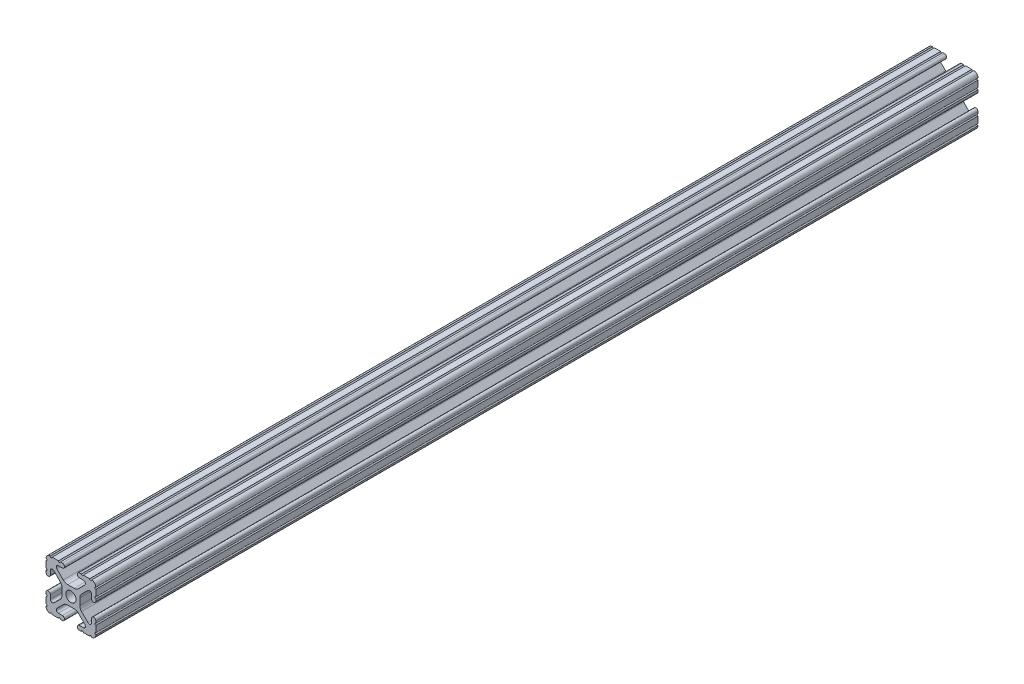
ISO-10303-21;
HEADER;
FILE_DESCRIPTION(('STEP AP214'),'2;1');
FILE_NAME('part.step','',(''),(''),'','','');
FILE_SCHEMA(('AUTOMOTIVE_DESIGN { 1 0 10303 214 1 1 1 1 }'));
ENDSEC;
DATA;
#1=APPLICATION_CONTEXT('core data for automotive mechanical design processes');
#2=APPLICATION_PROTOCOL_DEFINITION('international standard','automotive_design',2000,#1);
#3=PRODUCT_CONTEXT('',#1,'mechanical');
#4=PRODUCT('Part','Part','',(#3));
#5=PRODUCT_RELATED_PRODUCT_CATEGORY('part','',(#4));
#6=PRODUCT_DEFINITION_FORMATION('','',#4);
#7=PRODUCT_DEFINITION_CONTEXT('part definition',#1,'design');
#8=PRODUCT_DEFINITION('design','',#6,#7);
#9=PRODUCT_DEFINITION_SHAPE('','',#8);
#10=(LENGTH_UNIT() NAMED_UNIT(*) SI_UNIT(.MILLI.,.METRE.));
#11=(NAMED_UNIT(*) PLANE_ANGLE_UNIT() SI_UNIT($,.RADIAN.));
#12=(NAMED_UNIT(*) SI_UNIT($,.STERADIAN.) SOLID_ANGLE_UNIT());
#13=UNCERTAINTY_MEASURE_WITH_UNIT(LENGTH_MEASURE(1.E-05),#10,'distance_accuracy_value','');
#14=(GEOMETRIC_REPRESENTATION_CONTEXT(3) GLOBAL_UNCERTAINTY_ASSIGNED_CONTEXT((#13)) GLOBAL_UNIT_ASSIGNED_CONTEXT((#10,
#11,#12)) REPRESENTATION_CONTEXT('',''));
#15=CARTESIAN_POINT('',(0.,0.,0.));
#16=DIRECTION('',(0.,0.,1.));
#17=DIRECTION('',(1.,0.,0.));
#18=AXIS2_PLACEMENT_3D('',#15,#16,#17);
#19=CARTESIAN_POINT('',(10.5918,10.5918,-450.));
#20=DIRECTION('',(0.,0.,1.));
#21=DIRECTION('',(1.,0.,0.));
#22=AXIS2_PLACEMENT_3D('',#19,#20,#21);
#23=CYLINDRICAL_SURFACE('',#22,2.1082);
#24=CARTESIAN_POINT('',(10.5918,10.5918,0.));
#25=DIRECTION('',(0.,0.,1.));
#26=DIRECTION('',(1.,0.,0.));
#27=AXIS2_PLACEMENT_3D('',#24,#25,#26);
#28=CIRCLE('',#27,2.1082);
#29=CARTESIAN_POINT('',(12.7,10.5918,0.));
#30=VERTEX_POINT('',#29);
#31=CARTESIAN_POINT('',(10.5918,12.7,0.));
#32=VERTEX_POINT('',#31);
#33=EDGE_CURVE('E622',#30,#32,#28,.T.);
#34=ORIENTED_EDGE('',*,*,#33,.F.);
#35=DIRECTION('',(0.,0.,1.));
#36=VECTOR('',#35,1.);
#37=CARTESIAN_POINT('',(12.7,10.5918,-450.));
#38=LINE('',#37,#36);
#39=CARTESIAN_POINT('',(12.7,10.5918,-450.));
#40=VERTEX_POINT('',#39);
#41=EDGE_CURVE('E11',#40,#30,#38,.T.);
#42=ORIENTED_EDGE('',*,*,#41,.F.);
#43=CARTESIAN_POINT('',(10.5918,10.5918,-450.));
#44=DIRECTION('',(0.,0.,1.));
#45=DIRECTION('',(1.,0.,0.));
#46=AXIS2_PLACEMENT_3D('',#43,#44,#45);
#47=CIRCLE('',#46,2.1082);
#48=CARTESIAN_POINT('',(10.5918,12.7,-450.));
#49=VERTEX_POINT('',#48);
#50=EDGE_CURVE('E971',#40,#49,#47,.T.);
#51=ORIENTED_EDGE('',*,*,#50,.T.);
#52=DIRECTION('',(0.,0.,1.));
#53=VECTOR('',#52,1.);
#54=CARTESIAN_POINT('',(10.5918,12.7,-450.));
#55=LINE('',#54,#53);
#56=EDGE_CURVE('E42',#49,#32,#55,.T.);
#57=ORIENTED_EDGE('',*,*,#56,.T.);
#58=EDGE_LOOP('',(#34,#42,#51,#57));
#59=FACE_BOUND('',#58,.T.);
#60=ADVANCED_FACE('F39',(#59),#23,.T.);
#61=CARTESIAN_POINT('',(12.7,10.5664,-450.));
#62=DIRECTION('',(1.,0.,0.));
#63=DIRECTION('',(0.,0.,-1.));
#64=AXIS2_PLACEMENT_3D('',#61,#62,#63);
#65=PLANE('',#64);
#66=DIRECTION('',(0.,1.,0.));
#67=VECTOR('',#66,1.);
#68=CARTESIAN_POINT('',(12.7,10.5664,0.));
#69=LINE('',#68,#67);
#70=CARTESIAN_POINT('',(12.7,10.5664,0.));
#71=VERTEX_POINT('',#70);
#72=EDGE_CURVE('E968',#71,#30,#69,.T.);
#73=ORIENTED_EDGE('',*,*,#72,.F.);
#74=DIRECTION('',(0.,0.,1.));
#75=VECTOR('',#74,1.);
#76=CARTESIAN_POINT('',(12.7,10.5664,-450.));
#77=LINE('',#76,#75);
#78=CARTESIAN_POINT('',(12.7,10.5664,-450.));
#79=VERTEX_POINT('',#78);
#80=EDGE_CURVE('E49',#79,#71,#77,.T.);
#81=ORIENTED_EDGE('',*,*,#80,.F.);
#82=DIRECTION('',(0.,1.,0.));
#83=VECTOR('',#82,1.);
#84=CARTESIAN_POINT('',(12.7,10.5664,-450.));
#85=LINE('',#84,#83);
#86=EDGE_CURVE('E608',#79,#40,#85,.T.);
#87=ORIENTED_EDGE('',*,*,#86,.T.);
#88=ORIENTED_EDGE('',*,*,#41,.T.);
#89=EDGE_LOOP('',(#73,#81,#87,#88));
#90=FACE_BOUND('',#89,.T.);
#91=ADVANCED_FACE('F1229',(#90),#65,.T.);
#92=CARTESIAN_POINT('',(12.7,10.0584,-450.));
#93=DIRECTION('',(0.,0.,1.));
#94=DIRECTION('',(1.,0.,0.));
#95=AXIS2_PLACEMENT_3D('',#92,#93,#94);
#96=CYLINDRICAL_SURFACE('',#95,0.508000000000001);
#97=CARTESIAN_POINT('',(12.7,10.0584,0.));
#98=DIRECTION('',(0.,0.,-1.));
#99=DIRECTION('',(1.,0.,0.));
#100=AXIS2_PLACEMENT_3D('',#97,#98,#99);
#101=CIRCLE('',#100,0.508000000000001);
#102=CARTESIAN_POINT('',(12.7,9.55040000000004,0.));
#103=VERTEX_POINT('',#102);
#104=EDGE_CURVE('E594',#103,#71,#101,.T.);
#105=ORIENTED_EDGE('',*,*,#104,.F.);
#106=DIRECTION('',(0.,0.,1.));
#107=VECTOR('',#106,1.);
#108=CARTESIAN_POINT('',(12.7,9.55040000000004,-450.));
#109=LINE('',#108,#107);
#110=CARTESIAN_POINT('',(12.7,9.55040000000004,-450.));
#111=VERTEX_POINT('',#110);
#112=EDGE_CURVE('E589',#111,#103,#109,.T.);
#113=ORIENTED_EDGE('',*,*,#112,.F.);
#114=CARTESIAN_POINT('',(12.7,10.0584,-450.));
#115=DIRECTION('',(0.,0.,-1.));
#116=DIRECTION('',(1.,0.,0.));
#117=AXIS2_PLACEMENT_3D('',#114,#115,#116);
#118=CIRCLE('',#117,0.508000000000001);
#119=EDGE_CURVE('E592',#111,#79,#118,.T.);
#120=ORIENTED_EDGE('',*,*,#119,.T.);
#121=ORIENTED_EDGE('',*,*,#80,.T.);
#122=EDGE_LOOP('',(#105,#113,#120,#121));
#123=FACE_BOUND('',#122,.T.);
#124=ADVANCED_FACE('F591',(#123),#96,.F.);
#125=CARTESIAN_POINT('',(12.7,6.32460000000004,-450.));
#126=DIRECTION('',(1.,0.,0.));
#127=DIRECTION('',(0.,0.,-1.));
#128=AXIS2_PLACEMENT_3D('',#125,#126,#127);
#129=PLANE('',#128);
#130=DIRECTION('',(0.,1.,0.));
#131=VECTOR('',#130,1.);
#132=CARTESIAN_POINT('',(12.7,6.32460000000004,0.));
#133=LINE('',#132,#131);
#134=CARTESIAN_POINT('',(12.7,6.32460000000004,0.));
#135=VERTEX_POINT('',#134);
#136=EDGE_CURVE('E963',#135,#103,#133,.T.);
#137=ORIENTED_EDGE('',*,*,#136,.F.);
#138=DIRECTION('',(0.,0.,1.));
#139=VECTOR('',#138,1.);
#140=CARTESIAN_POINT('',(12.7,6.32460000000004,-450.));
#141=LINE('',#140,#139);
#142=CARTESIAN_POINT('',(12.7,6.32460000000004,-450.));
#143=VERTEX_POINT('',#142);
#144=EDGE_CURVE('E600',#143,#135,#141,.T.);
#145=ORIENTED_EDGE('',*,*,#144,.F.);
#146=DIRECTION('',(0.,1.,0.));
#147=VECTOR('',#146,1.);
#148=CARTESIAN_POINT('',(12.7,6.32460000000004,-450.));
#149=LINE('',#148,#147);
#150=EDGE_CURVE('E606',#143,#111,#149,.T.);
#151=ORIENTED_EDGE('',*,*,#150,.T.);
#152=ORIENTED_EDGE('',*,*,#112,.T.);
#153=EDGE_LOOP('',(#137,#145,#151,#152));
#154=FACE_BOUND('',#153,.T.);
#155=ADVANCED_FACE('F611',(#154),#129,.T.);
#156=CARTESIAN_POINT('',(12.7,5.81660000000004,-450.));
#157=DIRECTION('',(0.,0.,1.));
#158=DIRECTION('',(1.,0.,0.));
#159=AXIS2_PLACEMENT_3D('',#156,#157,#158);
#160=CYLINDRICAL_SURFACE('',#159,0.508);
#161=CARTESIAN_POINT('',(12.7,5.81660000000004,0.));
#162=DIRECTION('',(0.,0.,-1.));
#163=DIRECTION('',(1.,0.,0.));
#164=AXIS2_PLACEMENT_3D('',#161,#162,#163);
#165=CIRCLE('',#164,0.508);
#166=CARTESIAN_POINT('',(12.7,5.30860000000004,0.));
#167=VERTEX_POINT('',#166);
#168=EDGE_CURVE('E959',#167,#135,#165,.T.);
#169=ORIENTED_EDGE('',*,*,#168,.F.);
#170=DIRECTION('',(0.,0.,1.));
#171=VECTOR('',#170,1.);
#172=CARTESIAN_POINT('',(12.7,5.30860000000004,-450.));
#173=LINE('',#172,#171);
#174=CARTESIAN_POINT('',(12.7,5.30860000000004,-450.));
#175=VERTEX_POINT('',#174);
#176=EDGE_CURVE('E977',#175,#167,#173,.T.);
#177=ORIENTED_EDGE('',*,*,#176,.F.);
#178=CARTESIAN_POINT('',(12.7,5.81660000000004,-450.));
#179=DIRECTION('',(0.,0.,-1.));
#180=DIRECTION('',(1.,0.,0.));
#181=AXIS2_PLACEMENT_3D('',#178,#179,#180);
#182=CIRCLE('',#181,0.508);
#183=EDGE_CURVE('E613',#175,#143,#182,.T.);
#184=ORIENTED_EDGE('',*,*,#183,.T.);
#185=ORIENTED_EDGE('',*,*,#144,.T.);
#186=EDGE_LOOP('',(#169,#177,#184,#185));
#187=FACE_BOUND('',#186,.T.);
#188=ADVANCED_FACE('F1242',(#187),#160,.F.);
#189=CARTESIAN_POINT('',(12.7,4.35610000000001,-450.));
#190=DIRECTION('',(1.,0.,0.));
#191=DIRECTION('',(0.,1.,0.));
#192=AXIS2_PLACEMENT_3D('',#189,#190,#191);
#193=PLANE('',#192);
#194=DIRECTION('',(0.,1.,0.));
#195=VECTOR('',#194,1.);
#196=CARTESIAN_POINT('',(12.7,4.35610000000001,0.));
#197=LINE('',#196,#195);
#198=CARTESIAN_POINT('',(12.7,4.35610000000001,0.));
#199=VERTEX_POINT('',#198);
#200=EDGE_CURVE('E955',#199,#167,#197,.T.);
#201=ORIENTED_EDGE('',*,*,#200,.F.);
#202=DIRECTION('',(0.,0.,1.));
#203=VECTOR('',#202,1.);
#204=CARTESIAN_POINT('',(12.7,4.35610000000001,-450.));
#205=LINE('',#204,#203);
#206=CARTESIAN_POINT('',(12.7,4.35610000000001,-450.));
#207=VERTEX_POINT('',#206);
#208=EDGE_CURVE('E980',#207,#199,#205,.T.);
#209=ORIENTED_EDGE('',*,*,#208,.F.);
#210=DIRECTION('',(0.,1.,0.));
#211=VECTOR('',#210,1.);
#212=CARTESIAN_POINT('',(12.7,4.35610000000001,-450.));
#213=LINE('',#212,#211);
#214=EDGE_CURVE('E616',#207,#175,#213,.T.);
#215=ORIENTED_EDGE('',*,*,#214,.T.);
#216=ORIENTED_EDGE('',*,*,#176,.T.);
#217=EDGE_LOOP('',(#201,#209,#215,#216));
#218=FACE_BOUND('',#217,.T.);
#219=ADVANCED_FACE('F1245',(#218),#193,.T.);
#220=CARTESIAN_POINT('',(11.5951,4.35610000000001,-450.));
#221=DIRECTION('',(0.,0.,1.));
#222=DIRECTION('',(1.,0.,0.));
#223=AXIS2_PLACEMENT_3D('',#220,#221,#222);
#224=CYLINDRICAL_SURFACE('',#223,1.1049);
#225=CARTESIAN_POINT('',(11.5951,4.35610000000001,0.));
#226=DIRECTION('',(0.,0.,1.));
#227=DIRECTION('',(1.,0.,0.));
#228=AXIS2_PLACEMENT_3D('',#225,#226,#227);
#229=CIRCLE('',#228,1.1049);
#230=CARTESIAN_POINT('',(10.4902,4.35610000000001,0.));
#231=VERTEX_POINT('',#230);
#232=EDGE_CURVE('E951',#231,#199,#229,.T.);
#233=ORIENTED_EDGE('',*,*,#232,.F.);
#234=DIRECTION('',(0.,0.,1.));
#235=VECTOR('',#234,1.);
#236=CARTESIAN_POINT('',(10.4902,4.35610000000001,-450.));
#237=LINE('',#236,#235);
#238=CARTESIAN_POINT('',(10.4902,4.35610000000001,-450.));
#239=VERTEX_POINT('',#238);
#240=EDGE_CURVE('E983',#239,#231,#237,.T.);
#241=ORIENTED_EDGE('',*,*,#240,.F.);
#242=CARTESIAN_POINT('',(11.5951,4.35610000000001,-450.));
#243=DIRECTION('',(0.,0.,1.));
#244=DIRECTION('',(1.,0.,0.));
#245=AXIS2_PLACEMENT_3D('',#242,#243,#244);
#246=CIRCLE('',#245,1.1049);
#247=EDGE_CURVE('E1924',#239,#207,#246,.T.);
#248=ORIENTED_EDGE('',*,*,#247,.T.);
#249=ORIENTED_EDGE('',*,*,#208,.T.);
#250=EDGE_LOOP('',(#233,#241,#248,#249));
#251=FACE_BOUND('',#250,.T.);
#252=ADVANCED_FACE('F1249',(#251),#224,.T.);
#253=CARTESIAN_POINT('',(10.4902,6.37008378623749,-450.));
#254=DIRECTION('',(-1.,0.,0.));
#255=DIRECTION('',(0.,0.,1.));
#256=AXIS2_PLACEMENT_3D('',#253,#254,#255);
#257=PLANE('',#256);
#258=DIRECTION('',(0.,-1.,0.));
#259=VECTOR('',#258,1.);
#260=CARTESIAN_POINT('',(10.4902,6.37008378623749,0.));
#261=LINE('',#260,#259);
#262=CARTESIAN_POINT('',(10.4902,6.37008378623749,0.));
#263=VERTEX_POINT('',#262);
#264=EDGE_CURVE('E947',#263,#231,#261,.T.);
#265=ORIENTED_EDGE('',*,*,#264,.F.);
#266=DIRECTION('',(0.,0.,1.));
#267=VECTOR('',#266,1.);
#268=CARTESIAN_POINT('',(10.4902,6.37008378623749,-450.));
#269=LINE('',#268,#267);
#270=CARTESIAN_POINT('',(10.4902,6.37008378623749,-450.));
#271=VERTEX_POINT('',#270);
#272=EDGE_CURVE('E986',#271,#263,#269,.T.);
#273=ORIENTED_EDGE('',*,*,#272,.F.);
#274=DIRECTION('',(0.,-1.,0.));
#275=VECTOR('',#274,1.);
#276=CARTESIAN_POINT('',(10.4902,6.37008378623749,-450.));
#277=LINE('',#276,#275);
#278=EDGE_CURVE('E1920',#271,#239,#277,.T.);
#279=ORIENTED_EDGE('',*,*,#278,.T.);
#280=ORIENTED_EDGE('',*,*,#240,.T.);
#281=EDGE_LOOP('',(#265,#273,#279,#280));
#282=FACE_BOUND('',#281,.T.);
#283=ADVANCED_FACE('F1253',(#282),#257,.T.);
#284=CARTESIAN_POINT('',(9.4307837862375,6.37008378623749,-450.));
#285=DIRECTION('',(0.,0.,1.));
#286=DIRECTION('',(1.,0.,0.));
#287=AXIS2_PLACEMENT_3D('',#284,#285,#286);
#288=CYLINDRICAL_SURFACE('',#287,1.0594162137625);
#289=CARTESIAN_POINT('',(9.4307837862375,6.37008378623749,0.));
#290=DIRECTION('',(0.,0.,-1.));
#291=DIRECTION('',(1.,0.,0.));
#292=AXIS2_PLACEMENT_3D('',#289,#290,#291);
#293=CIRCLE('',#292,1.0594162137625);
#294=CARTESIAN_POINT('',(8.68166339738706,7.11920417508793,0.));
#295=VERTEX_POINT('',#294);
#296=EDGE_CURVE('E943',#295,#263,#293,.T.);
#297=ORIENTED_EDGE('',*,*,#296,.F.);
#298=DIRECTION('',(0.,0.,1.));
#299=VECTOR('',#298,1.);
#300=CARTESIAN_POINT('',(8.68166339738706,7.11920417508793,-450.));
#301=LINE('',#300,#299);
#302=CARTESIAN_POINT('',(8.68166339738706,7.11920417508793,-450.));
#303=VERTEX_POINT('',#302);
#304=EDGE_CURVE('E989',#303,#295,#301,.T.);
#305=ORIENTED_EDGE('',*,*,#304,.F.);
#306=CARTESIAN_POINT('',(9.4307837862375,6.37008378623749,-450.));
#307=DIRECTION('',(0.,0.,-1.));
#308=DIRECTION('',(1.,0.,0.));
#309=AXIS2_PLACEMENT_3D('',#306,#307,#308);
#310=CIRCLE('',#309,1.0594162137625);
#311=EDGE_CURVE('E1916',#303,#271,#310,.T.);
#312=ORIENTED_EDGE('',*,*,#311,.T.);
#313=ORIENTED_EDGE('',*,*,#272,.T.);
#314=EDGE_LOOP('',(#297,#305,#312,#313));
#315=FACE_BOUND('',#314,.T.);
#316=ADVANCED_FACE('F1257',(#315),#288,.F.);
#317=CARTESIAN_POINT('',(5.44710311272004,3.88464389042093,-450.));
#318=DIRECTION('',(0.707106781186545,-0.70710678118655,0.));
#319=DIRECTION('',(0.70710678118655,0.707106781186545,0.));
#320=AXIS2_PLACEMENT_3D('',#317,#318,#319);
#321=PLANE('',#320);
#322=DIRECTION('',(0.70710678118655,0.707106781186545,0.));
#323=VECTOR('',#322,1.);
#324=CARTESIAN_POINT('',(5.44710311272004,3.88464389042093,0.));
#325=LINE('',#324,#323);
#326=CARTESIAN_POINT('',(5.44710311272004,3.88464389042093,0.));
#327=VERTEX_POINT('',#326);
#328=EDGE_CURVE('E939',#327,#295,#325,.T.);
#329=ORIENTED_EDGE('',*,*,#328,.F.);
#330=DIRECTION('',(0.,0.,1.));
#331=VECTOR('',#330,1.);
#332=CARTESIAN_POINT('',(5.44710311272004,3.88464389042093,-450.));
#333=LINE('',#332,#331);
#334=CARTESIAN_POINT('',(5.44710311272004,3.88464389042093,-450.));
#335=VERTEX_POINT('',#334);
#336=EDGE_CURVE('E992',#335,#327,#333,.T.);
#337=ORIENTED_EDGE('',*,*,#336,.F.);
#338=DIRECTION('',(0.70710678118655,0.707106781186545,0.));
#339=VECTOR('',#338,1.);
#340=CARTESIAN_POINT('',(5.44710311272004,3.88464389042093,-450.));
#341=LINE('',#340,#339);
#342=EDGE_CURVE('E1912',#335,#303,#341,.T.);
#343=ORIENTED_EDGE('',*,*,#342,.T.);
#344=ORIENTED_EDGE('',*,*,#304,.T.);
#345=EDGE_LOOP('',(#329,#337,#343,#344));
#346=FACE_BOUND('',#345,.T.);
#347=ADVANCED_FACE('F1261',(#346),#321,.T.);
#348=CARTESIAN_POINT('',(7.69216714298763,1.63957986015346,-450.));
#349=DIRECTION('',(0.,0.,1.));
#350=DIRECTION('',(1.,0.,0.));
#351=AXIS2_PLACEMENT_3D('',#348,#349,#350);
#352=CYLINDRICAL_SURFACE('',#351,3.17500000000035);
#353=CARTESIAN_POINT('',(7.69216714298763,1.63957986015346,0.));
#354=DIRECTION('',(0.,0.,-1.));
#355=DIRECTION('',(1.,0.,0.));
#356=AXIS2_PLACEMENT_3D('',#353,#354,#355);
#357=CIRCLE('',#356,3.17500000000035);
#358=CARTESIAN_POINT('',(4.51716714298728,1.63957986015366,0.));
#359=VERTEX_POINT('',#358);
#360=EDGE_CURVE('E935',#359,#327,#357,.T.);
#361=ORIENTED_EDGE('',*,*,#360,.F.);
#362=DIRECTION('',(0.,0.,1.));
#363=VECTOR('',#362,1.);
#364=CARTESIAN_POINT('',(4.51716714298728,1.63957986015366,-450.));
#365=LINE('',#364,#363);
#366=CARTESIAN_POINT('',(4.51716714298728,1.63957986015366,-450.));
#367=VERTEX_POINT('',#366);
#368=EDGE_CURVE('E995',#367,#359,#365,.T.);
#369=ORIENTED_EDGE('',*,*,#368,.F.);
#370=CARTESIAN_POINT('',(7.69216714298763,1.63957986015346,-450.));
#371=DIRECTION('',(0.,0.,-1.));
#372=DIRECTION('',(1.,0.,0.));
#373=AXIS2_PLACEMENT_3D('',#370,#371,#372);
#374=CIRCLE('',#373,3.17500000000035);
#375=EDGE_CURVE('E1908',#367,#335,#374,.T.);
#376=ORIENTED_EDGE('',*,*,#375,.T.);
#377=ORIENTED_EDGE('',*,*,#336,.T.);
#378=EDGE_LOOP('',(#361,#369,#376,#377));
#379=FACE_BOUND('',#378,.T.);
#380=ADVANCED_FACE('F1265',(#379),#352,.F.);
#381=CARTESIAN_POINT('',(4.51716714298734,-1.63957986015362,-450.));
#382=DIRECTION('',(1.,0.,0.));
#383=DIRECTION('',(0.,1.,0.));
#384=AXIS2_PLACEMENT_3D('',#381,#382,#383);
#385=PLANE('',#384);
#386=DIRECTION('',(0.,1.,0.));
#387=VECTOR('',#386,1.);
#388=CARTESIAN_POINT('',(4.51716714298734,-1.63957986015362,0.));
#389=LINE('',#388,#387);
#390=CARTESIAN_POINT('',(4.51716714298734,-1.63957986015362,0.));
#391=VERTEX_POINT('',#390);
#392=EDGE_CURVE('E931',#391,#359,#389,.T.);
#393=ORIENTED_EDGE('',*,*,#392,.F.);
#394=DIRECTION('',(0.,0.,1.));
#395=VECTOR('',#394,1.);
#396=CARTESIAN_POINT('',(4.51716714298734,-1.63957986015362,-450.));
#397=LINE('',#396,#395);
#398=CARTESIAN_POINT('',(4.51716714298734,-1.63957986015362,-450.));
#399=VERTEX_POINT('',#398);
#400=EDGE_CURVE('E998',#399,#391,#397,.T.);
#401=ORIENTED_EDGE('',*,*,#400,.F.);
#402=DIRECTION('',(0.,1.,0.));
#403=VECTOR('',#402,1.);
#404=CARTESIAN_POINT('',(4.51716714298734,-1.63957986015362,-450.));
#405=LINE('',#404,#403);
#406=EDGE_CURVE('E1904',#399,#367,#405,.T.);
#407=ORIENTED_EDGE('',*,*,#406,.T.);
#408=ORIENTED_EDGE('',*,*,#368,.T.);
#409=EDGE_LOOP('',(#393,#401,#407,#408));
#410=FACE_BOUND('',#409,.T.);
#411=ADVANCED_FACE('F1269',(#410),#385,.T.);
#412=CARTESIAN_POINT('',(7.6921671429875,-1.63957986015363,-450.));
#413=DIRECTION('',(0.,0.,1.));
#414=DIRECTION('',(1.,0.,0.));
#415=AXIS2_PLACEMENT_3D('',#412,#413,#414);
#416=CYLINDRICAL_SURFACE('',#415,3.17500000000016);
#417=CARTESIAN_POINT('',(7.6921671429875,-1.63957986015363,0.));
#418=DIRECTION('',(0.,0.,-1.));
#419=DIRECTION('',(1.,0.,0.));
#420=AXIS2_PLACEMENT_3D('',#417,#418,#419);
#421=CIRCLE('',#420,3.17500000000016);
#422=CARTESIAN_POINT('',(5.44710311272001,-3.88464389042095,0.));
#423=VERTEX_POINT('',#422);
#424=EDGE_CURVE('E927',#423,#391,#421,.T.);
#425=ORIENTED_EDGE('',*,*,#424,.F.);
#426=DIRECTION('',(0.,0.,1.));
#427=VECTOR('',#426,1.);
#428=CARTESIAN_POINT('',(5.44710311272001,-3.88464389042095,-450.));
#429=LINE('',#428,#427);
#430=CARTESIAN_POINT('',(5.44710311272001,-3.88464389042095,-450.));
#431=VERTEX_POINT('',#430);
#432=EDGE_CURVE('E1001',#431,#423,#429,.T.);
#433=ORIENTED_EDGE('',*,*,#432,.F.);
#434=CARTESIAN_POINT('',(7.6921671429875,-1.63957986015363,-450.));
#435=DIRECTION('',(0.,0.,-1.));
#436=DIRECTION('',(1.,0.,0.));
#437=AXIS2_PLACEMENT_3D('',#434,#435,#436);
#438=CIRCLE('',#437,3.17500000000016);
#439=EDGE_CURVE('E1900',#431,#399,#438,.T.);
#440=ORIENTED_EDGE('',*,*,#439,.T.);
#441=ORIENTED_EDGE('',*,*,#400,.T.);
#442=EDGE_LOOP('',(#425,#433,#440,#441));
#443=FACE_BOUND('',#442,.T.);
#444=ADVANCED_FACE('F1273',(#443),#416,.F.);
#445=CARTESIAN_POINT('',(8.68166339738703,-7.11920417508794,-450.));
#446=DIRECTION('',(0.707106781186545,0.70710678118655,0.));
#447=DIRECTION('',(-0.70710678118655,0.707106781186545,0.));
#448=AXIS2_PLACEMENT_3D('',#445,#446,#447);
#449=PLANE('',#448);
#450=DIRECTION('',(-0.70710678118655,0.707106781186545,0.));
#451=VECTOR('',#450,1.);
#452=CARTESIAN_POINT('',(8.68166339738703,-7.11920417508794,0.));
#453=LINE('',#452,#451);
#454=CARTESIAN_POINT('',(8.68166339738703,-7.11920417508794,0.));
#455=VERTEX_POINT('',#454);
#456=EDGE_CURVE('E923',#455,#423,#453,.T.);
#457=ORIENTED_EDGE('',*,*,#456,.F.);
#458=DIRECTION('',(0.,0.,1.));
#459=VECTOR('',#458,1.);
#460=CARTESIAN_POINT('',(8.68166339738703,-7.11920417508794,-450.));
#461=LINE('',#460,#459);
#462=CARTESIAN_POINT('',(8.68166339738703,-7.11920417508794,-450.));
#463=VERTEX_POINT('',#462);
#464=EDGE_CURVE('E1004',#463,#455,#461,.T.);
#465=ORIENTED_EDGE('',*,*,#464,.F.);
#466=DIRECTION('',(-0.70710678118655,0.707106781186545,0.));
#467=VECTOR('',#466,1.);
#468=CARTESIAN_POINT('',(8.68166339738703,-7.11920417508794,-450.));
#469=LINE('',#468,#467);
#470=EDGE_CURVE('E1896',#463,#431,#469,.T.);
#471=ORIENTED_EDGE('',*,*,#470,.T.);
#472=ORIENTED_EDGE('',*,*,#432,.T.);
#473=EDGE_LOOP('',(#457,#465,#471,#472));
#474=FACE_BOUND('',#473,.T.);
#475=ADVANCED_FACE('F1277',(#474),#449,.T.);
#476=CARTESIAN_POINT('',(9.43078378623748,-6.37008378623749,-450.));
#477=DIRECTION('',(0.,0.,1.));
#478=DIRECTION('',(1.,0.,0.));
#479=AXIS2_PLACEMENT_3D('',#476,#477,#478);
#480=CYLINDRICAL_SURFACE('',#479,1.05941621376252);
#481=CARTESIAN_POINT('',(9.43078378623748,-6.37008378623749,0.));
#482=DIRECTION('',(0.,0.,-1.));
#483=DIRECTION('',(1.,0.,0.));
#484=AXIS2_PLACEMENT_3D('',#481,#482,#483);
#485=CIRCLE('',#484,1.05941621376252);
#486=CARTESIAN_POINT('',(10.4902,-6.37008378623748,0.));
#487=VERTEX_POINT('',#486);
#488=EDGE_CURVE('E919',#487,#455,#485,.T.);
#489=ORIENTED_EDGE('',*,*,#488,.F.);
#490=DIRECTION('',(0.,0.,1.));
#491=VECTOR('',#490,1.);
#492=CARTESIAN_POINT('',(10.4902,-6.37008378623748,-450.));
#493=LINE('',#492,#491);
#494=CARTESIAN_POINT('',(10.4902,-6.37008378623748,-450.));
#495=VERTEX_POINT('',#494);
#496=EDGE_CURVE('E1007',#495,#487,#493,.T.);
#497=ORIENTED_EDGE('',*,*,#496,.F.);
#498=CARTESIAN_POINT('',(9.43078378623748,-6.37008378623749,-450.));
#499=DIRECTION('',(0.,0.,-1.));
#500=DIRECTION('',(1.,0.,0.));
#501=AXIS2_PLACEMENT_3D('',#498,#499,#500);
#502=CIRCLE('',#501,1.05941621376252);
#503=EDGE_CURVE('E1892',#495,#463,#502,.T.);
#504=ORIENTED_EDGE('',*,*,#503,.T.);
#505=ORIENTED_EDGE('',*,*,#464,.T.);
#506=EDGE_LOOP('',(#489,#497,#504,#505));
#507=FACE_BOUND('',#506,.T.);
#508=ADVANCED_FACE('F1281',(#507),#480,.F.);
#509=CARTESIAN_POINT('',(10.4902,-4.3561,-450.));
#510=DIRECTION('',(-1.,0.,0.));
#511=DIRECTION('',(0.,-1.,0.));
#512=AXIS2_PLACEMENT_3D('',#509,#510,#511);
#513=PLANE('',#512);
#514=DIRECTION('',(0.,-1.,0.));
#515=VECTOR('',#514,1.);
#516=CARTESIAN_POINT('',(10.4902,-4.3561,0.));
#517=LINE('',#516,#515);
#518=CARTESIAN_POINT('',(10.4902,-4.3561,0.));
#519=VERTEX_POINT('',#518);
#520=EDGE_CURVE('E915',#519,#487,#517,.T.);
#521=ORIENTED_EDGE('',*,*,#520,.F.);
#522=DIRECTION('',(0.,0.,1.));
#523=VECTOR('',#522,1.);
#524=CARTESIAN_POINT('',(10.4902,-4.3561,-450.));
#525=LINE('',#524,#523);
#526=CARTESIAN_POINT('',(10.4902,-4.3561,-450.));
#527=VERTEX_POINT('',#526);
#528=EDGE_CURVE('E1010',#527,#519,#525,.T.);
#529=ORIENTED_EDGE('',*,*,#528,.F.);
#530=DIRECTION('',(0.,-1.,0.));
#531=VECTOR('',#530,1.);
#532=CARTESIAN_POINT('',(10.4902,-4.3561,-450.));
#533=LINE('',#532,#531);
#534=EDGE_CURVE('E1888',#527,#495,#533,.T.);
#535=ORIENTED_EDGE('',*,*,#534,.T.);
#536=ORIENTED_EDGE('',*,*,#496,.T.);
#537=EDGE_LOOP('',(#521,#529,#535,#536));
#538=FACE_BOUND('',#537,.T.);
#539=ADVANCED_FACE('F1285',(#538),#513,.T.);
#540=CARTESIAN_POINT('',(11.5951,-4.3561,-450.));
#541=DIRECTION('',(0.,0.,1.));
#542=DIRECTION('',(1.,0.,0.));
#543=AXIS2_PLACEMENT_3D('',#540,#541,#542);
#544=CYLINDRICAL_SURFACE('',#543,1.1049);
#545=CARTESIAN_POINT('',(11.5951,-4.3561,0.));
#546=DIRECTION('',(0.,0.,1.));
#547=DIRECTION('',(1.,0.,0.));
#548=AXIS2_PLACEMENT_3D('',#545,#546,#547);
#549=CIRCLE('',#548,1.1049);
#550=CARTESIAN_POINT('',(12.7,-4.3561,0.));
#551=VERTEX_POINT('',#550);
#552=EDGE_CURVE('E911',#551,#519,#549,.T.);
#553=ORIENTED_EDGE('',*,*,#552,.F.);
#554=DIRECTION('',(0.,0.,1.));
#555=VECTOR('',#554,1.);
#556=CARTESIAN_POINT('',(12.7,-4.3561,-450.));
#557=LINE('',#556,#555);
#558=CARTESIAN_POINT('',(12.7,-4.3561,-450.));
#559=VERTEX_POINT('',#558);
#560=EDGE_CURVE('E1013',#559,#551,#557,.T.);
#561=ORIENTED_EDGE('',*,*,#560,.F.);
#562=CARTESIAN_POINT('',(11.5951,-4.3561,-450.));
#563=DIRECTION('',(0.,0.,1.));
#564=DIRECTION('',(1.,0.,0.));
#565=AXIS2_PLACEMENT_3D('',#562,#563,#564);
#566=CIRCLE('',#565,1.1049);
#567=EDGE_CURVE('E1884',#559,#527,#566,.T.);
#568=ORIENTED_EDGE('',*,*,#567,.T.);
#569=ORIENTED_EDGE('',*,*,#528,.T.);
#570=EDGE_LOOP('',(#553,#561,#568,#569));
#571=FACE_BOUND('',#570,.T.);
#572=ADVANCED_FACE('F1289',(#571),#544,.T.);
#573=CARTESIAN_POINT('',(12.7,-5.30860000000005,-450.));
#574=DIRECTION('',(1.,0.,0.));
#575=DIRECTION('',(0.,1.,0.));
#576=AXIS2_PLACEMENT_3D('',#573,#574,#575);
#577=PLANE('',#576);
#578=DIRECTION('',(0.,1.,0.));
#579=VECTOR('',#578,1.);
#580=CARTESIAN_POINT('',(12.7,-5.30860000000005,0.));
#581=LINE('',#580,#579);
#582=CARTESIAN_POINT('',(12.7,-5.30860000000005,0.));
#583=VERTEX_POINT('',#582);
#584=EDGE_CURVE('E907',#583,#551,#581,.T.);
#585=ORIENTED_EDGE('',*,*,#584,.F.);
#586=DIRECTION('',(0.,0.,1.));
#587=VECTOR('',#586,1.);
#588=CARTESIAN_POINT('',(12.7,-5.30860000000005,-450.));
#589=LINE('',#588,#587);
#590=CARTESIAN_POINT('',(12.7,-5.30860000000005,-450.));
#591=VERTEX_POINT('',#590);
#592=EDGE_CURVE('E1016',#591,#583,#589,.T.);
#593=ORIENTED_EDGE('',*,*,#592,.F.);
#594=DIRECTION('',(0.,1.,0.));
#595=VECTOR('',#594,1.);
#596=CARTESIAN_POINT('',(12.7,-5.30860000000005,-450.));
#597=LINE('',#596,#595);
#598=EDGE_CURVE('E1880',#591,#559,#597,.T.);
#599=ORIENTED_EDGE('',*,*,#598,.T.);
#600=ORIENTED_EDGE('',*,*,#560,.T.);
#601=EDGE_LOOP('',(#585,#593,#599,#600));
#602=FACE_BOUND('',#601,.T.);
#603=ADVANCED_FACE('F1293',(#602),#577,.T.);
#604=CARTESIAN_POINT('',(12.7,-5.81660000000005,-450.));
#605=DIRECTION('',(0.,0.,1.));
#606=DIRECTION('',(1.,0.,0.));
#607=AXIS2_PLACEMENT_3D('',#604,#605,#606);
#608=CYLINDRICAL_SURFACE('',#607,0.508000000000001);
#609=CARTESIAN_POINT('',(12.7,-5.81660000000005,0.));
#610=DIRECTION('',(0.,0.,-1.));
#611=DIRECTION('',(1.,0.,0.));
#612=AXIS2_PLACEMENT_3D('',#609,#610,#611);
#613=CIRCLE('',#612,0.508000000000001);
#614=CARTESIAN_POINT('',(12.7,-6.32460000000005,0.));
#615=VERTEX_POINT('',#614);
#616=EDGE_CURVE('E903',#615,#583,#613,.T.);
#617=ORIENTED_EDGE('',*,*,#616,.F.);
#618=DIRECTION('',(0.,0.,1.));
#619=VECTOR('',#618,1.);
#620=CARTESIAN_POINT('',(12.7,-6.32460000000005,-450.));
#621=LINE('',#620,#619);
#622=CARTESIAN_POINT('',(12.7,-6.32460000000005,-450.));
#623=VERTEX_POINT('',#622);
#624=EDGE_CURVE('E1019',#623,#615,#621,.T.);
#625=ORIENTED_EDGE('',*,*,#624,.F.);
#626=CARTESIAN_POINT('',(12.7,-5.81660000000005,-450.));
#627=DIRECTION('',(0.,0.,-1.));
#628=DIRECTION('',(1.,0.,0.));
#629=AXIS2_PLACEMENT_3D('',#626,#627,#628);
#630=CIRCLE('',#629,0.508000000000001);
#631=EDGE_CURVE('E1876',#623,#591,#630,.T.);
#632=ORIENTED_EDGE('',*,*,#631,.T.);
#633=ORIENTED_EDGE('',*,*,#592,.T.);
#634=EDGE_LOOP('',(#617,#625,#632,#633));
#635=FACE_BOUND('',#634,.T.);
#636=ADVANCED_FACE('F1297',(#635),#608,.F.);
#637=CARTESIAN_POINT('',(12.7,-9.55040000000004,-450.));
#638=DIRECTION('',(1.,0.,0.));
#639=DIRECTION('',(0.,0.,-1.));
#640=AXIS2_PLACEMENT_3D('',#637,#638,#639);
#641=PLANE('',#640);
#642=DIRECTION('',(0.,1.,0.));
#643=VECTOR('',#642,1.);
#644=CARTESIAN_POINT('',(12.7,-9.55040000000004,0.));
#645=LINE('',#644,#643);
#646=CARTESIAN_POINT('',(12.7,-9.55040000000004,0.));
#647=VERTEX_POINT('',#646);
#648=EDGE_CURVE('E899',#647,#615,#645,.T.);
#649=ORIENTED_EDGE('',*,*,#648,.F.);
#650=DIRECTION('',(0.,0.,1.));
#651=VECTOR('',#650,1.);
#652=CARTESIAN_POINT('',(12.7,-9.55040000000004,-450.));
#653=LINE('',#652,#651);
#654=CARTESIAN_POINT('',(12.7,-9.55040000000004,-450.));
#655=VERTEX_POINT('',#654);
#656=EDGE_CURVE('E1022',#655,#647,#653,.T.);
#657=ORIENTED_EDGE('',*,*,#656,.F.);
#658=DIRECTION('',(0.,1.,0.));
#659=VECTOR('',#658,1.);
#660=CARTESIAN_POINT('',(12.7,-9.55040000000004,-450.));
#661=LINE('',#660,#659);
#662=EDGE_CURVE('E1872',#655,#623,#661,.T.);
#663=ORIENTED_EDGE('',*,*,#662,.T.);
#664=ORIENTED_EDGE('',*,*,#624,.T.);
#665=EDGE_LOOP('',(#649,#657,#663,#664));
#666=FACE_BOUND('',#665,.T.);
#667=ADVANCED_FACE('F1301',(#666),#641,.T.);
#668=CARTESIAN_POINT('',(12.7,-10.0584,-450.));
#669=DIRECTION('',(0.,0.,1.));
#670=DIRECTION('',(1.,0.,0.));
#671=AXIS2_PLACEMENT_3D('',#668,#669,#670);
#672=CYLINDRICAL_SURFACE('',#671,0.508);
#673=CARTESIAN_POINT('',(12.7,-10.0584,0.));
#674=DIRECTION('',(0.,0.,-1.));
#675=DIRECTION('',(1.,0.,0.));
#676=AXIS2_PLACEMENT_3D('',#673,#674,#675);
#677=CIRCLE('',#676,0.508);
#678=CARTESIAN_POINT('',(12.7,-10.5664,0.));
#679=VERTEX_POINT('',#678);
#680=EDGE_CURVE('E895',#679,#647,#677,.T.);
#681=ORIENTED_EDGE('',*,*,#680,.F.);
#682=DIRECTION('',(0.,0.,1.));
#683=VECTOR('',#682,1.);
#684=CARTESIAN_POINT('',(12.7,-10.5664,-450.));
#685=LINE('',#684,#683);
#686=CARTESIAN_POINT('',(12.7,-10.5664,-450.));
#687=VERTEX_POINT('',#686);
#688=EDGE_CURVE('E1025',#687,#679,#685,.T.);
#689=ORIENTED_EDGE('',*,*,#688,.F.);
#690=CARTESIAN_POINT('',(12.7,-10.0584,-450.));
#691=DIRECTION('',(0.,0.,-1.));
#692=DIRECTION('',(1.,0.,0.));
#693=AXIS2_PLACEMENT_3D('',#690,#691,#692);
#694=CIRCLE('',#693,0.508);
#695=EDGE_CURVE('E1868',#687,#655,#694,.T.);
#696=ORIENTED_EDGE('',*,*,#695,.T.);
#697=ORIENTED_EDGE('',*,*,#656,.T.);
#698=EDGE_LOOP('',(#681,#689,#696,#697));
#699=FACE_BOUND('',#698,.T.);
#700=ADVANCED_FACE('F1305',(#699),#672,.F.);
#701=CARTESIAN_POINT('',(12.7,-10.5918,-450.));
#702=DIRECTION('',(1.,0.,0.));
#703=DIRECTION('',(0.,0.,-1.));
#704=AXIS2_PLACEMENT_3D('',#701,#702,#703);
#705=PLANE('',#704);
#706=DIRECTION('',(0.,1.,0.));
#707=VECTOR('',#706,1.);
#708=CARTESIAN_POINT('',(12.7,-10.5918,0.));
#709=LINE('',#708,#707);
#710=CARTESIAN_POINT('',(12.7,-10.5918,0.));
#711=VERTEX_POINT('',#710);
#712=EDGE_CURVE('E891',#711,#679,#709,.T.);
#713=ORIENTED_EDGE('',*,*,#712,.F.);
#714=DIRECTION('',(0.,0.,1.));
#715=VECTOR('',#714,1.);
#716=CARTESIAN_POINT('',(12.7,-10.5918,-450.));
#717=LINE('',#716,#715);
#718=CARTESIAN_POINT('',(12.7,-10.5918,-450.));
#719=VERTEX_POINT('',#718);
#720=EDGE_CURVE('E1028',#719,#711,#717,.T.);
#721=ORIENTED_EDGE('',*,*,#720,.F.);
#722=DIRECTION('',(0.,1.,0.));
#723=VECTOR('',#722,1.);
#724=CARTESIAN_POINT('',(12.7,-10.5918,-450.));
#725=LINE('',#724,#723);
#726=EDGE_CURVE('E1864',#719,#687,#725,.T.);
#727=ORIENTED_EDGE('',*,*,#726,.T.);
#728=ORIENTED_EDGE('',*,*,#688,.T.);
#729=EDGE_LOOP('',(#713,#721,#727,#728));
#730=FACE_BOUND('',#729,.T.);
#731=ADVANCED_FACE('F1309',(#730),#705,.T.);
#732=CARTESIAN_POINT('',(10.5918,-10.5918,-450.));
#733=DIRECTION('',(0.,0.,1.));
#734=DIRECTION('',(1.,0.,0.));
#735=AXIS2_PLACEMENT_3D('',#732,#733,#734);
#736=CYLINDRICAL_SURFACE('',#735,2.1082);
#737=CARTESIAN_POINT('',(10.5918,-10.5918,0.));
#738=DIRECTION('',(0.,0.,1.));
#739=DIRECTION('',(1.,0.,0.));
#740=AXIS2_PLACEMENT_3D('',#737,#738,#739);
#741=CIRCLE('',#740,2.1082);
#742=CARTESIAN_POINT('',(10.5918,-12.7,0.));
#743=VERTEX_POINT('',#742);
#744=EDGE_CURVE('E887',#743,#711,#741,.T.);
#745=ORIENTED_EDGE('',*,*,#744,.F.);
#746=DIRECTION('',(0.,0.,1.));
#747=VECTOR('',#746,1.);
#748=CARTESIAN_POINT('',(10.5918,-12.7,-450.));
#749=LINE('',#748,#747);
#750=CARTESIAN_POINT('',(10.5918,-12.7,-450.));
#751=VERTEX_POINT('',#750);
#752=EDGE_CURVE('E1031',#751,#743,#749,.T.);
#753=ORIENTED_EDGE('',*,*,#752,.F.);
#754=CARTESIAN_POINT('',(10.5918,-10.5918,-450.));
#755=DIRECTION('',(0.,0.,1.));
#756=DIRECTION('',(1.,0.,0.));
#757=AXIS2_PLACEMENT_3D('',#754,#755,#756);
#758=CIRCLE('',#757,2.1082);
#759=EDGE_CURVE('E1860',#751,#719,#758,.T.);
#760=ORIENTED_EDGE('',*,*,#759,.T.);
#761=ORIENTED_EDGE('',*,*,#720,.T.);
#762=EDGE_LOOP('',(#745,#753,#760,#761));
#763=FACE_BOUND('',#762,.T.);
#764=ADVANCED_FACE('F1313',(#763),#736,.T.);
#765=CARTESIAN_POINT('',(10.5664,-12.7,-450.));
#766=DIRECTION('',(6.14665798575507E-13,-1.,0.));
#767=DIRECTION('',(1.,6.14665798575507E-13,0.));
#768=AXIS2_PLACEMENT_3D('',#765,#766,#767);
#769=PLANE('',#768);
#770=DIRECTION('',(1.,6.14665798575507E-13,0.));
#771=VECTOR('',#770,1.);
#772=CARTESIAN_POINT('',(10.5664,-12.7,0.));
#773=LINE('',#772,#771);
#774=CARTESIAN_POINT('',(10.5664,-12.7,0.));
#775=VERTEX_POINT('',#774);
#776=EDGE_CURVE('E883',#775,#743,#773,.T.);
#777=ORIENTED_EDGE('',*,*,#776,.F.);
#778=DIRECTION('',(0.,0.,1.));
#779=VECTOR('',#778,1.);
#780=CARTESIAN_POINT('',(10.5664,-12.7,-450.));
#781=LINE('',#780,#779);
#782=CARTESIAN_POINT('',(10.5664,-12.7,-450.));
#783=VERTEX_POINT('',#782);
#784=EDGE_CURVE('E1034',#783,#775,#781,.T.);
#785=ORIENTED_EDGE('',*,*,#784,.F.);
#786=DIRECTION('',(1.,6.14665798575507E-13,0.));
#787=VECTOR('',#786,1.);
#788=CARTESIAN_POINT('',(10.5664,-12.7,-450.));
#789=LINE('',#788,#787);
#790=EDGE_CURVE('E1856',#783,#751,#789,.T.);
#791=ORIENTED_EDGE('',*,*,#790,.T.);
#792=ORIENTED_EDGE('',*,*,#752,.T.);
#793=EDGE_LOOP('',(#777,#785,#791,#792));
#794=FACE_BOUND('',#793,.T.);
#795=ADVANCED_FACE('F1317',(#794),#769,.T.);
#796=CARTESIAN_POINT('',(10.0584,-12.7,-450.));
#797=DIRECTION('',(0.,0.,1.));
#798=DIRECTION('',(1.,0.,0.));
#799=AXIS2_PLACEMENT_3D('',#796,#797,#798);
#800=CYLINDRICAL_SURFACE('',#799,0.508000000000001);
#801=CARTESIAN_POINT('',(10.0584,-12.7,0.));
#802=DIRECTION('',(0.,0.,-1.));
#803=DIRECTION('',(1.,0.,0.));
#804=AXIS2_PLACEMENT_3D('',#801,#802,#803);
#805=CIRCLE('',#804,0.508000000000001);
#806=CARTESIAN_POINT('',(9.55040000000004,-12.7,0.));
#807=VERTEX_POINT('',#806);
#808=EDGE_CURVE('E879',#807,#775,#805,.T.);
#809=ORIENTED_EDGE('',*,*,#808,.F.);
#810=DIRECTION('',(0.,0.,1.));
#811=VECTOR('',#810,1.);
#812=CARTESIAN_POINT('',(9.55040000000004,-12.7,-450.));
#813=LINE('',#812,#811);
#814=CARTESIAN_POINT('',(9.55040000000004,-12.7,-450.));
#815=VERTEX_POINT('',#814);
#816=EDGE_CURVE('E1037',#815,#807,#813,.T.);
#817=ORIENTED_EDGE('',*,*,#816,.F.);
#818=CARTESIAN_POINT('',(10.0584,-12.7,-450.));
#819=DIRECTION('',(0.,0.,-1.));
#820=DIRECTION('',(1.,0.,0.));
#821=AXIS2_PLACEMENT_3D('',#818,#819,#820);
#822=CIRCLE('',#821,0.508000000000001);
#823=EDGE_CURVE('E1852',#815,#783,#822,.T.);
#824=ORIENTED_EDGE('',*,*,#823,.T.);
#825=ORIENTED_EDGE('',*,*,#784,.T.);
#826=EDGE_LOOP('',(#809,#817,#824,#825));
#827=FACE_BOUND('',#826,.T.);
#828=ADVANCED_FACE('F1321',(#827),#800,.F.);
#829=CARTESIAN_POINT('',(6.32460000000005,-12.7,-450.));
#830=DIRECTION('',(0.,-1.,0.));
#831=DIRECTION('',(0.,0.,-1.));
#832=AXIS2_PLACEMENT_3D('',#829,#830,#831);
#833=PLANE('',#832);
#834=DIRECTION('',(1.,0.,0.));
#835=VECTOR('',#834,1.);
#836=CARTESIAN_POINT('',(6.32460000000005,-12.7,0.));
#837=LINE('',#836,#835);
#838=CARTESIAN_POINT('',(6.32460000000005,-12.7,0.));
#839=VERTEX_POINT('',#838);
#840=EDGE_CURVE('E875',#839,#807,#837,.T.);
#841=ORIENTED_EDGE('',*,*,#840,.F.);
#842=DIRECTION('',(0.,0.,1.));
#843=VECTOR('',#842,1.);
#844=CARTESIAN_POINT('',(6.32460000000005,-12.7,-450.));
#845=LINE('',#844,#843);
#846=CARTESIAN_POINT('',(6.32460000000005,-12.7,-450.));
#847=VERTEX_POINT('',#846);
#848=EDGE_CURVE('E1040',#847,#839,#845,.T.);
#849=ORIENTED_EDGE('',*,*,#848,.F.);
#850=DIRECTION('',(1.,0.,0.));
#851=VECTOR('',#850,1.);
#852=CARTESIAN_POINT('',(6.32460000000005,-12.7,-450.));
#853=LINE('',#852,#851);
#854=EDGE_CURVE('E1848',#847,#815,#853,.T.);
#855=ORIENTED_EDGE('',*,*,#854,.T.);
#856=ORIENTED_EDGE('',*,*,#816,.T.);
#857=EDGE_LOOP('',(#841,#849,#855,#856));
#858=FACE_BOUND('',#857,.T.);
#859=ADVANCED_FACE('F1325',(#858),#833,.T.);
#860=CARTESIAN_POINT('',(5.81660000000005,-12.7,-450.));
#861=DIRECTION('',(0.,0.,1.));
#862=DIRECTION('',(1.,0.,0.));
#863=AXIS2_PLACEMENT_3D('',#860,#861,#862);
#864=CYLINDRICAL_SURFACE('',#863,0.508);
#865=CARTESIAN_POINT('',(5.81660000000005,-12.7,0.));
#866=DIRECTION('',(0.,0.,-1.));
#867=DIRECTION('',(1.,0.,0.));
#868=AXIS2_PLACEMENT_3D('',#865,#866,#867);
#869=CIRCLE('',#868,0.508);
#870=CARTESIAN_POINT('',(5.30860000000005,-12.7,0.));
#871=VERTEX_POINT('',#870);
#872=EDGE_CURVE('E871',#871,#839,#869,.T.);
#873=ORIENTED_EDGE('',*,*,#872,.F.);
#874=DIRECTION('',(0.,0.,1.));
#875=VECTOR('',#874,1.);
#876=CARTESIAN_POINT('',(5.30860000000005,-12.7,-450.));
#877=LINE('',#876,#875);
#878=CARTESIAN_POINT('',(5.30860000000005,-12.7,-450.));
#879=VERTEX_POINT('',#878);
#880=EDGE_CURVE('E1043',#879,#871,#877,.T.);
#881=ORIENTED_EDGE('',*,*,#880,.F.);
#882=CARTESIAN_POINT('',(5.81660000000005,-12.7,-450.));
#883=DIRECTION('',(0.,0.,-1.));
#884=DIRECTION('',(1.,0.,0.));
#885=AXIS2_PLACEMENT_3D('',#882,#883,#884);
#886=CIRCLE('',#885,0.508);
#887=EDGE_CURVE('E1844',#879,#847,#886,.T.);
#888=ORIENTED_EDGE('',*,*,#887,.T.);
#889=ORIENTED_EDGE('',*,*,#848,.T.);
#890=EDGE_LOOP('',(#873,#881,#888,#889));
#891=FACE_BOUND('',#890,.T.);
#892=ADVANCED_FACE('F1329',(#891),#864,.F.);
#893=CARTESIAN_POINT('',(4.3561,-12.7,-450.));
#894=DIRECTION('',(0.,-1.,0.));
#895=DIRECTION('',(1.,0.,0.));
#896=AXIS2_PLACEMENT_3D('',#893,#894,#895);
#897=PLANE('',#896);
#898=DIRECTION('',(1.,0.,0.));
#899=VECTOR('',#898,1.);
#900=CARTESIAN_POINT('',(4.3561,-12.7,0.));
#901=LINE('',#900,#899);
#902=CARTESIAN_POINT('',(4.3561,-12.7,0.));
#903=VERTEX_POINT('',#902);
#904=EDGE_CURVE('E867',#903,#871,#901,.T.);
#905=ORIENTED_EDGE('',*,*,#904,.F.);
#906=DIRECTION('',(0.,0.,1.));
#907=VECTOR('',#906,1.);
#908=CARTESIAN_POINT('',(4.3561,-12.7,-450.));
#909=LINE('',#908,#907);
#910=CARTESIAN_POINT('',(4.3561,-12.7,-450.));
#911=VERTEX_POINT('',#910);
#912=EDGE_CURVE('E1046',#911,#903,#909,.T.);
#913=ORIENTED_EDGE('',*,*,#912,.F.);
#914=DIRECTION('',(1.,0.,0.));
#915=VECTOR('',#914,1.);
#916=CARTESIAN_POINT('',(4.3561,-12.7,-450.));
#917=LINE('',#916,#915);
#918=EDGE_CURVE('E1840',#911,#879,#917,.T.);
#919=ORIENTED_EDGE('',*,*,#918,.T.);
#920=ORIENTED_EDGE('',*,*,#880,.T.);
#921=EDGE_LOOP('',(#905,#913,#919,#920));
#922=FACE_BOUND('',#921,.T.);
#923=ADVANCED_FACE('F1333',(#922),#897,.T.);
#924=CARTESIAN_POINT('',(4.35610000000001,-11.5951,-450.));
#925=DIRECTION('',(0.,0.,1.));
#926=DIRECTION('',(1.,0.,0.));
#927=AXIS2_PLACEMENT_3D('',#924,#925,#926);
#928=CYLINDRICAL_SURFACE('',#927,1.1049);
#929=CARTESIAN_POINT('',(4.35610000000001,-11.5951,0.));
#930=DIRECTION('',(0.,0.,1.));
#931=DIRECTION('',(1.,0.,0.));
#932=AXIS2_PLACEMENT_3D('',#929,#930,#931);
#933=CIRCLE('',#932,1.1049);
#934=CARTESIAN_POINT('',(4.3561,-10.4902,0.));
#935=VERTEX_POINT('',#934);
#936=EDGE_CURVE('E863',#935,#903,#933,.T.);
#937=ORIENTED_EDGE('',*,*,#936,.F.);
#938=DIRECTION('',(0.,0.,1.));
#939=VECTOR('',#938,1.);
#940=CARTESIAN_POINT('',(4.3561,-10.4902,-450.));
#941=LINE('',#940,#939);
#942=CARTESIAN_POINT('',(4.3561,-10.4902,-450.));
#943=VERTEX_POINT('',#942);
#944=EDGE_CURVE('E1049',#943,#935,#941,.T.);
#945=ORIENTED_EDGE('',*,*,#944,.F.);
#946=CARTESIAN_POINT('',(4.35610000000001,-11.5951,-450.));
#947=DIRECTION('',(0.,0.,1.));
#948=DIRECTION('',(1.,0.,0.));
#949=AXIS2_PLACEMENT_3D('',#946,#947,#948);
#950=CIRCLE('',#949,1.1049);
#951=EDGE_CURVE('E1836',#943,#911,#950,.T.);
#952=ORIENTED_EDGE('',*,*,#951,.T.);
#953=ORIENTED_EDGE('',*,*,#912,.T.);
#954=EDGE_LOOP('',(#937,#945,#952,#953));
#955=FACE_BOUND('',#954,.T.);
#956=ADVANCED_FACE('F1337',(#955),#928,.T.);
#957=CARTESIAN_POINT('',(6.37008378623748,-10.4902,-450.));
#958=DIRECTION('',(0.,1.,0.));
#959=DIRECTION('',(-1.,0.,0.));
#960=AXIS2_PLACEMENT_3D('',#957,#958,#959);
#961=PLANE('',#960);
#962=DIRECTION('',(-1.,0.,0.));
#963=VECTOR('',#962,1.);
#964=CARTESIAN_POINT('',(6.37008378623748,-10.4902,0.));
#965=LINE('',#964,#963);
#966=CARTESIAN_POINT('',(6.37008378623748,-10.4902,0.));
#967=VERTEX_POINT('',#966);
#968=EDGE_CURVE('E859',#967,#935,#965,.T.);
#969=ORIENTED_EDGE('',*,*,#968,.F.);
#970=DIRECTION('',(0.,0.,1.));
#971=VECTOR('',#970,1.);
#972=CARTESIAN_POINT('',(6.37008378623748,-10.4902,-450.));
#973=LINE('',#972,#971);
#974=CARTESIAN_POINT('',(6.37008378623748,-10.4902,-450.));
#975=VERTEX_POINT('',#974);
#976=EDGE_CURVE('E1052',#975,#967,#973,.T.);
#977=ORIENTED_EDGE('',*,*,#976,.F.);
#978=DIRECTION('',(-1.,0.,0.));
#979=VECTOR('',#978,1.);
#980=CARTESIAN_POINT('',(6.37008378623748,-10.4902,-450.));
#981=LINE('',#980,#979);
#982=EDGE_CURVE('E1832',#975,#943,#981,.T.);
#983=ORIENTED_EDGE('',*,*,#982,.T.);
#984=ORIENTED_EDGE('',*,*,#944,.T.);
#985=EDGE_LOOP('',(#969,#977,#983,#984));
#986=FACE_BOUND('',#985,.T.);
#987=ADVANCED_FACE('F1341',(#986),#961,.T.);
#988=CARTESIAN_POINT('',(6.37008378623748,-9.43078378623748,-450.));
#989=DIRECTION('',(0.,0.,1.));
#990=DIRECTION('',(1.,0.,0.));
#991=AXIS2_PLACEMENT_3D('',#988,#989,#990);
#992=CYLINDRICAL_SURFACE('',#991,1.05941621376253);
#993=CARTESIAN_POINT('',(6.37008378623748,-9.43078378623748,0.));
#994=DIRECTION('',(0.,0.,-1.));
#995=DIRECTION('',(1.,0.,0.));
#996=AXIS2_PLACEMENT_3D('',#993,#994,#995);
#997=CIRCLE('',#996,1.05941621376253);
#998=CARTESIAN_POINT('',(7.11920417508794,-8.68166339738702,0.));
#999=VERTEX_POINT('',#998);
#1000=EDGE_CURVE('E855',#999,#967,#997,.T.);
#1001=ORIENTED_EDGE('',*,*,#1000,.F.);
#1002=DIRECTION('',(0.,0.,1.));
#1003=VECTOR('',#1002,1.);
#1004=CARTESIAN_POINT('',(7.11920417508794,-8.68166339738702,-450.));
#1005=LINE('',#1004,#1003);
#1006=CARTESIAN_POINT('',(7.11920417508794,-8.68166339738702,-450.));
#1007=VERTEX_POINT('',#1006);
#1008=EDGE_CURVE('E1055',#1007,#999,#1005,.T.);
#1009=ORIENTED_EDGE('',*,*,#1008,.F.);
#1010=CARTESIAN_POINT('',(6.37008378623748,-9.43078378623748,-450.));
#1011=DIRECTION('',(0.,0.,-1.));
#1012=DIRECTION('',(1.,0.,0.));
#1013=AXIS2_PLACEMENT_3D('',#1010,#1011,#1012);
#1014=CIRCLE('',#1013,1.05941621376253);
#1015=EDGE_CURVE('E1828',#1007,#975,#1014,.T.);
#1016=ORIENTED_EDGE('',*,*,#1015,.T.);
#1017=ORIENTED_EDGE('',*,*,#976,.T.);
#1018=EDGE_LOOP('',(#1001,#1009,#1016,#1017));
#1019=FACE_BOUND('',#1018,.T.);
#1020=ADVANCED_FACE('F1345',(#1019),#992,.F.);
#1021=CARTESIAN_POINT('',(3.88464389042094,-5.44710311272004,-450.));
#1022=DIRECTION('',(-0.707106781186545,-0.70710678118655,0.));
#1023=DIRECTION('',(0.70710678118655,-0.707106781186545,0.));
#1024=AXIS2_PLACEMENT_3D('',#1021,#1022,#1023);
#1025=PLANE('',#1024);
#1026=DIRECTION('',(0.70710678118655,-0.707106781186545,0.));
#1027=VECTOR('',#1026,1.);
#1028=CARTESIAN_POINT('',(3.88464389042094,-5.44710311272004,0.));
#1029=LINE('',#1028,#1027);
#1030=CARTESIAN_POINT('',(3.88464389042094,-5.44710311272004,0.));
#1031=VERTEX_POINT('',#1030);
#1032=EDGE_CURVE('E851',#1031,#999,#1029,.T.);
#1033=ORIENTED_EDGE('',*,*,#1032,.F.);
#1034=DIRECTION('',(0.,0.,1.));
#1035=VECTOR('',#1034,1.);
#1036=CARTESIAN_POINT('',(3.88464389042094,-5.44710311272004,-450.));
#1037=LINE('',#1036,#1035);
#1038=CARTESIAN_POINT('',(3.88464389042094,-5.44710311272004,-450.));
#1039=VERTEX_POINT('',#1038);
#1040=EDGE_CURVE('E1058',#1039,#1031,#1037,.T.);
#1041=ORIENTED_EDGE('',*,*,#1040,.F.);
#1042=DIRECTION('',(0.70710678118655,-0.707106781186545,0.));
#1043=VECTOR('',#1042,1.);
#1044=CARTESIAN_POINT('',(3.88464389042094,-5.44710311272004,-450.));
#1045=LINE('',#1044,#1043);
#1046=EDGE_CURVE('E1824',#1039,#1007,#1045,.T.);
#1047=ORIENTED_EDGE('',*,*,#1046,.T.);
#1048=ORIENTED_EDGE('',*,*,#1008,.T.);
#1049=EDGE_LOOP('',(#1033,#1041,#1047,#1048));
#1050=FACE_BOUND('',#1049,.T.);
#1051=ADVANCED_FACE('F1349',(#1050),#1025,.T.);
#1052=CARTESIAN_POINT('',(1.63957986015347,-7.69216714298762,-450.));
#1053=DIRECTION('',(0.,0.,1.));
#1054=DIRECTION('',(1.,0.,0.));
#1055=AXIS2_PLACEMENT_3D('',#1052,#1053,#1054);
#1056=CYLINDRICAL_SURFACE('',#1055,3.17500000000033);
#1057=CARTESIAN_POINT('',(1.63957986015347,-7.69216714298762,0.));
#1058=DIRECTION('',(0.,0.,-1.));
#1059=DIRECTION('',(1.,0.,0.));
#1060=AXIS2_PLACEMENT_3D('',#1057,#1058,#1059);
#1061=CIRCLE('',#1060,3.17500000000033);
#1062=CARTESIAN_POINT('',(1.63957986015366,-4.51716714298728,0.));
#1063=VERTEX_POINT('',#1062);
#1064=EDGE_CURVE('E847',#1063,#1031,#1061,.T.);
#1065=ORIENTED_EDGE('',*,*,#1064,.F.);
#1066=DIRECTION('',(0.,0.,1.));
#1067=VECTOR('',#1066,1.);
#1068=CARTESIAN_POINT('',(1.63957986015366,-4.51716714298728,-450.));
#1069=LINE('',#1068,#1067);
#1070=CARTESIAN_POINT('',(1.63957986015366,-4.51716714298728,-450.));
#1071=VERTEX_POINT('',#1070);
#1072=EDGE_CURVE('E1061',#1071,#1063,#1069,.T.);
#1073=ORIENTED_EDGE('',*,*,#1072,.F.);
#1074=CARTESIAN_POINT('',(1.63957986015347,-7.69216714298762,-450.));
#1075=DIRECTION('',(0.,0.,-1.));
#1076=DIRECTION('',(1.,0.,0.));
#1077=AXIS2_PLACEMENT_3D('',#1074,#1075,#1076);
#1078=CIRCLE('',#1077,3.17500000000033);
#1079=EDGE_CURVE('E1820',#1071,#1039,#1078,.T.);
#1080=ORIENTED_EDGE('',*,*,#1079,.T.);
#1081=ORIENTED_EDGE('',*,*,#1040,.T.);
#1082=EDGE_LOOP('',(#1065,#1073,#1080,#1081));
#1083=FACE_BOUND('',#1082,.T.);
#1084=ADVANCED_FACE('F1353',(#1083),#1056,.F.);
#1085=CARTESIAN_POINT('',(-1.63957986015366,-4.51716714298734,-450.));
#1086=DIRECTION('',(0.,-1.,0.));
#1087=DIRECTION('',(1.,0.,0.));
#1088=AXIS2_PLACEMENT_3D('',#1085,#1086,#1087);
#1089=PLANE('',#1088);
#1090=DIRECTION('',(1.,0.,0.));
#1091=VECTOR('',#1090,1.);
#1092=CARTESIAN_POINT('',(-1.63957986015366,-4.51716714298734,0.));
#1093=LINE('',#1092,#1091);
#1094=CARTESIAN_POINT('',(-1.63957986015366,-4.51716714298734,0.));
#1095=VERTEX_POINT('',#1094);
#1096=EDGE_CURVE('E843',#1095,#1063,#1093,.T.);
#1097=ORIENTED_EDGE('',*,*,#1096,.F.);
#1098=DIRECTION('',(0.,0.,1.));
#1099=VECTOR('',#1098,1.);
#1100=CARTESIAN_POINT('',(-1.63957986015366,-4.51716714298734,-450.));
#1101=LINE('',#1100,#1099);
#1102=CARTESIAN_POINT('',(-1.63957986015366,-4.51716714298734,-450.));
#1103=VERTEX_POINT('',#1102);
#1104=EDGE_CURVE('E1064',#1103,#1095,#1101,.T.);
#1105=ORIENTED_EDGE('',*,*,#1104,.F.);
#1106=DIRECTION('',(1.,0.,0.));
#1107=VECTOR('',#1106,1.);
#1108=CARTESIAN_POINT('',(-1.63957986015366,-4.51716714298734,-450.));
#1109=LINE('',#1108,#1107);
#1110=EDGE_CURVE('E1816',#1103,#1071,#1109,.T.);
#1111=ORIENTED_EDGE('',*,*,#1110,.T.);
#1112=ORIENTED_EDGE('',*,*,#1072,.T.);
#1113=EDGE_LOOP('',(#1097,#1105,#1111,#1112));
#1114=FACE_BOUND('',#1113,.T.);
#1115=ADVANCED_FACE('F1357',(#1114),#1089,.T.);
#1116=CARTESIAN_POINT('',(-1.63957986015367,-7.69216714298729,-450.));
#1117=DIRECTION('',(0.,0.,1.));
#1118=DIRECTION('',(1.,0.,0.));
#1119=AXIS2_PLACEMENT_3D('',#1116,#1117,#1118);
#1120=CYLINDRICAL_SURFACE('',#1119,3.17499999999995);
#1121=CARTESIAN_POINT('',(-1.63957986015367,-7.69216714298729,0.));
#1122=DIRECTION('',(0.,0.,-1.));
#1123=DIRECTION('',(1.,0.,0.));
#1124=AXIS2_PLACEMENT_3D('',#1121,#1122,#1123);
#1125=CIRCLE('',#1124,3.17499999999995);
#1126=CARTESIAN_POINT('',(-3.8846438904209,-5.44710311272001,0.));
#1127=VERTEX_POINT('',#1126);
#1128=EDGE_CURVE('E839',#1127,#1095,#1125,.T.);
#1129=ORIENTED_EDGE('',*,*,#1128,.F.);
#1130=DIRECTION('',(0.,0.,1.));
#1131=VECTOR('',#1130,1.);
#1132=CARTESIAN_POINT('',(-3.8846438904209,-5.44710311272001,-450.));
#1133=LINE('',#1132,#1131);
#1134=CARTESIAN_POINT('',(-3.8846438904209,-5.44710311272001,-450.));
#1135=VERTEX_POINT('',#1134);
#1136=EDGE_CURVE('E1067',#1135,#1127,#1133,.T.);
#1137=ORIENTED_EDGE('',*,*,#1136,.F.);
#1138=CARTESIAN_POINT('',(-1.63957986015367,-7.69216714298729,-450.));
#1139=DIRECTION('',(0.,0.,-1.));
#1140=DIRECTION('',(1.,0.,0.));
#1141=AXIS2_PLACEMENT_3D('',#1138,#1139,#1140);
#1142=CIRCLE('',#1141,3.17499999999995);
#1143=EDGE_CURVE('E1812',#1135,#1103,#1142,.T.);
#1144=ORIENTED_EDGE('',*,*,#1143,.T.);
#1145=ORIENTED_EDGE('',*,*,#1104,.T.);
#1146=EDGE_LOOP('',(#1129,#1137,#1144,#1145));
#1147=FACE_BOUND('',#1146,.T.);
#1148=ADVANCED_FACE('F1361',(#1147),#1120,.F.);
#1149=CARTESIAN_POINT('',(-7.11920417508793,-8.68166339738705,-450.));
#1150=DIRECTION('',(0.707106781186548,-0.707106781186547,0.));
#1151=DIRECTION('',(0.707106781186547,0.707106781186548,0.));
#1152=AXIS2_PLACEMENT_3D('',#1149,#1150,#1151);
#1153=PLANE('',#1152);
#1154=DIRECTION('',(0.707106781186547,0.707106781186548,0.));
#1155=VECTOR('',#1154,1.);
#1156=CARTESIAN_POINT('',(-7.11920417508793,-8.68166339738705,0.));
#1157=LINE('',#1156,#1155);
#1158=CARTESIAN_POINT('',(-7.11920417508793,-8.68166339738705,0.));
#1159=VERTEX_POINT('',#1158);
#1160=EDGE_CURVE('E835',#1159,#1127,#1157,.T.);
#1161=ORIENTED_EDGE('',*,*,#1160,.F.);
#1162=DIRECTION('',(0.,0.,1.));
#1163=VECTOR('',#1162,1.);
#1164=CARTESIAN_POINT('',(-7.11920417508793,-8.68166339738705,-450.));
#1165=LINE('',#1164,#1163);
#1166=CARTESIAN_POINT('',(-7.11920417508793,-8.68166339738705,-450.));
#1167=VERTEX_POINT('',#1166);
#1168=EDGE_CURVE('E1070',#1167,#1159,#1165,.T.);
#1169=ORIENTED_EDGE('',*,*,#1168,.F.);
#1170=DIRECTION('',(0.707106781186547,0.707106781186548,0.));
#1171=VECTOR('',#1170,1.);
#1172=CARTESIAN_POINT('',(-7.11920417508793,-8.68166339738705,-450.));
#1173=LINE('',#1172,#1171);
#1174=EDGE_CURVE('E1808',#1167,#1135,#1173,.T.);
#1175=ORIENTED_EDGE('',*,*,#1174,.T.);
#1176=ORIENTED_EDGE('',*,*,#1136,.T.);
#1177=EDGE_LOOP('',(#1161,#1169,#1175,#1176));
#1178=FACE_BOUND('',#1177,.T.);
#1179=ADVANCED_FACE('F1365',(#1178),#1153,.T.);
#1180=CARTESIAN_POINT('',(-6.37008378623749,-9.43078378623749,-450.));
#1181=DIRECTION('',(0.,0.,1.));
#1182=DIRECTION('',(1.,0.,0.));
#1183=AXIS2_PLACEMENT_3D('',#1180,#1181,#1182);
#1184=CYLINDRICAL_SURFACE('',#1183,1.0594162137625);
#1185=CARTESIAN_POINT('',(-6.37008378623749,-9.43078378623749,0.));
#1186=DIRECTION('',(0.,0.,-1.));
#1187=DIRECTION('',(1.,0.,0.));
#1188=AXIS2_PLACEMENT_3D('',#1185,#1186,#1187);
#1189=CIRCLE('',#1188,1.0594162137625);
#1190=CARTESIAN_POINT('',(-6.37008378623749,-10.4902,0.));
#1191=VERTEX_POINT('',#1190);
#1192=EDGE_CURVE('E831',#1191,#1159,#1189,.T.);
#1193=ORIENTED_EDGE('',*,*,#1192,.F.);
#1194=DIRECTION('',(0.,0.,1.));
#1195=VECTOR('',#1194,1.);
#1196=CARTESIAN_POINT('',(-6.37008378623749,-10.4902,-450.));
#1197=LINE('',#1196,#1195);
#1198=CARTESIAN_POINT('',(-6.37008378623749,-10.4902,-450.));
#1199=VERTEX_POINT('',#1198);
#1200=EDGE_CURVE('E1073',#1199,#1191,#1197,.T.);
#1201=ORIENTED_EDGE('',*,*,#1200,.F.);
#1202=CARTESIAN_POINT('',(-6.37008378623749,-9.43078378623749,-450.));
#1203=DIRECTION('',(0.,0.,-1.));
#1204=DIRECTION('',(1.,0.,0.));
#1205=AXIS2_PLACEMENT_3D('',#1202,#1203,#1204);
#1206=CIRCLE('',#1205,1.0594162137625);
#1207=EDGE_CURVE('E1804',#1199,#1167,#1206,.T.);
#1208=ORIENTED_EDGE('',*,*,#1207,.T.);
#1209=ORIENTED_EDGE('',*,*,#1168,.T.);
#1210=EDGE_LOOP('',(#1193,#1201,#1208,#1209));
#1211=FACE_BOUND('',#1210,.T.);
#1212=ADVANCED_FACE('F1369',(#1211),#1184,.F.);
#1213=CARTESIAN_POINT('',(-4.35610000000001,-10.4902,-450.));
#1214=DIRECTION('',(0.,1.,0.));
#1215=DIRECTION('',(-1.,0.,0.));
#1216=AXIS2_PLACEMENT_3D('',#1213,#1214,#1215);
#1217=PLANE('',#1216);
#1218=DIRECTION('',(-1.,0.,0.));
#1219=VECTOR('',#1218,1.);
#1220=CARTESIAN_POINT('',(-4.35610000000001,-10.4902,0.));
#1221=LINE('',#1220,#1219);
#1222=CARTESIAN_POINT('',(-4.35610000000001,-10.4902,0.));
#1223=VERTEX_POINT('',#1222);
#1224=EDGE_CURVE('E827',#1223,#1191,#1221,.T.);
#1225=ORIENTED_EDGE('',*,*,#1224,.F.);
#1226=DIRECTION('',(0.,0.,1.));
#1227=VECTOR('',#1226,1.);
#1228=CARTESIAN_POINT('',(-4.35610000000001,-10.4902,-450.));
#1229=LINE('',#1228,#1227);
#1230=CARTESIAN_POINT('',(-4.35610000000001,-10.4902,-450.));
#1231=VERTEX_POINT('',#1230);
#1232=EDGE_CURVE('E1076',#1231,#1223,#1229,.T.);
#1233=ORIENTED_EDGE('',*,*,#1232,.F.);
#1234=DIRECTION('',(-1.,0.,0.));
#1235=VECTOR('',#1234,1.);
#1236=CARTESIAN_POINT('',(-4.35610000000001,-10.4902,-450.));
#1237=LINE('',#1236,#1235);
#1238=EDGE_CURVE('E1800',#1231,#1199,#1237,.T.);
#1239=ORIENTED_EDGE('',*,*,#1238,.T.);
#1240=ORIENTED_EDGE('',*,*,#1200,.T.);
#1241=EDGE_LOOP('',(#1225,#1233,#1239,#1240));
#1242=FACE_BOUND('',#1241,.T.);
#1243=ADVANCED_FACE('F1373',(#1242),#1217,.T.);
#1244=CARTESIAN_POINT('',(-4.35610000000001,-11.5951,-450.));
#1245=DIRECTION('',(0.,0.,1.));
#1246=DIRECTION('',(1.,0.,0.));
#1247=AXIS2_PLACEMENT_3D('',#1244,#1245,#1246);
#1248=CYLINDRICAL_SURFACE('',#1247,1.1049);
#1249=CARTESIAN_POINT('',(-4.35610000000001,-11.5951,0.));
#1250=DIRECTION('',(0.,0.,1.));
#1251=DIRECTION('',(1.,0.,0.));
#1252=AXIS2_PLACEMENT_3D('',#1249,#1250,#1251);
#1253=CIRCLE('',#1252,1.1049);
#1254=CARTESIAN_POINT('',(-4.35610000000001,-12.7,0.));
#1255=VERTEX_POINT('',#1254);
#1256=EDGE_CURVE('E823',#1255,#1223,#1253,.T.);
#1257=ORIENTED_EDGE('',*,*,#1256,.F.);
#1258=DIRECTION('',(0.,0.,1.));
#1259=VECTOR('',#1258,1.);
#1260=CARTESIAN_POINT('',(-4.35610000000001,-12.7,-450.));
#1261=LINE('',#1260,#1259);
#1262=CARTESIAN_POINT('',(-4.35610000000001,-12.7,-450.));
#1263=VERTEX_POINT('',#1262);
#1264=EDGE_CURVE('E1079',#1263,#1255,#1261,.T.);
#1265=ORIENTED_EDGE('',*,*,#1264,.F.);
#1266=CARTESIAN_POINT('',(-4.35610000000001,-11.5951,-450.));
#1267=DIRECTION('',(0.,0.,1.));
#1268=DIRECTION('',(1.,0.,0.));
#1269=AXIS2_PLACEMENT_3D('',#1266,#1267,#1268);
#1270=CIRCLE('',#1269,1.1049);
#1271=EDGE_CURVE('E1796',#1263,#1231,#1270,.T.);
#1272=ORIENTED_EDGE('',*,*,#1271,.T.);
#1273=ORIENTED_EDGE('',*,*,#1232,.T.);
#1274=EDGE_LOOP('',(#1257,#1265,#1272,#1273));
#1275=FACE_BOUND('',#1274,.T.);
#1276=ADVANCED_FACE('F1377',(#1275),#1248,.T.);
#1277=CARTESIAN_POINT('',(-5.30860000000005,-12.7,-450.));
#1278=DIRECTION('',(0.,-1.,0.));
#1279=DIRECTION('',(0.,0.,-1.));
#1280=AXIS2_PLACEMENT_3D('',#1277,#1278,#1279);
#1281=PLANE('',#1280);
#1282=DIRECTION('',(1.,0.,0.));
#1283=VECTOR('',#1282,1.);
#1284=CARTESIAN_POINT('',(-5.30860000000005,-12.7,0.));
#1285=LINE('',#1284,#1283);
#1286=CARTESIAN_POINT('',(-5.30860000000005,-12.7,0.));
#1287=VERTEX_POINT('',#1286);
#1288=EDGE_CURVE('E819',#1287,#1255,#1285,.T.);
#1289=ORIENTED_EDGE('',*,*,#1288,.F.);
#1290=DIRECTION('',(0.,0.,1.));
#1291=VECTOR('',#1290,1.);
#1292=CARTESIAN_POINT('',(-5.30860000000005,-12.7,-450.));
#1293=LINE('',#1292,#1291);
#1294=CARTESIAN_POINT('',(-5.30860000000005,-12.7,-450.));
#1295=VERTEX_POINT('',#1294);
#1296=EDGE_CURVE('E1082',#1295,#1287,#1293,.T.);
#1297=ORIENTED_EDGE('',*,*,#1296,.F.);
#1298=DIRECTION('',(1.,0.,0.));
#1299=VECTOR('',#1298,1.);
#1300=CARTESIAN_POINT('',(-5.30860000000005,-12.7,-450.));
#1301=LINE('',#1300,#1299);
#1302=EDGE_CURVE('E1792',#1295,#1263,#1301,.T.);
#1303=ORIENTED_EDGE('',*,*,#1302,.T.);
#1304=ORIENTED_EDGE('',*,*,#1264,.T.);
#1305=EDGE_LOOP('',(#1289,#1297,#1303,#1304));
#1306=FACE_BOUND('',#1305,.T.);
#1307=ADVANCED_FACE('F1381',(#1306),#1281,.T.);
#1308=CARTESIAN_POINT('',(-5.81660000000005,-12.7,-450.));
#1309=DIRECTION('',(0.,0.,1.));
#1310=DIRECTION('',(1.,0.,0.));
#1311=AXIS2_PLACEMENT_3D('',#1308,#1309,#1310);
#1312=CYLINDRICAL_SURFACE('',#1311,0.508);
#1313=CARTESIAN_POINT('',(-5.81660000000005,-12.7,0.));
#1314=DIRECTION('',(0.,0.,-1.));
#1315=DIRECTION('',(1.,0.,0.));
#1316=AXIS2_PLACEMENT_3D('',#1313,#1314,#1315);
#1317=CIRCLE('',#1316,0.508);
#1318=CARTESIAN_POINT('',(-6.32460000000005,-12.7,0.));
#1319=VERTEX_POINT('',#1318);
#1320=EDGE_CURVE('E815',#1319,#1287,#1317,.T.);
#1321=ORIENTED_EDGE('',*,*,#1320,.F.);
#1322=DIRECTION('',(0.,0.,1.));
#1323=VECTOR('',#1322,1.);
#1324=CARTESIAN_POINT('',(-6.32460000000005,-12.7,-450.));
#1325=LINE('',#1324,#1323);
#1326=CARTESIAN_POINT('',(-6.32460000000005,-12.7,-450.));
#1327=VERTEX_POINT('',#1326);
#1328=EDGE_CURVE('E1085',#1327,#1319,#1325,.T.);
#1329=ORIENTED_EDGE('',*,*,#1328,.F.);
#1330=CARTESIAN_POINT('',(-5.81660000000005,-12.7,-450.));
#1331=DIRECTION('',(0.,0.,-1.));
#1332=DIRECTION('',(1.,0.,0.));
#1333=AXIS2_PLACEMENT_3D('',#1330,#1331,#1332);
#1334=CIRCLE('',#1333,0.508);
#1335=EDGE_CURVE('E1788',#1327,#1295,#1334,.T.);
#1336=ORIENTED_EDGE('',*,*,#1335,.T.);
#1337=ORIENTED_EDGE('',*,*,#1296,.T.);
#1338=EDGE_LOOP('',(#1321,#1329,#1336,#1337));
#1339=FACE_BOUND('',#1338,.T.);
#1340=ADVANCED_FACE('F1385',(#1339),#1312,.F.);
#1341=CARTESIAN_POINT('',(-9.55040000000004,-12.7,-450.));
#1342=DIRECTION('',(0.,-1.,0.));
#1343=DIRECTION('',(0.,0.,-1.));
#1344=AXIS2_PLACEMENT_3D('',#1341,#1342,#1343);
#1345=PLANE('',#1344);
#1346=DIRECTION('',(1.,0.,0.));
#1347=VECTOR('',#1346,1.);
#1348=CARTESIAN_POINT('',(-9.55040000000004,-12.7,0.));
#1349=LINE('',#1348,#1347);
#1350=CARTESIAN_POINT('',(-9.55040000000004,-12.7,0.));
#1351=VERTEX_POINT('',#1350);
#1352=EDGE_CURVE('E811',#1351,#1319,#1349,.T.);
#1353=ORIENTED_EDGE('',*,*,#1352,.F.);
#1354=DIRECTION('',(0.,0.,1.));
#1355=VECTOR('',#1354,1.);
#1356=CARTESIAN_POINT('',(-9.55040000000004,-12.7,-450.));
#1357=LINE('',#1356,#1355);
#1358=CARTESIAN_POINT('',(-9.55040000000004,-12.7,-450.));
#1359=VERTEX_POINT('',#1358);
#1360=EDGE_CURVE('E1088',#1359,#1351,#1357,.T.);
#1361=ORIENTED_EDGE('',*,*,#1360,.F.);
#1362=DIRECTION('',(1.,0.,0.));
#1363=VECTOR('',#1362,1.);
#1364=CARTESIAN_POINT('',(-9.55040000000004,-12.7,-450.));
#1365=LINE('',#1364,#1363);
#1366=EDGE_CURVE('E1784',#1359,#1327,#1365,.T.);
#1367=ORIENTED_EDGE('',*,*,#1366,.T.);
#1368=ORIENTED_EDGE('',*,*,#1328,.T.);
#1369=EDGE_LOOP('',(#1353,#1361,#1367,#1368));
#1370=FACE_BOUND('',#1369,.T.);
#1371=ADVANCED_FACE('F1389',(#1370),#1345,.T.);
#1372=CARTESIAN_POINT('',(-10.0584,-12.7,-450.));
#1373=DIRECTION('',(0.,0.,1.));
#1374=DIRECTION('',(1.,0.,0.));
#1375=AXIS2_PLACEMENT_3D('',#1372,#1373,#1374);
#1376=CYLINDRICAL_SURFACE('',#1375,0.508000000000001);
#1377=CARTESIAN_POINT('',(-10.0584,-12.7,0.));
#1378=DIRECTION('',(0.,0.,-1.));
#1379=DIRECTION('',(1.,0.,0.));
#1380=AXIS2_PLACEMENT_3D('',#1377,#1378,#1379);
#1381=CIRCLE('',#1380,0.508000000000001);
#1382=CARTESIAN_POINT('',(-10.5664,-12.7,0.));
#1383=VERTEX_POINT('',#1382);
#1384=EDGE_CURVE('E807',#1383,#1351,#1381,.T.);
#1385=ORIENTED_EDGE('',*,*,#1384,.F.);
#1386=DIRECTION('',(0.,0.,1.));
#1387=VECTOR('',#1386,1.);
#1388=CARTESIAN_POINT('',(-10.5664,-12.7,-450.));
#1389=LINE('',#1388,#1387);
#1390=CARTESIAN_POINT('',(-10.5664,-12.7,-450.));
#1391=VERTEX_POINT('',#1390);
#1392=EDGE_CURVE('E1091',#1391,#1383,#1389,.T.);
#1393=ORIENTED_EDGE('',*,*,#1392,.F.);
#1394=CARTESIAN_POINT('',(-10.0584,-12.7,-450.));
#1395=DIRECTION('',(0.,0.,-1.));
#1396=DIRECTION('',(1.,0.,0.));
#1397=AXIS2_PLACEMENT_3D('',#1394,#1395,#1396);
#1398=CIRCLE('',#1397,0.508000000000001);
#1399=EDGE_CURVE('E1780',#1391,#1359,#1398,.T.);
#1400=ORIENTED_EDGE('',*,*,#1399,.T.);
#1401=ORIENTED_EDGE('',*,*,#1360,.T.);
#1402=EDGE_LOOP('',(#1385,#1393,#1400,#1401));
#1403=FACE_BOUND('',#1402,.T.);
#1404=ADVANCED_FACE('F1393',(#1403),#1376,.F.);
#1405=CARTESIAN_POINT('',(-10.5918,-12.7,-450.));
#1406=DIRECTION('',(-1.36592399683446E-13,-1.,0.));
#1407=DIRECTION('',(1.,-1.36592399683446E-13,0.));
#1408=AXIS2_PLACEMENT_3D('',#1405,#1406,#1407);
#1409=PLANE('',#1408);
#1410=DIRECTION('',(1.,-1.36592399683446E-13,0.));
#1411=VECTOR('',#1410,1.);
#1412=CARTESIAN_POINT('',(-10.5918,-12.7,0.));
#1413=LINE('',#1412,#1411);
#1414=CARTESIAN_POINT('',(-10.5918,-12.7,0.));
#1415=VERTEX_POINT('',#1414);
#1416=EDGE_CURVE('E803',#1415,#1383,#1413,.T.);
#1417=ORIENTED_EDGE('',*,*,#1416,.F.);
#1418=DIRECTION('',(0.,0.,1.));
#1419=VECTOR('',#1418,1.);
#1420=CARTESIAN_POINT('',(-10.5918,-12.7,-450.));
#1421=LINE('',#1420,#1419);
#1422=CARTESIAN_POINT('',(-10.5918,-12.7,-450.));
#1423=VERTEX_POINT('',#1422);
#1424=EDGE_CURVE('E1094',#1423,#1415,#1421,.T.);
#1425=ORIENTED_EDGE('',*,*,#1424,.F.);
#1426=DIRECTION('',(1.,-1.36592399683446E-13,0.));
#1427=VECTOR('',#1426,1.);
#1428=CARTESIAN_POINT('',(-10.5918,-12.7,-450.));
#1429=LINE('',#1428,#1427);
#1430=EDGE_CURVE('E1776',#1423,#1391,#1429,.T.);
#1431=ORIENTED_EDGE('',*,*,#1430,.T.);
#1432=ORIENTED_EDGE('',*,*,#1392,.T.);
#1433=EDGE_LOOP('',(#1417,#1425,#1431,#1432));
#1434=FACE_BOUND('',#1433,.T.);
#1435=ADVANCED_FACE('F1397',(#1434),#1409,.T.);
#1436=CARTESIAN_POINT('',(-10.5918,-10.5918,-450.));
#1437=DIRECTION('',(0.,0.,1.));
#1438=DIRECTION('',(1.,0.,0.));
#1439=AXIS2_PLACEMENT_3D('',#1436,#1437,#1438);
#1440=CYLINDRICAL_SURFACE('',#1439,2.1082);
#1441=CARTESIAN_POINT('',(-10.5918,-10.5918,0.));
#1442=DIRECTION('',(0.,0.,1.));
#1443=DIRECTION('',(1.,0.,0.));
#1444=AXIS2_PLACEMENT_3D('',#1441,#1442,#1443);
#1445=CIRCLE('',#1444,2.1082);
#1446=CARTESIAN_POINT('',(-12.7,-10.5918,0.));
#1447=VERTEX_POINT('',#1446);
#1448=EDGE_CURVE('E799',#1447,#1415,#1445,.T.);
#1449=ORIENTED_EDGE('',*,*,#1448,.F.);
#1450=DIRECTION('',(0.,0.,1.));
#1451=VECTOR('',#1450,1.);
#1452=CARTESIAN_POINT('',(-12.7,-10.5918,-450.));
#1453=LINE('',#1452,#1451);
#1454=CARTESIAN_POINT('',(-12.7,-10.5918,-450.));
#1455=VERTEX_POINT('',#1454);
#1456=EDGE_CURVE('E1097',#1455,#1447,#1453,.T.);
#1457=ORIENTED_EDGE('',*,*,#1456,.F.);
#1458=CARTESIAN_POINT('',(-10.5918,-10.5918,-450.));
#1459=DIRECTION('',(0.,0.,1.));
#1460=DIRECTION('',(1.,0.,0.));
#1461=AXIS2_PLACEMENT_3D('',#1458,#1459,#1460);
#1462=CIRCLE('',#1461,2.1082);
#1463=EDGE_CURVE('E1772',#1455,#1423,#1462,.T.);
#1464=ORIENTED_EDGE('',*,*,#1463,.T.);
#1465=ORIENTED_EDGE('',*,*,#1424,.T.);
#1466=EDGE_LOOP('',(#1449,#1457,#1464,#1465));
#1467=FACE_BOUND('',#1466,.T.);
#1468=ADVANCED_FACE('F1401',(#1467),#1440,.T.);
#1469=CARTESIAN_POINT('',(-12.7,-10.5664,-450.));
#1470=DIRECTION('',(-1.,0.,0.));
#1471=DIRECTION('',(0.,0.,1.));
#1472=AXIS2_PLACEMENT_3D('',#1469,#1470,#1471);
#1473=PLANE('',#1472);
#1474=DIRECTION('',(0.,-1.,0.));
#1475=VECTOR('',#1474,1.);
#1476=CARTESIAN_POINT('',(-12.7,-10.5664,0.));
#1477=LINE('',#1476,#1475);
#1478=CARTESIAN_POINT('',(-12.7,-10.5664,0.));
#1479=VERTEX_POINT('',#1478);
#1480=EDGE_CURVE('E795',#1479,#1447,#1477,.T.);
#1481=ORIENTED_EDGE('',*,*,#1480,.F.);
#1482=DIRECTION('',(0.,0.,1.));
#1483=VECTOR('',#1482,1.);
#1484=CARTESIAN_POINT('',(-12.7,-10.5664,-450.));
#1485=LINE('',#1484,#1483);
#1486=CARTESIAN_POINT('',(-12.7,-10.5664,-450.));
#1487=VERTEX_POINT('',#1486);
#1488=EDGE_CURVE('E1100',#1487,#1479,#1485,.T.);
#1489=ORIENTED_EDGE('',*,*,#1488,.F.);
#1490=DIRECTION('',(0.,-1.,0.));
#1491=VECTOR('',#1490,1.);
#1492=CARTESIAN_POINT('',(-12.7,-10.5664,-450.));
#1493=LINE('',#1492,#1491);
#1494=EDGE_CURVE('E1768',#1487,#1455,#1493,.T.);
#1495=ORIENTED_EDGE('',*,*,#1494,.T.);
#1496=ORIENTED_EDGE('',*,*,#1456,.T.);
#1497=EDGE_LOOP('',(#1481,#1489,#1495,#1496));
#1498=FACE_BOUND('',#1497,.T.);
#1499=ADVANCED_FACE('F1405',(#1498),#1473,.T.);
#1500=CARTESIAN_POINT('',(-12.7,-10.0584,-450.));
#1501=DIRECTION('',(0.,0.,1.));
#1502=DIRECTION('',(1.,0.,0.));
#1503=AXIS2_PLACEMENT_3D('',#1500,#1501,#1502);
#1504=CYLINDRICAL_SURFACE('',#1503,0.508000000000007);
#1505=CARTESIAN_POINT('',(-12.7,-10.0584,0.));
#1506=DIRECTION('',(0.,0.,-1.));
#1507=DIRECTION('',(1.,0.,0.));
#1508=AXIS2_PLACEMENT_3D('',#1505,#1506,#1507);
#1509=CIRCLE('',#1508,0.508000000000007);
#1510=CARTESIAN_POINT('',(-12.7,-9.55040000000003,0.));
#1511=VERTEX_POINT('',#1510);
#1512=EDGE_CURVE('E791',#1511,#1479,#1509,.T.);
#1513=ORIENTED_EDGE('',*,*,#1512,.F.);
#1514=DIRECTION('',(0.,0.,1.));
#1515=VECTOR('',#1514,1.);
#1516=CARTESIAN_POINT('',(-12.7,-9.55040000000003,-450.));
#1517=LINE('',#1516,#1515);
#1518=CARTESIAN_POINT('',(-12.7,-9.55040000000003,-450.));
#1519=VERTEX_POINT('',#1518);
#1520=EDGE_CURVE('E1103',#1519,#1511,#1517,.T.);
#1521=ORIENTED_EDGE('',*,*,#1520,.F.);
#1522=CARTESIAN_POINT('',(-12.7,-10.0584,-450.));
#1523=DIRECTION('',(0.,0.,-1.));
#1524=DIRECTION('',(1.,0.,0.));
#1525=AXIS2_PLACEMENT_3D('',#1522,#1523,#1524);
#1526=CIRCLE('',#1525,0.508000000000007);
#1527=EDGE_CURVE('E1764',#1519,#1487,#1526,.T.);
#1528=ORIENTED_EDGE('',*,*,#1527,.T.);
#1529=ORIENTED_EDGE('',*,*,#1488,.T.);
#1530=EDGE_LOOP('',(#1513,#1521,#1528,#1529));
#1531=FACE_BOUND('',#1530,.T.);
#1532=ADVANCED_FACE('F1409',(#1531),#1504,.F.);
#1533=CARTESIAN_POINT('',(-12.7,-6.32460000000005,-450.));
#1534=DIRECTION('',(-1.,0.,0.));
#1535=DIRECTION('',(0.,0.,1.));
#1536=AXIS2_PLACEMENT_3D('',#1533,#1534,#1535);
#1537=PLANE('',#1536);
#1538=DIRECTION('',(0.,-1.,0.));
#1539=VECTOR('',#1538,1.);
#1540=CARTESIAN_POINT('',(-12.7,-6.32460000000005,0.));
#1541=LINE('',#1540,#1539);
#1542=CARTESIAN_POINT('',(-12.7,-6.32460000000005,0.));
#1543=VERTEX_POINT('',#1542);
#1544=EDGE_CURVE('E787',#1543,#1511,#1541,.T.);
#1545=ORIENTED_EDGE('',*,*,#1544,.F.);
#1546=DIRECTION('',(0.,0.,1.));
#1547=VECTOR('',#1546,1.);
#1548=CARTESIAN_POINT('',(-12.7,-6.32460000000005,-450.));
#1549=LINE('',#1548,#1547);
#1550=CARTESIAN_POINT('',(-12.7,-6.32460000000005,-450.));
#1551=VERTEX_POINT('',#1550);
#1552=EDGE_CURVE('E1106',#1551,#1543,#1549,.T.);
#1553=ORIENTED_EDGE('',*,*,#1552,.F.);
#1554=DIRECTION('',(0.,-1.,0.));
#1555=VECTOR('',#1554,1.);
#1556=CARTESIAN_POINT('',(-12.7,-6.32460000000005,-450.));
#1557=LINE('',#1556,#1555);
#1558=EDGE_CURVE('E1760',#1551,#1519,#1557,.T.);
#1559=ORIENTED_EDGE('',*,*,#1558,.T.);
#1560=ORIENTED_EDGE('',*,*,#1520,.T.);
#1561=EDGE_LOOP('',(#1545,#1553,#1559,#1560));
#1562=FACE_BOUND('',#1561,.T.);
#1563=ADVANCED_FACE('F1413',(#1562),#1537,.T.);
#1564=CARTESIAN_POINT('',(-12.7,-5.81660000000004,-450.));
#1565=DIRECTION('',(0.,0.,1.));
#1566=DIRECTION('',(1.,0.,0.));
#1567=AXIS2_PLACEMENT_3D('',#1564,#1565,#1566);
#1568=CYLINDRICAL_SURFACE('',#1567,0.508000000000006);
#1569=CARTESIAN_POINT('',(-12.7,-5.81660000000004,0.));
#1570=DIRECTION('',(0.,0.,-1.));
#1571=DIRECTION('',(1.,0.,0.));
#1572=AXIS2_PLACEMENT_3D('',#1569,#1570,#1571);
#1573=CIRCLE('',#1572,0.508000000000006);
#1574=CARTESIAN_POINT('',(-12.7,-5.30860000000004,0.));
#1575=VERTEX_POINT('',#1574);
#1576=EDGE_CURVE('E783',#1575,#1543,#1573,.T.);
#1577=ORIENTED_EDGE('',*,*,#1576,.F.);
#1578=DIRECTION('',(0.,0.,1.));
#1579=VECTOR('',#1578,1.);
#1580=CARTESIAN_POINT('',(-12.7,-5.30860000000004,-450.));
#1581=LINE('',#1580,#1579);
#1582=CARTESIAN_POINT('',(-12.7,-5.30860000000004,-450.));
#1583=VERTEX_POINT('',#1582);
#1584=EDGE_CURVE('E1109',#1583,#1575,#1581,.T.);
#1585=ORIENTED_EDGE('',*,*,#1584,.F.);
#1586=CARTESIAN_POINT('',(-12.7,-5.81660000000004,-450.));
#1587=DIRECTION('',(0.,0.,-1.));
#1588=DIRECTION('',(1.,0.,0.));
#1589=AXIS2_PLACEMENT_3D('',#1586,#1587,#1588);
#1590=CIRCLE('',#1589,0.508000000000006);
#1591=EDGE_CURVE('E1756',#1583,#1551,#1590,.T.);
#1592=ORIENTED_EDGE('',*,*,#1591,.T.);
#1593=ORIENTED_EDGE('',*,*,#1552,.T.);
#1594=EDGE_LOOP('',(#1577,#1585,#1592,#1593));
#1595=FACE_BOUND('',#1594,.T.);
#1596=ADVANCED_FACE('F1417',(#1595),#1568,.F.);
#1597=CARTESIAN_POINT('',(-12.7,-4.3561,-450.));
#1598=DIRECTION('',(-1.,0.,0.));
#1599=DIRECTION('',(0.,-1.,0.));
#1600=AXIS2_PLACEMENT_3D('',#1597,#1598,#1599);
#1601=PLANE('',#1600);
#1602=DIRECTION('',(0.,-1.,0.));
#1603=VECTOR('',#1602,1.);
#1604=CARTESIAN_POINT('',(-12.7,-4.3561,0.));
#1605=LINE('',#1604,#1603);
#1606=CARTESIAN_POINT('',(-12.7,-4.3561,0.));
#1607=VERTEX_POINT('',#1606);
#1608=EDGE_CURVE('E779',#1607,#1575,#1605,.T.);
#1609=ORIENTED_EDGE('',*,*,#1608,.F.);
#1610=DIRECTION('',(0.,0.,1.));
#1611=VECTOR('',#1610,1.);
#1612=CARTESIAN_POINT('',(-12.7,-4.3561,-450.));
#1613=LINE('',#1612,#1611);
#1614=CARTESIAN_POINT('',(-12.7,-4.3561,-450.));
#1615=VERTEX_POINT('',#1614);
#1616=EDGE_CURVE('E1112',#1615,#1607,#1613,.T.);
#1617=ORIENTED_EDGE('',*,*,#1616,.F.);
#1618=DIRECTION('',(0.,-1.,0.));
#1619=VECTOR('',#1618,1.);
#1620=CARTESIAN_POINT('',(-12.7,-4.3561,-450.));
#1621=LINE('',#1620,#1619);
#1622=EDGE_CURVE('E1752',#1615,#1583,#1621,.T.);
#1623=ORIENTED_EDGE('',*,*,#1622,.T.);
#1624=ORIENTED_EDGE('',*,*,#1584,.T.);
#1625=EDGE_LOOP('',(#1609,#1617,#1623,#1624));
#1626=FACE_BOUND('',#1625,.T.);
#1627=ADVANCED_FACE('F1421',(#1626),#1601,.T.);
#1628=CARTESIAN_POINT('',(-11.5951,-4.3561,-450.));
#1629=DIRECTION('',(0.,0.,1.));
#1630=DIRECTION('',(1.,0.,0.));
#1631=AXIS2_PLACEMENT_3D('',#1628,#1629,#1630);
#1632=CYLINDRICAL_SURFACE('',#1631,1.10490000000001);
#1633=CARTESIAN_POINT('',(-11.5951,-4.3561,0.));
#1634=DIRECTION('',(0.,0.,1.));
#1635=DIRECTION('',(1.,0.,0.));
#1636=AXIS2_PLACEMENT_3D('',#1633,#1634,#1635);
#1637=CIRCLE('',#1636,1.10490000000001);
#1638=CARTESIAN_POINT('',(-10.4902,-4.3561,0.));
#1639=VERTEX_POINT('',#1638);
#1640=EDGE_CURVE('E775',#1639,#1607,#1637,.T.);
#1641=ORIENTED_EDGE('',*,*,#1640,.F.);
#1642=DIRECTION('',(0.,0.,1.));
#1643=VECTOR('',#1642,1.);
#1644=CARTESIAN_POINT('',(-10.4902,-4.3561,-450.));
#1645=LINE('',#1644,#1643);
#1646=CARTESIAN_POINT('',(-10.4902,-4.3561,-450.));
#1647=VERTEX_POINT('',#1646);
#1648=EDGE_CURVE('E1115',#1647,#1639,#1645,.T.);
#1649=ORIENTED_EDGE('',*,*,#1648,.F.);
#1650=CARTESIAN_POINT('',(-11.5951,-4.3561,-450.));
#1651=DIRECTION('',(0.,0.,1.));
#1652=DIRECTION('',(1.,0.,0.));
#1653=AXIS2_PLACEMENT_3D('',#1650,#1651,#1652);
#1654=CIRCLE('',#1653,1.10490000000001);
#1655=EDGE_CURVE('E1748',#1647,#1615,#1654,.T.);
#1656=ORIENTED_EDGE('',*,*,#1655,.T.);
#1657=ORIENTED_EDGE('',*,*,#1616,.T.);
#1658=EDGE_LOOP('',(#1641,#1649,#1656,#1657));
#1659=FACE_BOUND('',#1658,.T.);
#1660=ADVANCED_FACE('F1425',(#1659),#1632,.T.);
#1661=CARTESIAN_POINT('',(-10.4902,-6.37008378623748,-450.));
#1662=DIRECTION('',(1.,0.,0.));
#1663=DIRECTION('',(0.,1.,0.));
#1664=AXIS2_PLACEMENT_3D('',#1661,#1662,#1663);
#1665=PLANE('',#1664);
#1666=DIRECTION('',(0.,1.,0.));
#1667=VECTOR('',#1666,1.);
#1668=CARTESIAN_POINT('',(-10.4902,-6.37008378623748,0.));
#1669=LINE('',#1668,#1667);
#1670=CARTESIAN_POINT('',(-10.4902,-6.37008378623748,0.));
#1671=VERTEX_POINT('',#1670);
#1672=EDGE_CURVE('E771',#1671,#1639,#1669,.T.);
#1673=ORIENTED_EDGE('',*,*,#1672,.F.);
#1674=DIRECTION('',(0.,0.,1.));
#1675=VECTOR('',#1674,1.);
#1676=CARTESIAN_POINT('',(-10.4902,-6.37008378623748,-450.));
#1677=LINE('',#1676,#1675);
#1678=CARTESIAN_POINT('',(-10.4902,-6.37008378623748,-450.));
#1679=VERTEX_POINT('',#1678);
#1680=EDGE_CURVE('E1118',#1679,#1671,#1677,.T.);
#1681=ORIENTED_EDGE('',*,*,#1680,.F.);
#1682=DIRECTION('',(0.,1.,0.));
#1683=VECTOR('',#1682,1.);
#1684=CARTESIAN_POINT('',(-10.4902,-6.37008378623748,-450.));
#1685=LINE('',#1684,#1683);
#1686=EDGE_CURVE('E1744',#1679,#1647,#1685,.T.);
#1687=ORIENTED_EDGE('',*,*,#1686,.T.);
#1688=ORIENTED_EDGE('',*,*,#1648,.T.);
#1689=EDGE_LOOP('',(#1673,#1681,#1687,#1688));
#1690=FACE_BOUND('',#1689,.T.);
#1691=ADVANCED_FACE('F1429',(#1690),#1665,.T.);
#1692=CARTESIAN_POINT('',(-9.4307837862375,-6.37008378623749,-450.));
#1693=DIRECTION('',(0.,0.,1.));
#1694=DIRECTION('',(1.,0.,0.));
#1695=AXIS2_PLACEMENT_3D('',#1692,#1693,#1694);
#1696=CYLINDRICAL_SURFACE('',#1695,1.0594162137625);
#1697=CARTESIAN_POINT('',(-9.4307837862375,-6.37008378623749,0.));
#1698=DIRECTION('',(0.,0.,-1.));
#1699=DIRECTION('',(1.,0.,0.));
#1700=AXIS2_PLACEMENT_3D('',#1697,#1698,#1699);
#1701=CIRCLE('',#1700,1.0594162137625);
#1702=CARTESIAN_POINT('',(-8.68166339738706,-7.11920417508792,0.));
#1703=VERTEX_POINT('',#1702);
#1704=EDGE_CURVE('E767',#1703,#1671,#1701,.T.);
#1705=ORIENTED_EDGE('',*,*,#1704,.F.);
#1706=DIRECTION('',(0.,0.,1.));
#1707=VECTOR('',#1706,1.);
#1708=CARTESIAN_POINT('',(-8.68166339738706,-7.11920417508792,-450.));
#1709=LINE('',#1708,#1707);
#1710=CARTESIAN_POINT('',(-8.68166339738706,-7.11920417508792,-450.));
#1711=VERTEX_POINT('',#1710);
#1712=EDGE_CURVE('E1121',#1711,#1703,#1709,.T.);
#1713=ORIENTED_EDGE('',*,*,#1712,.F.);
#1714=CARTESIAN_POINT('',(-9.4307837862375,-6.37008378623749,-450.));
#1715=DIRECTION('',(0.,0.,-1.));
#1716=DIRECTION('',(1.,0.,0.));
#1717=AXIS2_PLACEMENT_3D('',#1714,#1715,#1716);
#1718=CIRCLE('',#1717,1.0594162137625);
#1719=EDGE_CURVE('E1740',#1711,#1679,#1718,.T.);
#1720=ORIENTED_EDGE('',*,*,#1719,.T.);
#1721=ORIENTED_EDGE('',*,*,#1680,.T.);
#1722=EDGE_LOOP('',(#1705,#1713,#1720,#1721));
#1723=FACE_BOUND('',#1722,.T.);
#1724=ADVANCED_FACE('F1433',(#1723),#1696,.F.);
#1725=CARTESIAN_POINT('',(-5.44710311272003,-3.88464389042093,-450.));
#1726=DIRECTION('',(-0.707106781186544,0.707106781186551,0.));
#1727=DIRECTION('',(-0.707106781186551,-0.707106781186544,0.));
#1728=AXIS2_PLACEMENT_3D('',#1725,#1726,#1727);
#1729=PLANE('',#1728);
#1730=DIRECTION('',(-0.707106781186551,-0.707106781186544,0.));
#1731=VECTOR('',#1730,1.);
#1732=CARTESIAN_POINT('',(-5.44710311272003,-3.88464389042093,0.));
#1733=LINE('',#1732,#1731);
#1734=CARTESIAN_POINT('',(-5.44710311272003,-3.88464389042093,0.));
#1735=VERTEX_POINT('',#1734);
#1736=EDGE_CURVE('E763',#1735,#1703,#1733,.T.);
#1737=ORIENTED_EDGE('',*,*,#1736,.F.);
#1738=DIRECTION('',(0.,0.,1.));
#1739=VECTOR('',#1738,1.);
#1740=CARTESIAN_POINT('',(-5.44710311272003,-3.88464389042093,-450.));
#1741=LINE('',#1740,#1739);
#1742=CARTESIAN_POINT('',(-5.44710311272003,-3.88464389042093,-450.));
#1743=VERTEX_POINT('',#1742);
#1744=EDGE_CURVE('E1124',#1743,#1735,#1741,.T.);
#1745=ORIENTED_EDGE('',*,*,#1744,.F.);
#1746=DIRECTION('',(-0.707106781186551,-0.707106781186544,0.));
#1747=VECTOR('',#1746,1.);
#1748=CARTESIAN_POINT('',(-5.44710311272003,-3.88464389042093,-450.));
#1749=LINE('',#1748,#1747);
#1750=EDGE_CURVE('E1736',#1743,#1711,#1749,.T.);
#1751=ORIENTED_EDGE('',*,*,#1750,.T.);
#1752=ORIENTED_EDGE('',*,*,#1712,.T.);
#1753=EDGE_LOOP('',(#1737,#1745,#1751,#1752));
#1754=FACE_BOUND('',#1753,.T.);
#1755=ADVANCED_FACE('F1437',(#1754),#1729,.T.);
#1756=CARTESIAN_POINT('',(-7.69216714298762,-1.63957986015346,-450.));
#1757=DIRECTION('',(0.,0.,1.));
#1758=DIRECTION('',(1.,0.,0.));
#1759=AXIS2_PLACEMENT_3D('',#1756,#1757,#1758);
#1760=CYLINDRICAL_SURFACE('',#1759,3.17500000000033);
#1761=CARTESIAN_POINT('',(-7.69216714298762,-1.63957986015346,0.));
#1762=DIRECTION('',(0.,0.,-1.));
#1763=DIRECTION('',(1.,0.,0.));
#1764=AXIS2_PLACEMENT_3D('',#1761,#1762,#1763);
#1765=CIRCLE('',#1764,3.17500000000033);
#1766=CARTESIAN_POINT('',(-4.51716714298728,-1.63957986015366,0.));
#1767=VERTEX_POINT('',#1766);
#1768=EDGE_CURVE('E759',#1767,#1735,#1765,.T.);
#1769=ORIENTED_EDGE('',*,*,#1768,.F.);
#1770=DIRECTION('',(0.,0.,1.));
#1771=VECTOR('',#1770,1.);
#1772=CARTESIAN_POINT('',(-4.51716714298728,-1.63957986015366,-450.));
#1773=LINE('',#1772,#1771);
#1774=CARTESIAN_POINT('',(-4.51716714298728,-1.63957986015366,-450.));
#1775=VERTEX_POINT('',#1774);
#1776=EDGE_CURVE('E1127',#1775,#1767,#1773,.T.);
#1777=ORIENTED_EDGE('',*,*,#1776,.F.);
#1778=CARTESIAN_POINT('',(-7.69216714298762,-1.63957986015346,-450.));
#1779=DIRECTION('',(0.,0.,-1.));
#1780=DIRECTION('',(1.,0.,0.));
#1781=AXIS2_PLACEMENT_3D('',#1778,#1779,#1780);
#1782=CIRCLE('',#1781,3.17500000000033);
#1783=EDGE_CURVE('E1732',#1775,#1743,#1782,.T.);
#1784=ORIENTED_EDGE('',*,*,#1783,.T.);
#1785=ORIENTED_EDGE('',*,*,#1744,.T.);
#1786=EDGE_LOOP('',(#1769,#1777,#1784,#1785));
#1787=FACE_BOUND('',#1786,.T.);
#1788=ADVANCED_FACE('F1441',(#1787),#1760,.F.);
#1789=CARTESIAN_POINT('',(-4.51716714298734,1.63957986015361,-450.));
#1790=DIRECTION('',(-1.,0.,0.));
#1791=DIRECTION('',(0.,-1.,0.));
#1792=AXIS2_PLACEMENT_3D('',#1789,#1790,#1791);
#1793=PLANE('',#1792);
#1794=DIRECTION('',(0.,-1.,0.));
#1795=VECTOR('',#1794,1.);
#1796=CARTESIAN_POINT('',(-4.51716714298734,1.63957986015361,0.));
#1797=LINE('',#1796,#1795);
#1798=CARTESIAN_POINT('',(-4.51716714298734,1.63957986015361,0.));
#1799=VERTEX_POINT('',#1798);
#1800=EDGE_CURVE('E755',#1799,#1767,#1797,.T.);
#1801=ORIENTED_EDGE('',*,*,#1800,.F.);
#1802=DIRECTION('',(0.,0.,1.));
#1803=VECTOR('',#1802,1.);
#1804=CARTESIAN_POINT('',(-4.51716714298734,1.63957986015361,-450.));
#1805=LINE('',#1804,#1803);
#1806=CARTESIAN_POINT('',(-4.51716714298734,1.63957986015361,-450.));
#1807=VERTEX_POINT('',#1806);
#1808=EDGE_CURVE('E1130',#1807,#1799,#1805,.T.);
#1809=ORIENTED_EDGE('',*,*,#1808,.F.);
#1810=DIRECTION('',(0.,-1.,0.));
#1811=VECTOR('',#1810,1.);
#1812=CARTESIAN_POINT('',(-4.51716714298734,1.63957986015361,-450.));
#1813=LINE('',#1812,#1811);
#1814=EDGE_CURVE('E1728',#1807,#1775,#1813,.T.);
#1815=ORIENTED_EDGE('',*,*,#1814,.T.);
#1816=ORIENTED_EDGE('',*,*,#1776,.T.);
#1817=EDGE_LOOP('',(#1801,#1809,#1815,#1816));
#1818=FACE_BOUND('',#1817,.T.);
#1819=ADVANCED_FACE('F1445',(#1818),#1793,.T.);
#1820=CARTESIAN_POINT('',(-7.69216714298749,1.63957986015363,-450.));
#1821=DIRECTION('',(0.,0.,1.));
#1822=DIRECTION('',(1.,0.,0.));
#1823=AXIS2_PLACEMENT_3D('',#1820,#1821,#1822);
#1824=CYLINDRICAL_SURFACE('',#1823,3.17500000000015);
#1825=CARTESIAN_POINT('',(-7.69216714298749,1.63957986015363,0.));
#1826=DIRECTION('',(0.,0.,-1.));
#1827=DIRECTION('',(1.,0.,0.));
#1828=AXIS2_PLACEMENT_3D('',#1825,#1826,#1827);
#1829=CIRCLE('',#1828,3.17500000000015);
#1830=CARTESIAN_POINT('',(-5.44710311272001,3.88464389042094,0.));
#1831=VERTEX_POINT('',#1830);
#1832=EDGE_CURVE('E751',#1831,#1799,#1829,.T.);
#1833=ORIENTED_EDGE('',*,*,#1832,.F.);
#1834=DIRECTION('',(0.,0.,1.));
#1835=VECTOR('',#1834,1.);
#1836=CARTESIAN_POINT('',(-5.44710311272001,3.88464389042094,-450.));
#1837=LINE('',#1836,#1835);
#1838=CARTESIAN_POINT('',(-5.44710311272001,3.88464389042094,-450.));
#1839=VERTEX_POINT('',#1838);
#1840=EDGE_CURVE('E1133',#1839,#1831,#1837,.T.);
#1841=ORIENTED_EDGE('',*,*,#1840,.F.);
#1842=CARTESIAN_POINT('',(-7.69216714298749,1.63957986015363,-450.));
#1843=DIRECTION('',(0.,0.,-1.));
#1844=DIRECTION('',(1.,0.,0.));
#1845=AXIS2_PLACEMENT_3D('',#1842,#1843,#1844);
#1846=CIRCLE('',#1845,3.17500000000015);
#1847=EDGE_CURVE('E1724',#1839,#1807,#1846,.T.);
#1848=ORIENTED_EDGE('',*,*,#1847,.T.);
#1849=ORIENTED_EDGE('',*,*,#1808,.T.);
#1850=EDGE_LOOP('',(#1833,#1841,#1848,#1849));
#1851=FACE_BOUND('',#1850,.T.);
#1852=ADVANCED_FACE('F1449',(#1851),#1824,.F.);
#1853=CARTESIAN_POINT('',(-8.68166339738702,7.11920417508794,-450.));
#1854=DIRECTION('',(-0.707106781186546,-0.707106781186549,0.));
#1855=DIRECTION('',(0.707106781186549,-0.707106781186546,0.));
#1856=AXIS2_PLACEMENT_3D('',#1853,#1854,#1855);
#1857=PLANE('',#1856);
#1858=DIRECTION('',(0.707106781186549,-0.707106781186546,0.));
#1859=VECTOR('',#1858,1.);
#1860=CARTESIAN_POINT('',(-8.68166339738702,7.11920417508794,0.));
#1861=LINE('',#1860,#1859);
#1862=CARTESIAN_POINT('',(-8.68166339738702,7.11920417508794,0.));
#1863=VERTEX_POINT('',#1862);
#1864=EDGE_CURVE('E747',#1863,#1831,#1861,.T.);
#1865=ORIENTED_EDGE('',*,*,#1864,.F.);
#1866=DIRECTION('',(0.,0.,1.));
#1867=VECTOR('',#1866,1.);
#1868=CARTESIAN_POINT('',(-8.68166339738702,7.11920417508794,-450.));
#1869=LINE('',#1868,#1867);
#1870=CARTESIAN_POINT('',(-8.68166339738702,7.11920417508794,-450.));
#1871=VERTEX_POINT('',#1870);
#1872=EDGE_CURVE('E1136',#1871,#1863,#1869,.T.);
#1873=ORIENTED_EDGE('',*,*,#1872,.F.);
#1874=DIRECTION('',(0.707106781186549,-0.707106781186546,0.));
#1875=VECTOR('',#1874,1.);
#1876=CARTESIAN_POINT('',(-8.68166339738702,7.11920417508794,-450.));
#1877=LINE('',#1876,#1875);
#1878=EDGE_CURVE('E1720',#1871,#1839,#1877,.T.);
#1879=ORIENTED_EDGE('',*,*,#1878,.T.);
#1880=ORIENTED_EDGE('',*,*,#1840,.T.);
#1881=EDGE_LOOP('',(#1865,#1873,#1879,#1880));
#1882=FACE_BOUND('',#1881,.T.);
#1883=ADVANCED_FACE('F1453',(#1882),#1857,.T.);
#1884=CARTESIAN_POINT('',(-9.43078378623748,6.37008378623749,-450.));
#1885=DIRECTION('',(0.,0.,1.));
#1886=DIRECTION('',(1.,0.,0.));
#1887=AXIS2_PLACEMENT_3D('',#1884,#1885,#1886);
#1888=CYLINDRICAL_SURFACE('',#1887,1.05941621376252);
#1889=CARTESIAN_POINT('',(-9.43078378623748,6.37008378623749,0.));
#1890=DIRECTION('',(0.,0.,-1.));
#1891=DIRECTION('',(1.,0.,0.));
#1892=AXIS2_PLACEMENT_3D('',#1889,#1890,#1891);
#1893=CIRCLE('',#1892,1.05941621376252);
#1894=CARTESIAN_POINT('',(-10.4902,6.37008378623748,0.));
#1895=VERTEX_POINT('',#1894);
#1896=EDGE_CURVE('E743',#1895,#1863,#1893,.T.);
#1897=ORIENTED_EDGE('',*,*,#1896,.F.);
#1898=DIRECTION('',(0.,0.,1.));
#1899=VECTOR('',#1898,1.);
#1900=CARTESIAN_POINT('',(-10.4902,6.37008378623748,-450.));
#1901=LINE('',#1900,#1899);
#1902=CARTESIAN_POINT('',(-10.4902,6.37008378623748,-450.));
#1903=VERTEX_POINT('',#1902);
#1904=EDGE_CURVE('E1139',#1903,#1895,#1901,.T.);
#1905=ORIENTED_EDGE('',*,*,#1904,.F.);
#1906=CARTESIAN_POINT('',(-9.43078378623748,6.37008378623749,-450.));
#1907=DIRECTION('',(0.,0.,-1.));
#1908=DIRECTION('',(1.,0.,0.));
#1909=AXIS2_PLACEMENT_3D('',#1906,#1907,#1908);
#1910=CIRCLE('',#1909,1.05941621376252);
#1911=EDGE_CURVE('E1716',#1903,#1871,#1910,.T.);
#1912=ORIENTED_EDGE('',*,*,#1911,.T.);
#1913=ORIENTED_EDGE('',*,*,#1872,.T.);
#1914=EDGE_LOOP('',(#1897,#1905,#1912,#1913));
#1915=FACE_BOUND('',#1914,.T.);
#1916=ADVANCED_FACE('F1457',(#1915),#1888,.F.);
#1917=CARTESIAN_POINT('',(-10.4902,4.3561,-450.));
#1918=DIRECTION('',(1.,0.,0.));
#1919=DIRECTION('',(0.,1.,0.));
#1920=AXIS2_PLACEMENT_3D('',#1917,#1918,#1919);
#1921=PLANE('',#1920);
#1922=DIRECTION('',(0.,1.,0.));
#1923=VECTOR('',#1922,1.);
#1924=CARTESIAN_POINT('',(-10.4902,4.3561,0.));
#1925=LINE('',#1924,#1923);
#1926=CARTESIAN_POINT('',(-10.4902,4.3561,0.));
#1927=VERTEX_POINT('',#1926);
#1928=EDGE_CURVE('E739',#1927,#1895,#1925,.T.);
#1929=ORIENTED_EDGE('',*,*,#1928,.F.);
#1930=DIRECTION('',(0.,0.,1.));
#1931=VECTOR('',#1930,1.);
#1932=CARTESIAN_POINT('',(-10.4902,4.3561,-450.));
#1933=LINE('',#1932,#1931);
#1934=CARTESIAN_POINT('',(-10.4902,4.3561,-450.));
#1935=VERTEX_POINT('',#1934);
#1936=EDGE_CURVE('E1142',#1935,#1927,#1933,.T.);
#1937=ORIENTED_EDGE('',*,*,#1936,.F.);
#1938=DIRECTION('',(0.,1.,0.));
#1939=VECTOR('',#1938,1.);
#1940=CARTESIAN_POINT('',(-10.4902,4.3561,-450.));
#1941=LINE('',#1940,#1939);
#1942=EDGE_CURVE('E1712',#1935,#1903,#1941,.T.);
#1943=ORIENTED_EDGE('',*,*,#1942,.T.);
#1944=ORIENTED_EDGE('',*,*,#1904,.T.);
#1945=EDGE_LOOP('',(#1929,#1937,#1943,#1944));
#1946=FACE_BOUND('',#1945,.T.);
#1947=ADVANCED_FACE('F1461',(#1946),#1921,.T.);
#1948=CARTESIAN_POINT('',(-11.5951,4.3561,-450.));
#1949=DIRECTION('',(0.,0.,1.));
#1950=DIRECTION('',(1.,0.,0.));
#1951=AXIS2_PLACEMENT_3D('',#1948,#1949,#1950);
#1952=CYLINDRICAL_SURFACE('',#1951,1.1049);
#1953=CARTESIAN_POINT('',(-11.5951,4.3561,0.));
#1954=DIRECTION('',(0.,0.,1.));
#1955=DIRECTION('',(1.,0.,0.));
#1956=AXIS2_PLACEMENT_3D('',#1953,#1954,#1955);
#1957=CIRCLE('',#1956,1.1049);
#1958=CARTESIAN_POINT('',(-12.7,4.3561,0.));
#1959=VERTEX_POINT('',#1958);
#1960=EDGE_CURVE('E735',#1959,#1927,#1957,.T.);
#1961=ORIENTED_EDGE('',*,*,#1960,.F.);
#1962=DIRECTION('',(0.,0.,1.));
#1963=VECTOR('',#1962,1.);
#1964=CARTESIAN_POINT('',(-12.7,4.3561,-450.));
#1965=LINE('',#1964,#1963);
#1966=CARTESIAN_POINT('',(-12.7,4.3561,-450.));
#1967=VERTEX_POINT('',#1966);
#1968=EDGE_CURVE('E1145',#1967,#1959,#1965,.T.);
#1969=ORIENTED_EDGE('',*,*,#1968,.F.);
#1970=CARTESIAN_POINT('',(-11.5951,4.3561,-450.));
#1971=DIRECTION('',(0.,0.,1.));
#1972=DIRECTION('',(1.,0.,0.));
#1973=AXIS2_PLACEMENT_3D('',#1970,#1971,#1972);
#1974=CIRCLE('',#1973,1.1049);
#1975=EDGE_CURVE('E1708',#1967,#1935,#1974,.T.);
#1976=ORIENTED_EDGE('',*,*,#1975,.T.);
#1977=ORIENTED_EDGE('',*,*,#1936,.T.);
#1978=EDGE_LOOP('',(#1961,#1969,#1976,#1977));
#1979=FACE_BOUND('',#1978,.T.);
#1980=ADVANCED_FACE('F1465',(#1979),#1952,.T.);
#1981=CARTESIAN_POINT('',(-12.7,5.30860000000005,-450.));
#1982=DIRECTION('',(-1.,0.,0.));
#1983=DIRECTION('',(0.,0.,1.));
#1984=AXIS2_PLACEMENT_3D('',#1981,#1982,#1983);
#1985=PLANE('',#1984);
#1986=DIRECTION('',(0.,-1.,0.));
#1987=VECTOR('',#1986,1.);
#1988=CARTESIAN_POINT('',(-12.7,5.30860000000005,0.));
#1989=LINE('',#1988,#1987);
#1990=CARTESIAN_POINT('',(-12.7,5.30860000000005,0.));
#1991=VERTEX_POINT('',#1990);
#1992=EDGE_CURVE('E731',#1991,#1959,#1989,.T.);
#1993=ORIENTED_EDGE('',*,*,#1992,.F.);
#1994=DIRECTION('',(0.,0.,1.));
#1995=VECTOR('',#1994,1.);
#1996=CARTESIAN_POINT('',(-12.7,5.30860000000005,-450.));
#1997=LINE('',#1996,#1995);
#1998=CARTESIAN_POINT('',(-12.7,5.30860000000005,-450.));
#1999=VERTEX_POINT('',#1998);
#2000=EDGE_CURVE('E1148',#1999,#1991,#1997,.T.);
#2001=ORIENTED_EDGE('',*,*,#2000,.F.);
#2002=DIRECTION('',(0.,-1.,0.));
#2003=VECTOR('',#2002,1.);
#2004=CARTESIAN_POINT('',(-12.7,5.30860000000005,-450.));
#2005=LINE('',#2004,#2003);
#2006=EDGE_CURVE('E1704',#1999,#1967,#2005,.T.);
#2007=ORIENTED_EDGE('',*,*,#2006,.T.);
#2008=ORIENTED_EDGE('',*,*,#1968,.T.);
#2009=EDGE_LOOP('',(#1993,#2001,#2007,#2008));
#2010=FACE_BOUND('',#2009,.T.);
#2011=ADVANCED_FACE('F1469',(#2010),#1985,.T.);
#2012=CARTESIAN_POINT('',(-12.7,5.81660000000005,-450.));
#2013=DIRECTION('',(0.,0.,1.));
#2014=DIRECTION('',(1.,0.,0.));
#2015=AXIS2_PLACEMENT_3D('',#2012,#2013,#2014);
#2016=CYLINDRICAL_SURFACE('',#2015,0.508);
#2017=CARTESIAN_POINT('',(-12.7,5.81660000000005,0.));
#2018=DIRECTION('',(0.,0.,-1.));
#2019=DIRECTION('',(1.,0.,0.));
#2020=AXIS2_PLACEMENT_3D('',#2017,#2018,#2019);
#2021=CIRCLE('',#2020,0.508);
#2022=CARTESIAN_POINT('',(-12.7,6.32460000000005,0.));
#2023=VERTEX_POINT('',#2022);
#2024=EDGE_CURVE('E727',#2023,#1991,#2021,.T.);
#2025=ORIENTED_EDGE('',*,*,#2024,.F.);
#2026=DIRECTION('',(0.,0.,1.));
#2027=VECTOR('',#2026,1.);
#2028=CARTESIAN_POINT('',(-12.7,6.32460000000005,-450.));
#2029=LINE('',#2028,#2027);
#2030=CARTESIAN_POINT('',(-12.7,6.32460000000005,-450.));
#2031=VERTEX_POINT('',#2030);
#2032=EDGE_CURVE('E1151',#2031,#2023,#2029,.T.);
#2033=ORIENTED_EDGE('',*,*,#2032,.F.);
#2034=CARTESIAN_POINT('',(-12.7,5.81660000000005,-450.));
#2035=DIRECTION('',(0.,0.,-1.));
#2036=DIRECTION('',(1.,0.,0.));
#2037=AXIS2_PLACEMENT_3D('',#2034,#2035,#2036);
#2038=CIRCLE('',#2037,0.508);
#2039=EDGE_CURVE('E1700',#2031,#1999,#2038,.T.);
#2040=ORIENTED_EDGE('',*,*,#2039,.T.);
#2041=ORIENTED_EDGE('',*,*,#2000,.T.);
#2042=EDGE_LOOP('',(#2025,#2033,#2040,#2041));
#2043=FACE_BOUND('',#2042,.T.);
#2044=ADVANCED_FACE('F1473',(#2043),#2016,.F.);
#2045=CARTESIAN_POINT('',(-12.7,9.55040000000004,-450.));
#2046=DIRECTION('',(-1.,0.,0.));
#2047=DIRECTION('',(0.,0.,1.));
#2048=AXIS2_PLACEMENT_3D('',#2045,#2046,#2047);
#2049=PLANE('',#2048);
#2050=DIRECTION('',(0.,-1.,0.));
#2051=VECTOR('',#2050,1.);
#2052=CARTESIAN_POINT('',(-12.7,9.55040000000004,0.));
#2053=LINE('',#2052,#2051);
#2054=CARTESIAN_POINT('',(-12.7,9.55040000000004,0.));
#2055=VERTEX_POINT('',#2054);
#2056=EDGE_CURVE('E723',#2055,#2023,#2053,.T.);
#2057=ORIENTED_EDGE('',*,*,#2056,.F.);
#2058=DIRECTION('',(0.,0.,1.));
#2059=VECTOR('',#2058,1.);
#2060=CARTESIAN_POINT('',(-12.7,9.55040000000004,-450.));
#2061=LINE('',#2060,#2059);
#2062=CARTESIAN_POINT('',(-12.7,9.55040000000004,-450.));
#2063=VERTEX_POINT('',#2062);
#2064=EDGE_CURVE('E1154',#2063,#2055,#2061,.T.);
#2065=ORIENTED_EDGE('',*,*,#2064,.F.);
#2066=DIRECTION('',(0.,-1.,0.));
#2067=VECTOR('',#2066,1.);
#2068=CARTESIAN_POINT('',(-12.7,9.55040000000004,-450.));
#2069=LINE('',#2068,#2067);
#2070=EDGE_CURVE('E1696',#2063,#2031,#2069,.T.);
#2071=ORIENTED_EDGE('',*,*,#2070,.T.);
#2072=ORIENTED_EDGE('',*,*,#2032,.T.);
#2073=EDGE_LOOP('',(#2057,#2065,#2071,#2072));
#2074=FACE_BOUND('',#2073,.T.);
#2075=ADVANCED_FACE('F1477',(#2074),#2049,.T.);
#2076=CARTESIAN_POINT('',(-12.7,10.0584,-450.));
#2077=DIRECTION('',(0.,0.,1.));
#2078=DIRECTION('',(1.,0.,0.));
#2079=AXIS2_PLACEMENT_3D('',#2076,#2077,#2078);
#2080=CYLINDRICAL_SURFACE('',#2079,0.508000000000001);
#2081=CARTESIAN_POINT('',(-12.7,10.0584,0.));
#2082=DIRECTION('',(0.,0.,-1.));
#2083=DIRECTION('',(1.,0.,0.));
#2084=AXIS2_PLACEMENT_3D('',#2081,#2082,#2083);
#2085=CIRCLE('',#2084,0.508000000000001);
#2086=CARTESIAN_POINT('',(-12.7,10.5664,0.));
#2087=VERTEX_POINT('',#2086);
#2088=EDGE_CURVE('E719',#2087,#2055,#2085,.T.);
#2089=ORIENTED_EDGE('',*,*,#2088,.F.);
#2090=DIRECTION('',(0.,0.,1.));
#2091=VECTOR('',#2090,1.);
#2092=CARTESIAN_POINT('',(-12.7,10.5664,-450.));
#2093=LINE('',#2092,#2091);
#2094=CARTESIAN_POINT('',(-12.7,10.5664,-450.));
#2095=VERTEX_POINT('',#2094);
#2096=EDGE_CURVE('E1157',#2095,#2087,#2093,.T.);
#2097=ORIENTED_EDGE('',*,*,#2096,.F.);
#2098=CARTESIAN_POINT('',(-12.7,10.0584,-450.));
#2099=DIRECTION('',(0.,0.,-1.));
#2100=DIRECTION('',(1.,0.,0.));
#2101=AXIS2_PLACEMENT_3D('',#2098,#2099,#2100);
#2102=CIRCLE('',#2101,0.508000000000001);
#2103=EDGE_CURVE('E1692',#2095,#2063,#2102,.T.);
#2104=ORIENTED_EDGE('',*,*,#2103,.T.);
#2105=ORIENTED_EDGE('',*,*,#2064,.T.);
#2106=EDGE_LOOP('',(#2089,#2097,#2104,#2105));
#2107=FACE_BOUND('',#2106,.T.);
#2108=ADVANCED_FACE('F1481',(#2107),#2080,.F.);
#2109=CARTESIAN_POINT('',(-12.7,10.5918,-450.));
#2110=DIRECTION('',(-1.,0.,0.));
#2111=DIRECTION('',(0.,0.,1.));
#2112=AXIS2_PLACEMENT_3D('',#2109,#2110,#2111);
#2113=PLANE('',#2112);
#2114=DIRECTION('',(0.,-1.,0.));
#2115=VECTOR('',#2114,1.);
#2116=CARTESIAN_POINT('',(-12.7,10.5918,0.));
#2117=LINE('',#2116,#2115);
#2118=CARTESIAN_POINT('',(-12.7,10.5918,0.));
#2119=VERTEX_POINT('',#2118);
#2120=EDGE_CURVE('E715',#2119,#2087,#2117,.T.);
#2121=ORIENTED_EDGE('',*,*,#2120,.F.);
#2122=DIRECTION('',(0.,0.,1.));
#2123=VECTOR('',#2122,1.);
#2124=CARTESIAN_POINT('',(-12.7,10.5918,-450.));
#2125=LINE('',#2124,#2123);
#2126=CARTESIAN_POINT('',(-12.7,10.5918,-450.));
#2127=VERTEX_POINT('',#2126);
#2128=EDGE_CURVE('E1160',#2127,#2119,#2125,.T.);
#2129=ORIENTED_EDGE('',*,*,#2128,.F.);
#2130=DIRECTION('',(0.,-1.,0.));
#2131=VECTOR('',#2130,1.);
#2132=CARTESIAN_POINT('',(-12.7,10.5918,-450.));
#2133=LINE('',#2132,#2131);
#2134=EDGE_CURVE('E1688',#2127,#2095,#2133,.T.);
#2135=ORIENTED_EDGE('',*,*,#2134,.T.);
#2136=ORIENTED_EDGE('',*,*,#2096,.T.);
#2137=EDGE_LOOP('',(#2121,#2129,#2135,#2136));
#2138=FACE_BOUND('',#2137,.T.);
#2139=ADVANCED_FACE('F1485',(#2138),#2113,.T.);
#2140=CARTESIAN_POINT('',(-10.5918,10.5918,-450.));
#2141=DIRECTION('',(0.,0.,1.));
#2142=DIRECTION('',(1.,0.,0.));
#2143=AXIS2_PLACEMENT_3D('',#2140,#2141,#2142);
#2144=CYLINDRICAL_SURFACE('',#2143,2.1082);
#2145=CARTESIAN_POINT('',(-10.5918,10.5918,0.));
#2146=DIRECTION('',(0.,0.,1.));
#2147=DIRECTION('',(1.,0.,0.));
#2148=AXIS2_PLACEMENT_3D('',#2145,#2146,#2147);
#2149=CIRCLE('',#2148,2.1082);
#2150=CARTESIAN_POINT('',(-10.5918,12.7,0.));
#2151=VERTEX_POINT('',#2150);
#2152=EDGE_CURVE('E711',#2151,#2119,#2149,.T.);
#2153=ORIENTED_EDGE('',*,*,#2152,.F.);
#2154=DIRECTION('',(0.,0.,1.));
#2155=VECTOR('',#2154,1.);
#2156=CARTESIAN_POINT('',(-10.5918,12.7,-450.));
#2157=LINE('',#2156,#2155);
#2158=CARTESIAN_POINT('',(-10.5918,12.7,-450.));
#2159=VERTEX_POINT('',#2158);
#2160=EDGE_CURVE('E1163',#2159,#2151,#2157,.T.);
#2161=ORIENTED_EDGE('',*,*,#2160,.F.);
#2162=CARTESIAN_POINT('',(-10.5918,10.5918,-450.));
#2163=DIRECTION('',(0.,0.,1.));
#2164=DIRECTION('',(1.,0.,0.));
#2165=AXIS2_PLACEMENT_3D('',#2162,#2163,#2164);
#2166=CIRCLE('',#2165,2.1082);
#2167=EDGE_CURVE('E1684',#2159,#2127,#2166,.T.);
#2168=ORIENTED_EDGE('',*,*,#2167,.T.);
#2169=ORIENTED_EDGE('',*,*,#2128,.T.);
#2170=EDGE_LOOP('',(#2153,#2161,#2168,#2169));
#2171=FACE_BOUND('',#2170,.T.);
#2172=ADVANCED_FACE('F1489',(#2171),#2144,.T.);
#2173=CARTESIAN_POINT('',(-10.5664,12.7,-450.));
#2174=DIRECTION('',(0.,1.,0.));
#2175=DIRECTION('',(0.,0.,1.));
#2176=AXIS2_PLACEMENT_3D('',#2173,#2174,#2175);
#2177=PLANE('',#2176);
#2178=DIRECTION('',(-1.,0.,0.));
#2179=VECTOR('',#2178,1.);
#2180=CARTESIAN_POINT('',(-10.5664,12.7,0.));
#2181=LINE('',#2180,#2179);
#2182=CARTESIAN_POINT('',(-10.5664,12.7,0.));
#2183=VERTEX_POINT('',#2182);
#2184=EDGE_CURVE('E707',#2183,#2151,#2181,.T.);
#2185=ORIENTED_EDGE('',*,*,#2184,.F.);
#2186=DIRECTION('',(0.,0.,1.));
#2187=VECTOR('',#2186,1.);
#2188=CARTESIAN_POINT('',(-10.5664,12.7,-450.));
#2189=LINE('',#2188,#2187);
#2190=CARTESIAN_POINT('',(-10.5664,12.7,-450.));
#2191=VERTEX_POINT('',#2190);
#2192=EDGE_CURVE('E1166',#2191,#2183,#2189,.T.);
#2193=ORIENTED_EDGE('',*,*,#2192,.F.);
#2194=DIRECTION('',(-1.,0.,0.));
#2195=VECTOR('',#2194,1.);
#2196=CARTESIAN_POINT('',(-10.5664,12.7,-450.));
#2197=LINE('',#2196,#2195);
#2198=EDGE_CURVE('E1680',#2191,#2159,#2197,.T.);
#2199=ORIENTED_EDGE('',*,*,#2198,.T.);
#2200=ORIENTED_EDGE('',*,*,#2160,.T.);
#2201=EDGE_LOOP('',(#2185,#2193,#2199,#2200));
#2202=FACE_BOUND('',#2201,.T.);
#2203=ADVANCED_FACE('F1493',(#2202),#2177,.T.);
#2204=CARTESIAN_POINT('',(-10.0584,12.7,-450.));
#2205=DIRECTION('',(0.,0.,1.));
#2206=DIRECTION('',(1.,0.,0.));
#2207=AXIS2_PLACEMENT_3D('',#2204,#2205,#2206);
#2208=CYLINDRICAL_SURFACE('',#2207,0.508000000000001);
#2209=CARTESIAN_POINT('',(-10.0584,12.7,0.));
#2210=DIRECTION('',(0.,0.,-1.));
#2211=DIRECTION('',(1.,0.,0.));
#2212=AXIS2_PLACEMENT_3D('',#2209,#2210,#2211);
#2213=CIRCLE('',#2212,0.508000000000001);
#2214=CARTESIAN_POINT('',(-9.55040000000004,12.7,0.));
#2215=VERTEX_POINT('',#2214);
#2216=EDGE_CURVE('E703',#2215,#2183,#2213,.T.);
#2217=ORIENTED_EDGE('',*,*,#2216,.F.);
#2218=DIRECTION('',(0.,0.,1.));
#2219=VECTOR('',#2218,1.);
#2220=CARTESIAN_POINT('',(-9.55040000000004,12.7,-450.));
#2221=LINE('',#2220,#2219);
#2222=CARTESIAN_POINT('',(-9.55040000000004,12.7,-450.));
#2223=VERTEX_POINT('',#2222);
#2224=EDGE_CURVE('E1169',#2223,#2215,#2221,.T.);
#2225=ORIENTED_EDGE('',*,*,#2224,.F.);
#2226=CARTESIAN_POINT('',(-10.0584,12.7,-450.));
#2227=DIRECTION('',(0.,0.,-1.));
#2228=DIRECTION('',(1.,0.,0.));
#2229=AXIS2_PLACEMENT_3D('',#2226,#2227,#2228);
#2230=CIRCLE('',#2229,0.508000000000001);
#2231=EDGE_CURVE('E1676',#2223,#2191,#2230,.T.);
#2232=ORIENTED_EDGE('',*,*,#2231,.T.);
#2233=ORIENTED_EDGE('',*,*,#2192,.T.);
#2234=EDGE_LOOP('',(#2217,#2225,#2232,#2233));
#2235=FACE_BOUND('',#2234,.T.);
#2236=ADVANCED_FACE('F1497',(#2235),#2208,.F.);
#2237=CARTESIAN_POINT('',(-6.32460000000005,12.7,-450.));
#2238=DIRECTION('',(0.,1.,0.));
#2239=DIRECTION('',(0.,0.,1.));
#2240=AXIS2_PLACEMENT_3D('',#2237,#2238,#2239);
#2241=PLANE('',#2240);
#2242=DIRECTION('',(-1.,0.,0.));
#2243=VECTOR('',#2242,1.);
#2244=CARTESIAN_POINT('',(-6.32460000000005,12.7,0.));
#2245=LINE('',#2244,#2243);
#2246=CARTESIAN_POINT('',(-6.32460000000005,12.7,0.));
#2247=VERTEX_POINT('',#2246);
#2248=EDGE_CURVE('E699',#2247,#2215,#2245,.T.);
#2249=ORIENTED_EDGE('',*,*,#2248,.F.);
#2250=DIRECTION('',(0.,0.,1.));
#2251=VECTOR('',#2250,1.);
#2252=CARTESIAN_POINT('',(-6.32460000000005,12.7,-450.));
#2253=LINE('',#2252,#2251);
#2254=CARTESIAN_POINT('',(-6.32460000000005,12.7,-450.));
#2255=VERTEX_POINT('',#2254);
#2256=EDGE_CURVE('E1172',#2255,#2247,#2253,.T.);
#2257=ORIENTED_EDGE('',*,*,#2256,.F.);
#2258=DIRECTION('',(-1.,0.,0.));
#2259=VECTOR('',#2258,1.);
#2260=CARTESIAN_POINT('',(-6.32460000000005,12.7,-450.));
#2261=LINE('',#2260,#2259);
#2262=EDGE_CURVE('E1672',#2255,#2223,#2261,.T.);
#2263=ORIENTED_EDGE('',*,*,#2262,.T.);
#2264=ORIENTED_EDGE('',*,*,#2224,.T.);
#2265=EDGE_LOOP('',(#2249,#2257,#2263,#2264));
#2266=FACE_BOUND('',#2265,.T.);
#2267=ADVANCED_FACE('F1501',(#2266),#2241,.T.);
#2268=CARTESIAN_POINT('',(-5.81660000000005,12.7,-450.));
#2269=DIRECTION('',(0.,0.,1.));
#2270=DIRECTION('',(1.,0.,0.));
#2271=AXIS2_PLACEMENT_3D('',#2268,#2269,#2270);
#2272=CYLINDRICAL_SURFACE('',#2271,0.508);
#2273=CARTESIAN_POINT('',(-5.81660000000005,12.7,0.));
#2274=DIRECTION('',(0.,0.,-1.));
#2275=DIRECTION('',(1.,0.,0.));
#2276=AXIS2_PLACEMENT_3D('',#2273,#2274,#2275);
#2277=CIRCLE('',#2276,0.508);
#2278=CARTESIAN_POINT('',(-5.30860000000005,12.7,0.));
#2279=VERTEX_POINT('',#2278);
#2280=EDGE_CURVE('E695',#2279,#2247,#2277,.T.);
#2281=ORIENTED_EDGE('',*,*,#2280,.F.);
#2282=DIRECTION('',(0.,0.,1.));
#2283=VECTOR('',#2282,1.);
#2284=CARTESIAN_POINT('',(-5.30860000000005,12.7,-450.));
#2285=LINE('',#2284,#2283);
#2286=CARTESIAN_POINT('',(-5.30860000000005,12.7,-450.));
#2287=VERTEX_POINT('',#2286);
#2288=EDGE_CURVE('E1175',#2287,#2279,#2285,.T.);
#2289=ORIENTED_EDGE('',*,*,#2288,.F.);
#2290=CARTESIAN_POINT('',(-5.81660000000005,12.7,-450.));
#2291=DIRECTION('',(0.,0.,-1.));
#2292=DIRECTION('',(1.,0.,0.));
#2293=AXIS2_PLACEMENT_3D('',#2290,#2291,#2292);
#2294=CIRCLE('',#2293,0.508);
#2295=EDGE_CURVE('E1668',#2287,#2255,#2294,.T.);
#2296=ORIENTED_EDGE('',*,*,#2295,.T.);
#2297=ORIENTED_EDGE('',*,*,#2256,.T.);
#2298=EDGE_LOOP('',(#2281,#2289,#2296,#2297));
#2299=FACE_BOUND('',#2298,.T.);
#2300=ADVANCED_FACE('F1505',(#2299),#2272,.F.);
#2301=CARTESIAN_POINT('',(-4.35610000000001,12.7,-450.));
#2302=DIRECTION('',(0.,1.,0.));
#2303=DIRECTION('',(-1.,0.,0.));
#2304=AXIS2_PLACEMENT_3D('',#2301,#2302,#2303);
#2305=PLANE('',#2304);
#2306=DIRECTION('',(-1.,0.,0.));
#2307=VECTOR('',#2306,1.);
#2308=CARTESIAN_POINT('',(-4.35610000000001,12.7,0.));
#2309=LINE('',#2308,#2307);
#2310=CARTESIAN_POINT('',(-4.35610000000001,12.7,0.));
#2311=VERTEX_POINT('',#2310);
#2312=EDGE_CURVE('E691',#2311,#2279,#2309,.T.);
#2313=ORIENTED_EDGE('',*,*,#2312,.F.);
#2314=DIRECTION('',(0.,0.,1.));
#2315=VECTOR('',#2314,1.);
#2316=CARTESIAN_POINT('',(-4.35610000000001,12.7,-450.));
#2317=LINE('',#2316,#2315);
#2318=CARTESIAN_POINT('',(-4.35610000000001,12.7,-450.));
#2319=VERTEX_POINT('',#2318);
#2320=EDGE_CURVE('E1178',#2319,#2311,#2317,.T.);
#2321=ORIENTED_EDGE('',*,*,#2320,.F.);
#2322=DIRECTION('',(-1.,0.,0.));
#2323=VECTOR('',#2322,1.);
#2324=CARTESIAN_POINT('',(-4.35610000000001,12.7,-450.));
#2325=LINE('',#2324,#2323);
#2326=EDGE_CURVE('E1664',#2319,#2287,#2325,.T.);
#2327=ORIENTED_EDGE('',*,*,#2326,.T.);
#2328=ORIENTED_EDGE('',*,*,#2288,.T.);
#2329=EDGE_LOOP('',(#2313,#2321,#2327,#2328));
#2330=FACE_BOUND('',#2329,.T.);
#2331=ADVANCED_FACE('F1509',(#2330),#2305,.T.);
#2332=CARTESIAN_POINT('',(-4.35610000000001,11.5951,-450.));
#2333=DIRECTION('',(0.,0.,1.));
#2334=DIRECTION('',(1.,0.,0.));
#2335=AXIS2_PLACEMENT_3D('',#2332,#2333,#2334);
#2336=CYLINDRICAL_SURFACE('',#2335,1.1049);
#2337=CARTESIAN_POINT('',(-4.35610000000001,11.5951,0.));
#2338=DIRECTION('',(0.,0.,1.));
#2339=DIRECTION('',(1.,0.,0.));
#2340=AXIS2_PLACEMENT_3D('',#2337,#2338,#2339);
#2341=CIRCLE('',#2340,1.1049);
#2342=CARTESIAN_POINT('',(-4.35610000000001,10.4902,0.));
#2343=VERTEX_POINT('',#2342);
#2344=EDGE_CURVE('E687',#2343,#2311,#2341,.T.);
#2345=ORIENTED_EDGE('',*,*,#2344,.F.);
#2346=DIRECTION('',(0.,0.,1.));
#2347=VECTOR('',#2346,1.);
#2348=CARTESIAN_POINT('',(-4.35610000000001,10.4902,-450.));
#2349=LINE('',#2348,#2347);
#2350=CARTESIAN_POINT('',(-4.35610000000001,10.4902,-450.));
#2351=VERTEX_POINT('',#2350);
#2352=EDGE_CURVE('E1181',#2351,#2343,#2349,.T.);
#2353=ORIENTED_EDGE('',*,*,#2352,.F.);
#2354=CARTESIAN_POINT('',(-4.35610000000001,11.5951,-450.));
#2355=DIRECTION('',(0.,0.,1.));
#2356=DIRECTION('',(1.,0.,0.));
#2357=AXIS2_PLACEMENT_3D('',#2354,#2355,#2356);
#2358=CIRCLE('',#2357,1.1049);
#2359=EDGE_CURVE('E1660',#2351,#2319,#2358,.T.);
#2360=ORIENTED_EDGE('',*,*,#2359,.T.);
#2361=ORIENTED_EDGE('',*,*,#2320,.T.);
#2362=EDGE_LOOP('',(#2345,#2353,#2360,#2361));
#2363=FACE_BOUND('',#2362,.T.);
#2364=ADVANCED_FACE('F1513',(#2363),#2336,.T.);
#2365=CARTESIAN_POINT('',(-6.37008378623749,10.4902,-450.));
#2366=DIRECTION('',(0.,-1.,0.));
#2367=DIRECTION('',(1.,0.,0.));
#2368=AXIS2_PLACEMENT_3D('',#2365,#2366,#2367);
#2369=PLANE('',#2368);
#2370=DIRECTION('',(1.,0.,0.));
#2371=VECTOR('',#2370,1.);
#2372=CARTESIAN_POINT('',(-6.37008378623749,10.4902,0.));
#2373=LINE('',#2372,#2371);
#2374=CARTESIAN_POINT('',(-6.37008378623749,10.4902,0.));
#2375=VERTEX_POINT('',#2374);
#2376=EDGE_CURVE('E683',#2375,#2343,#2373,.T.);
#2377=ORIENTED_EDGE('',*,*,#2376,.F.);
#2378=DIRECTION('',(0.,0.,1.));
#2379=VECTOR('',#2378,1.);
#2380=CARTESIAN_POINT('',(-6.37008378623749,10.4902,-450.));
#2381=LINE('',#2380,#2379);
#2382=CARTESIAN_POINT('',(-6.37008378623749,10.4902,-450.));
#2383=VERTEX_POINT('',#2382);
#2384=EDGE_CURVE('E1184',#2383,#2375,#2381,.T.);
#2385=ORIENTED_EDGE('',*,*,#2384,.F.);
#2386=DIRECTION('',(1.,0.,0.));
#2387=VECTOR('',#2386,1.);
#2388=CARTESIAN_POINT('',(-6.37008378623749,10.4902,-450.));
#2389=LINE('',#2388,#2387);
#2390=EDGE_CURVE('E1656',#2383,#2351,#2389,.T.);
#2391=ORIENTED_EDGE('',*,*,#2390,.T.);
#2392=ORIENTED_EDGE('',*,*,#2352,.T.);
#2393=EDGE_LOOP('',(#2377,#2385,#2391,#2392));
#2394=FACE_BOUND('',#2393,.T.);
#2395=ADVANCED_FACE('F1517',(#2394),#2369,.T.);
#2396=CARTESIAN_POINT('',(-6.37008378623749,9.4307837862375,-450.));
#2397=DIRECTION('',(0.,0.,1.));
#2398=DIRECTION('',(1.,0.,0.));
#2399=AXIS2_PLACEMENT_3D('',#2396,#2397,#2398);
#2400=CYLINDRICAL_SURFACE('',#2399,1.0594162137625);
#2401=CARTESIAN_POINT('',(-6.37008378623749,9.4307837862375,0.));
#2402=DIRECTION('',(0.,0.,-1.));
#2403=DIRECTION('',(1.,0.,0.));
#2404=AXIS2_PLACEMENT_3D('',#2401,#2402,#2403);
#2405=CIRCLE('',#2404,1.0594162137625);
#2406=CARTESIAN_POINT('',(-7.11920417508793,8.68166339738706,0.));
#2407=VERTEX_POINT('',#2406);
#2408=EDGE_CURVE('E679',#2407,#2375,#2405,.T.);
#2409=ORIENTED_EDGE('',*,*,#2408,.F.);
#2410=DIRECTION('',(0.,0.,1.));
#2411=VECTOR('',#2410,1.);
#2412=CARTESIAN_POINT('',(-7.11920417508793,8.68166339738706,-450.));
#2413=LINE('',#2412,#2411);
#2414=CARTESIAN_POINT('',(-7.11920417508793,8.68166339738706,-450.));
#2415=VERTEX_POINT('',#2414);
#2416=EDGE_CURVE('E1187',#2415,#2407,#2413,.T.);
#2417=ORIENTED_EDGE('',*,*,#2416,.F.);
#2418=CARTESIAN_POINT('',(-6.37008378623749,9.4307837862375,-450.));
#2419=DIRECTION('',(0.,0.,-1.));
#2420=DIRECTION('',(1.,0.,0.));
#2421=AXIS2_PLACEMENT_3D('',#2418,#2419,#2420);
#2422=CIRCLE('',#2421,1.0594162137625);
#2423=EDGE_CURVE('E1652',#2415,#2383,#2422,.T.);
#2424=ORIENTED_EDGE('',*,*,#2423,.T.);
#2425=ORIENTED_EDGE('',*,*,#2384,.T.);
#2426=EDGE_LOOP('',(#2409,#2417,#2424,#2425));
#2427=FACE_BOUND('',#2426,.T.);
#2428=ADVANCED_FACE('F1521',(#2427),#2400,.F.);
#2429=CARTESIAN_POINT('',(-3.88464389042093,5.44710311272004,-450.));
#2430=DIRECTION('',(0.707106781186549,0.707106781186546,0.));
#2431=DIRECTION('',(-0.707106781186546,0.707106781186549,0.));
#2432=AXIS2_PLACEMENT_3D('',#2429,#2430,#2431);
#2433=PLANE('',#2432);
#2434=DIRECTION('',(-0.707106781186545,0.707106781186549,0.));
#2435=VECTOR('',#2434,1.);
#2436=CARTESIAN_POINT('',(-3.88464389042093,5.44710311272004,0.));
#2437=LINE('',#2436,#2435);
#2438=CARTESIAN_POINT('',(-3.88464389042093,5.44710311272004,0.));
#2439=VERTEX_POINT('',#2438);
#2440=EDGE_CURVE('E675',#2439,#2407,#2437,.T.);
#2441=ORIENTED_EDGE('',*,*,#2440,.F.);
#2442=DIRECTION('',(0.,0.,1.));
#2443=VECTOR('',#2442,1.);
#2444=CARTESIAN_POINT('',(-3.88464389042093,5.44710311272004,-450.));
#2445=LINE('',#2444,#2443);
#2446=CARTESIAN_POINT('',(-3.88464389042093,5.44710311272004,-450.));
#2447=VERTEX_POINT('',#2446);
#2448=EDGE_CURVE('E1190',#2447,#2439,#2445,.T.);
#2449=ORIENTED_EDGE('',*,*,#2448,.F.);
#2450=DIRECTION('',(-0.707106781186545,0.707106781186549,0.));
#2451=VECTOR('',#2450,1.);
#2452=CARTESIAN_POINT('',(-3.88464389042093,5.44710311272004,-450.));
#2453=LINE('',#2452,#2451);
#2454=EDGE_CURVE('E1648',#2447,#2415,#2453,.T.);
#2455=ORIENTED_EDGE('',*,*,#2454,.T.);
#2456=ORIENTED_EDGE('',*,*,#2416,.T.);
#2457=EDGE_LOOP('',(#2441,#2449,#2455,#2456));
#2458=FACE_BOUND('',#2457,.T.);
#2459=ADVANCED_FACE('F1525',(#2458),#2433,.T.);
#2460=CARTESIAN_POINT('',(-1.63957986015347,7.69216714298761,-450.));
#2461=DIRECTION('',(0.,0.,1.));
#2462=DIRECTION('',(1.,0.,0.));
#2463=AXIS2_PLACEMENT_3D('',#2460,#2461,#2462);
#2464=CYLINDRICAL_SURFACE('',#2463,3.17500000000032);
#2465=CARTESIAN_POINT('',(-1.63957986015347,7.69216714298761,0.));
#2466=DIRECTION('',(0.,0.,-1.));
#2467=DIRECTION('',(1.,0.,0.));
#2468=AXIS2_PLACEMENT_3D('',#2465,#2466,#2467);
#2469=CIRCLE('',#2468,3.17500000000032);
#2470=CARTESIAN_POINT('',(-1.63957986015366,4.51716714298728,0.));
#2471=VERTEX_POINT('',#2470);
#2472=EDGE_CURVE('E671',#2471,#2439,#2469,.T.);
#2473=ORIENTED_EDGE('',*,*,#2472,.F.);
#2474=DIRECTION('',(0.,0.,1.));
#2475=VECTOR('',#2474,1.);
#2476=CARTESIAN_POINT('',(-1.63957986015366,4.51716714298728,-450.));
#2477=LINE('',#2476,#2475);
#2478=CARTESIAN_POINT('',(-1.63957986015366,4.51716714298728,-450.));
#2479=VERTEX_POINT('',#2478);
#2480=EDGE_CURVE('E1193',#2479,#2471,#2477,.T.);
#2481=ORIENTED_EDGE('',*,*,#2480,.F.);
#2482=CARTESIAN_POINT('',(-1.63957986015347,7.69216714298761,-450.));
#2483=DIRECTION('',(0.,0.,-1.));
#2484=DIRECTION('',(1.,0.,0.));
#2485=AXIS2_PLACEMENT_3D('',#2482,#2483,#2484);
#2486=CIRCLE('',#2485,3.17500000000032);
#2487=EDGE_CURVE('E1644',#2479,#2447,#2486,.T.);
#2488=ORIENTED_EDGE('',*,*,#2487,.T.);
#2489=ORIENTED_EDGE('',*,*,#2448,.T.);
#2490=EDGE_LOOP('',(#2473,#2481,#2488,#2489));
#2491=FACE_BOUND('',#2490,.T.);
#2492=ADVANCED_FACE('F1529',(#2491),#2464,.F.);
#2493=CARTESIAN_POINT('',(1.63957986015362,4.51716714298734,-450.));
#2494=DIRECTION('',(0.,1.,0.));
#2495=DIRECTION('',(-1.,0.,0.));
#2496=AXIS2_PLACEMENT_3D('',#2493,#2494,#2495);
#2497=PLANE('',#2496);
#2498=DIRECTION('',(-1.,0.,0.));
#2499=VECTOR('',#2498,1.);
#2500=CARTESIAN_POINT('',(1.63957986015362,4.51716714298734,0.));
#2501=LINE('',#2500,#2499);
#2502=CARTESIAN_POINT('',(1.63957986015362,4.51716714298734,0.));
#2503=VERTEX_POINT('',#2502);
#2504=EDGE_CURVE('E667',#2503,#2471,#2501,.T.);
#2505=ORIENTED_EDGE('',*,*,#2504,.F.);
#2506=DIRECTION('',(0.,0.,1.));
#2507=VECTOR('',#2506,1.);
#2508=CARTESIAN_POINT('',(1.63957986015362,4.51716714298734,-450.));
#2509=LINE('',#2508,#2507);
#2510=CARTESIAN_POINT('',(1.63957986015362,4.51716714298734,-450.));
#2511=VERTEX_POINT('',#2510);
#2512=EDGE_CURVE('E1196',#2511,#2503,#2509,.T.);
#2513=ORIENTED_EDGE('',*,*,#2512,.F.);
#2514=DIRECTION('',(-1.,0.,0.));
#2515=VECTOR('',#2514,1.);
#2516=CARTESIAN_POINT('',(1.63957986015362,4.51716714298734,-450.));
#2517=LINE('',#2516,#2515);
#2518=EDGE_CURVE('E1640',#2511,#2479,#2517,.T.);
#2519=ORIENTED_EDGE('',*,*,#2518,.T.);
#2520=ORIENTED_EDGE('',*,*,#2480,.T.);
#2521=EDGE_LOOP('',(#2505,#2513,#2519,#2520));
#2522=FACE_BOUND('',#2521,.T.);
#2523=ADVANCED_FACE('F1533',(#2522),#2497,.T.);
#2524=CARTESIAN_POINT('',(1.63957986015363,7.69216714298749,-450.));
#2525=DIRECTION('',(0.,0.,1.));
#2526=DIRECTION('',(1.,0.,0.));
#2527=AXIS2_PLACEMENT_3D('',#2524,#2525,#2526);
#2528=CYLINDRICAL_SURFACE('',#2527,3.17500000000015);
#2529=CARTESIAN_POINT('',(1.63957986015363,7.69216714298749,0.));
#2530=DIRECTION('',(0.,0.,-1.));
#2531=DIRECTION('',(1.,0.,0.));
#2532=AXIS2_PLACEMENT_3D('',#2529,#2530,#2531);
#2533=CIRCLE('',#2532,3.17500000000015);
#2534=CARTESIAN_POINT('',(3.88464389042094,5.44710311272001,0.));
#2535=VERTEX_POINT('',#2534);
#2536=EDGE_CURVE('E663',#2535,#2503,#2533,.T.);
#2537=ORIENTED_EDGE('',*,*,#2536,.F.);
#2538=DIRECTION('',(0.,0.,1.));
#2539=VECTOR('',#2538,1.);
#2540=CARTESIAN_POINT('',(3.88464389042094,5.44710311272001,-450.));
#2541=LINE('',#2540,#2539);
#2542=CARTESIAN_POINT('',(3.88464389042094,5.44710311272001,-450.));
#2543=VERTEX_POINT('',#2542);
#2544=EDGE_CURVE('E1199',#2543,#2535,#2541,.T.);
#2545=ORIENTED_EDGE('',*,*,#2544,.F.);
#2546=CARTESIAN_POINT('',(1.63957986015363,7.69216714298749,-450.));
#2547=DIRECTION('',(0.,0.,-1.));
#2548=DIRECTION('',(1.,0.,0.));
#2549=AXIS2_PLACEMENT_3D('',#2546,#2547,#2548);
#2550=CIRCLE('',#2549,3.17500000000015);
#2551=EDGE_CURVE('E1636',#2543,#2511,#2550,.T.);
#2552=ORIENTED_EDGE('',*,*,#2551,.T.);
#2553=ORIENTED_EDGE('',*,*,#2512,.T.);
#2554=EDGE_LOOP('',(#2537,#2545,#2552,#2553));
#2555=FACE_BOUND('',#2554,.T.);
#2556=ADVANCED_FACE('F1537',(#2555),#2528,.F.);
#2557=CARTESIAN_POINT('',(7.11920417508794,8.68166339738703,-450.));
#2558=DIRECTION('',(-0.70710678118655,0.707106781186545,0.));
#2559=DIRECTION('',(-0.707106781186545,-0.70710678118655,0.));
#2560=AXIS2_PLACEMENT_3D('',#2557,#2558,#2559);
#2561=PLANE('',#2560);
#2562=DIRECTION('',(-0.707106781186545,-0.70710678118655,0.));
#2563=VECTOR('',#2562,1.);
#2564=CARTESIAN_POINT('',(7.11920417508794,8.68166339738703,0.));
#2565=LINE('',#2564,#2563);
#2566=CARTESIAN_POINT('',(7.11920417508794,8.68166339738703,0.));
#2567=VERTEX_POINT('',#2566);
#2568=EDGE_CURVE('E659',#2567,#2535,#2565,.T.);
#2569=ORIENTED_EDGE('',*,*,#2568,.F.);
#2570=DIRECTION('',(0.,0.,1.));
#2571=VECTOR('',#2570,1.);
#2572=CARTESIAN_POINT('',(7.11920417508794,8.68166339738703,-450.));
#2573=LINE('',#2572,#2571);
#2574=CARTESIAN_POINT('',(7.11920417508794,8.68166339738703,-450.));
#2575=VERTEX_POINT('',#2574);
#2576=EDGE_CURVE('E1202',#2575,#2567,#2573,.T.);
#2577=ORIENTED_EDGE('',*,*,#2576,.F.);
#2578=DIRECTION('',(-0.707106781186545,-0.70710678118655,0.));
#2579=VECTOR('',#2578,1.);
#2580=CARTESIAN_POINT('',(7.11920417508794,8.68166339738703,-450.));
#2581=LINE('',#2580,#2579);
#2582=EDGE_CURVE('E1632',#2575,#2543,#2581,.T.);
#2583=ORIENTED_EDGE('',*,*,#2582,.T.);
#2584=ORIENTED_EDGE('',*,*,#2544,.T.);
#2585=EDGE_LOOP('',(#2569,#2577,#2583,#2584));
#2586=FACE_BOUND('',#2585,.T.);
#2587=ADVANCED_FACE('F1541',(#2586),#2561,.T.);
#2588=CARTESIAN_POINT('',(6.37008378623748,9.43078378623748,-450.));
#2589=DIRECTION('',(0.,0.,1.));
#2590=DIRECTION('',(1.,0.,0.));
#2591=AXIS2_PLACEMENT_3D('',#2588,#2589,#2590);
#2592=CYLINDRICAL_SURFACE('',#2591,1.05941621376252);
#2593=CARTESIAN_POINT('',(6.37008378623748,9.43078378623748,0.));
#2594=DIRECTION('',(0.,0.,-1.));
#2595=DIRECTION('',(1.,0.,0.));
#2596=AXIS2_PLACEMENT_3D('',#2593,#2594,#2595);
#2597=CIRCLE('',#2596,1.05941621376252);
#2598=CARTESIAN_POINT('',(6.37008378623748,10.4902,0.));
#2599=VERTEX_POINT('',#2598);
#2600=EDGE_CURVE('E655',#2599,#2567,#2597,.T.);
#2601=ORIENTED_EDGE('',*,*,#2600,.F.);
#2602=DIRECTION('',(0.,0.,1.));
#2603=VECTOR('',#2602,1.);
#2604=CARTESIAN_POINT('',(6.37008378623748,10.4902,-450.));
#2605=LINE('',#2604,#2603);
#2606=CARTESIAN_POINT('',(6.37008378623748,10.4902,-450.));
#2607=VERTEX_POINT('',#2606);
#2608=EDGE_CURVE('E1205',#2607,#2599,#2605,.T.);
#2609=ORIENTED_EDGE('',*,*,#2608,.F.);
#2610=CARTESIAN_POINT('',(6.37008378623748,9.43078378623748,-450.));
#2611=DIRECTION('',(0.,0.,-1.));
#2612=DIRECTION('',(1.,0.,0.));
#2613=AXIS2_PLACEMENT_3D('',#2610,#2611,#2612);
#2614=CIRCLE('',#2613,1.05941621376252);
#2615=EDGE_CURVE('E1628',#2607,#2575,#2614,.T.);
#2616=ORIENTED_EDGE('',*,*,#2615,.T.);
#2617=ORIENTED_EDGE('',*,*,#2576,.T.);
#2618=EDGE_LOOP('',(#2601,#2609,#2616,#2617));
#2619=FACE_BOUND('',#2618,.T.);
#2620=ADVANCED_FACE('F1545',(#2619),#2592,.F.);
#2621=CARTESIAN_POINT('',(4.3561,10.4902,-450.));
#2622=DIRECTION('',(0.,-1.,0.));
#2623=DIRECTION('',(1.,0.,0.));
#2624=AXIS2_PLACEMENT_3D('',#2621,#2622,#2623);
#2625=PLANE('',#2624);
#2626=DIRECTION('',(1.,0.,0.));
#2627=VECTOR('',#2626,1.);
#2628=CARTESIAN_POINT('',(4.3561,10.4902,0.));
#2629=LINE('',#2628,#2627);
#2630=CARTESIAN_POINT('',(4.3561,10.4902,0.));
#2631=VERTEX_POINT('',#2630);
#2632=EDGE_CURVE('E651',#2631,#2599,#2629,.T.);
#2633=ORIENTED_EDGE('',*,*,#2632,.F.);
#2634=DIRECTION('',(0.,0.,1.));
#2635=VECTOR('',#2634,1.);
#2636=CARTESIAN_POINT('',(4.3561,10.4902,-450.));
#2637=LINE('',#2636,#2635);
#2638=CARTESIAN_POINT('',(4.3561,10.4902,-450.));
#2639=VERTEX_POINT('',#2638);
#2640=EDGE_CURVE('E1208',#2639,#2631,#2637,.T.);
#2641=ORIENTED_EDGE('',*,*,#2640,.F.);
#2642=DIRECTION('',(1.,0.,0.));
#2643=VECTOR('',#2642,1.);
#2644=CARTESIAN_POINT('',(4.3561,10.4902,-450.));
#2645=LINE('',#2644,#2643);
#2646=EDGE_CURVE('E1624',#2639,#2607,#2645,.T.);
#2647=ORIENTED_EDGE('',*,*,#2646,.T.);
#2648=ORIENTED_EDGE('',*,*,#2608,.T.);
#2649=EDGE_LOOP('',(#2633,#2641,#2647,#2648));
#2650=FACE_BOUND('',#2649,.T.);
#2651=ADVANCED_FACE('F1549',(#2650),#2625,.T.);
#2652=CARTESIAN_POINT('',(4.3561,11.5951,-450.));
#2653=DIRECTION('',(0.,0.,1.));
#2654=DIRECTION('',(1.,0.,0.));
#2655=AXIS2_PLACEMENT_3D('',#2652,#2653,#2654);
#2656=CYLINDRICAL_SURFACE('',#2655,1.1049);
#2657=CARTESIAN_POINT('',(4.3561,11.5951,0.));
#2658=DIRECTION('',(0.,0.,1.));
#2659=DIRECTION('',(1.,0.,0.));
#2660=AXIS2_PLACEMENT_3D('',#2657,#2658,#2659);
#2661=CIRCLE('',#2660,1.1049);
#2662=CARTESIAN_POINT('',(4.3561,12.7,0.));
#2663=VERTEX_POINT('',#2662);
#2664=EDGE_CURVE('E647',#2663,#2631,#2661,.T.);
#2665=ORIENTED_EDGE('',*,*,#2664,.F.);
#2666=DIRECTION('',(0.,0.,1.));
#2667=VECTOR('',#2666,1.);
#2668=CARTESIAN_POINT('',(4.3561,12.7,-450.));
#2669=LINE('',#2668,#2667);
#2670=CARTESIAN_POINT('',(4.3561,12.7,-450.));
#2671=VERTEX_POINT('',#2670);
#2672=EDGE_CURVE('E1211',#2671,#2663,#2669,.T.);
#2673=ORIENTED_EDGE('',*,*,#2672,.F.);
#2674=CARTESIAN_POINT('',(4.3561,11.5951,-450.));
#2675=DIRECTION('',(0.,0.,1.));
#2676=DIRECTION('',(1.,0.,0.));
#2677=AXIS2_PLACEMENT_3D('',#2674,#2675,#2676);
#2678=CIRCLE('',#2677,1.1049);
#2679=EDGE_CURVE('E1620',#2671,#2639,#2678,.T.);
#2680=ORIENTED_EDGE('',*,*,#2679,.T.);
#2681=ORIENTED_EDGE('',*,*,#2640,.T.);
#2682=EDGE_LOOP('',(#2665,#2673,#2680,#2681));
#2683=FACE_BOUND('',#2682,.T.);
#2684=ADVANCED_FACE('F1553',(#2683),#2656,.T.);
#2685=CARTESIAN_POINT('',(5.30860000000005,12.7,-450.));
#2686=DIRECTION('',(0.,1.,0.));
#2687=DIRECTION('',(0.,0.,1.));
#2688=AXIS2_PLACEMENT_3D('',#2685,#2686,#2687);
#2689=PLANE('',#2688);
#2690=DIRECTION('',(-1.,0.,0.));
#2691=VECTOR('',#2690,1.);
#2692=CARTESIAN_POINT('',(5.30860000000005,12.7,0.));
#2693=LINE('',#2692,#2691);
#2694=CARTESIAN_POINT('',(5.30860000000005,12.7,0.));
#2695=VERTEX_POINT('',#2694);
#2696=EDGE_CURVE('E643',#2695,#2663,#2693,.T.);
#2697=ORIENTED_EDGE('',*,*,#2696,.F.);
#2698=DIRECTION('',(0.,0.,1.));
#2699=VECTOR('',#2698,1.);
#2700=CARTESIAN_POINT('',(5.30860000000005,12.7,-450.));
#2701=LINE('',#2700,#2699);
#2702=CARTESIAN_POINT('',(5.30860000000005,12.7,-450.));
#2703=VERTEX_POINT('',#2702);
#2704=EDGE_CURVE('E1214',#2703,#2695,#2701,.T.);
#2705=ORIENTED_EDGE('',*,*,#2704,.F.);
#2706=DIRECTION('',(-1.,0.,0.));
#2707=VECTOR('',#2706,1.);
#2708=CARTESIAN_POINT('',(5.30860000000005,12.7,-450.));
#2709=LINE('',#2708,#2707);
#2710=EDGE_CURVE('E1616',#2703,#2671,#2709,.T.);
#2711=ORIENTED_EDGE('',*,*,#2710,.T.);
#2712=ORIENTED_EDGE('',*,*,#2672,.T.);
#2713=EDGE_LOOP('',(#2697,#2705,#2711,#2712));
#2714=FACE_BOUND('',#2713,.T.);
#2715=ADVANCED_FACE('F1557',(#2714),#2689,.T.);
#2716=CARTESIAN_POINT('',(5.81660000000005,12.7,-450.));
#2717=DIRECTION('',(0.,0.,1.));
#2718=DIRECTION('',(1.,0.,0.));
#2719=AXIS2_PLACEMENT_3D('',#2716,#2717,#2718);
#2720=CYLINDRICAL_SURFACE('',#2719,0.508);
#2721=CARTESIAN_POINT('',(5.81660000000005,12.7,0.));
#2722=DIRECTION('',(0.,0.,-1.));
#2723=DIRECTION('',(1.,0.,0.));
#2724=AXIS2_PLACEMENT_3D('',#2721,#2722,#2723);
#2725=CIRCLE('',#2724,0.508);
#2726=CARTESIAN_POINT('',(6.32460000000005,12.7,0.));
#2727=VERTEX_POINT('',#2726);
#2728=EDGE_CURVE('E639',#2727,#2695,#2725,.T.);
#2729=ORIENTED_EDGE('',*,*,#2728,.F.);
#2730=DIRECTION('',(0.,0.,1.));
#2731=VECTOR('',#2730,1.);
#2732=CARTESIAN_POINT('',(6.32460000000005,12.7,-450.));
#2733=LINE('',#2732,#2731);
#2734=CARTESIAN_POINT('',(6.32460000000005,12.7,-450.));
#2735=VERTEX_POINT('',#2734);
#2736=EDGE_CURVE('E1217',#2735,#2727,#2733,.T.);
#2737=ORIENTED_EDGE('',*,*,#2736,.F.);
#2738=CARTESIAN_POINT('',(5.81660000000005,12.7,-450.));
#2739=DIRECTION('',(0.,0.,-1.));
#2740=DIRECTION('',(1.,0.,0.));
#2741=AXIS2_PLACEMENT_3D('',#2738,#2739,#2740);
#2742=CIRCLE('',#2741,0.508);
#2743=EDGE_CURVE('E1612',#2735,#2703,#2742,.T.);
#2744=ORIENTED_EDGE('',*,*,#2743,.T.);
#2745=ORIENTED_EDGE('',*,*,#2704,.T.);
#2746=EDGE_LOOP('',(#2729,#2737,#2744,#2745));
#2747=FACE_BOUND('',#2746,.T.);
#2748=ADVANCED_FACE('F1561',(#2747),#2720,.F.);
#2749=CARTESIAN_POINT('',(9.55040000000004,12.7,-450.));
#2750=DIRECTION('',(0.,1.,0.));
#2751=DIRECTION('',(0.,0.,1.));
#2752=AXIS2_PLACEMENT_3D('',#2749,#2750,#2751);
#2753=PLANE('',#2752);
#2754=DIRECTION('',(-1.,0.,0.));
#2755=VECTOR('',#2754,1.);
#2756=CARTESIAN_POINT('',(9.55040000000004,12.7,0.));
#2757=LINE('',#2756,#2755);
#2758=CARTESIAN_POINT('',(9.55040000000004,12.7,0.));
#2759=VERTEX_POINT('',#2758);
#2760=EDGE_CURVE('E635',#2759,#2727,#2757,.T.);
#2761=ORIENTED_EDGE('',*,*,#2760,.F.);
#2762=DIRECTION('',(0.,0.,1.));
#2763=VECTOR('',#2762,1.);
#2764=CARTESIAN_POINT('',(9.55040000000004,12.7,-450.));
#2765=LINE('',#2764,#2763);
#2766=CARTESIAN_POINT('',(9.55040000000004,12.7,-450.));
#2767=VERTEX_POINT('',#2766);
#2768=EDGE_CURVE('E1220',#2767,#2759,#2765,.T.);
#2769=ORIENTED_EDGE('',*,*,#2768,.F.);
#2770=DIRECTION('',(-1.,0.,0.));
#2771=VECTOR('',#2770,1.);
#2772=CARTESIAN_POINT('',(9.55040000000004,12.7,-450.));
#2773=LINE('',#2772,#2771);
#2774=EDGE_CURVE('E1608',#2767,#2735,#2773,.T.);
#2775=ORIENTED_EDGE('',*,*,#2774,.T.);
#2776=ORIENTED_EDGE('',*,*,#2736,.T.);
#2777=EDGE_LOOP('',(#2761,#2769,#2775,#2776));
#2778=FACE_BOUND('',#2777,.T.);
#2779=ADVANCED_FACE('F1565',(#2778),#2753,.T.);
#2780=CARTESIAN_POINT('',(10.0584,12.7,-450.));
#2781=DIRECTION('',(0.,0.,1.));
#2782=DIRECTION('',(1.,0.,0.));
#2783=AXIS2_PLACEMENT_3D('',#2780,#2781,#2782);
#2784=CYLINDRICAL_SURFACE('',#2783,0.508000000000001);
#2785=CARTESIAN_POINT('',(10.0584,12.7,0.));
#2786=DIRECTION('',(0.,0.,-1.));
#2787=DIRECTION('',(1.,0.,0.));
#2788=AXIS2_PLACEMENT_3D('',#2785,#2786,#2787);
#2789=CIRCLE('',#2788,0.508000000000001);
#2790=CARTESIAN_POINT('',(10.5664,12.7,0.));
#2791=VERTEX_POINT('',#2790);
#2792=EDGE_CURVE('E631',#2791,#2759,#2789,.T.);
#2793=ORIENTED_EDGE('',*,*,#2792,.F.);
#2794=DIRECTION('',(0.,0.,1.));
#2795=VECTOR('',#2794,1.);
#2796=CARTESIAN_POINT('',(10.5664,12.7,-450.));
#2797=LINE('',#2796,#2795);
#2798=CARTESIAN_POINT('',(10.5664,12.7,-450.));
#2799=VERTEX_POINT('',#2798);
#2800=EDGE_CURVE('E1222',#2799,#2791,#2797,.T.);
#2801=ORIENTED_EDGE('',*,*,#2800,.F.);
#2802=CARTESIAN_POINT('',(10.0584,12.7,-450.));
#2803=DIRECTION('',(0.,0.,-1.));
#2804=DIRECTION('',(1.,0.,0.));
#2805=AXIS2_PLACEMENT_3D('',#2802,#2803,#2804);
#2806=CIRCLE('',#2805,0.508000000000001);
#2807=EDGE_CURVE('E1604',#2799,#2767,#2806,.T.);
#2808=ORIENTED_EDGE('',*,*,#2807,.T.);
#2809=ORIENTED_EDGE('',*,*,#2768,.T.);
#2810=EDGE_LOOP('',(#2793,#2801,#2808,#2809));
#2811=FACE_BOUND('',#2810,.T.);
#2812=ADVANCED_FACE('F1569',(#2811),#2784,.F.);
#2813=CARTESIAN_POINT('',(10.5918,12.7,-450.));
#2814=DIRECTION('',(1.36592399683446E-13,1.,0.));
#2815=DIRECTION('',(-1.,1.36592399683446E-13,0.));
#2816=AXIS2_PLACEMENT_3D('',#2813,#2814,#2815);
#2817=PLANE('',#2816);
#2818=DIRECTION('',(-1.,1.36592399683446E-13,0.));
#2819=VECTOR('',#2818,1.);
#2820=CARTESIAN_POINT('',(10.5918,12.7,0.));
#2821=LINE('',#2820,#2819);
#2822=EDGE_CURVE('E626',#32,#2791,#2821,.T.);
#2823=ORIENTED_EDGE('',*,*,#2822,.F.);
#2824=ORIENTED_EDGE('',*,*,#56,.F.);
#2825=DIRECTION('',(-1.,1.36592399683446E-13,0.));
#2826=VECTOR('',#2825,1.);
#2827=CARTESIAN_POINT('',(10.5918,12.7,-450.));
#2828=LINE('',#2827,#2826);
#2829=EDGE_CURVE('E1601',#49,#2799,#2828,.T.);
#2830=ORIENTED_EDGE('',*,*,#2829,.T.);
#2831=ORIENTED_EDGE('',*,*,#2800,.T.);
#2832=EDGE_LOOP('',(#2823,#2824,#2830,#2831));
#2833=FACE_BOUND('',#2832,.T.);
#2834=ADVANCED_FACE('F1226',(#2833),#2817,.T.);
#2835=CARTESIAN_POINT('',(10.5918,10.5918,-450.));
#2836=DIRECTION('',(0.,0.,1.));
#2837=DIRECTION('',(1.,0.,0.));
#2838=AXIS2_PLACEMENT_3D('',#2835,#2836,#2837);
#2839=PLANE('',#2838);
#2840=CARTESIAN_POINT('',(0.,0.,-450.));
#2841=DIRECTION('',(0.,0.,1.));
#2842=DIRECTION('',(1.,0.,0.));
#2843=AXIS2_PLACEMENT_3D('',#2840,#2841,#2842);
#2844=CIRCLE('',#2843,2.6035);
#2845=CARTESIAN_POINT('',(2.6035,0.,-450.));
#2846=VERTEX_POINT('',#2845);
#2847=EDGE_CURVE('E627',#2846,#2846,#2844,.T.);
#2848=ORIENTED_EDGE('',*,*,#2847,.T.);
#2849=EDGE_LOOP('',(#2848));
#2850=FACE_BOUND('',#2849,.T.);
#2851=ORIENTED_EDGE('',*,*,#50,.F.);
#2852=ORIENTED_EDGE('',*,*,#86,.F.);
#2853=ORIENTED_EDGE('',*,*,#119,.F.);
#2854=ORIENTED_EDGE('',*,*,#150,.F.);
#2855=ORIENTED_EDGE('',*,*,#183,.F.);
#2856=ORIENTED_EDGE('',*,*,#214,.F.);
#2857=ORIENTED_EDGE('',*,*,#247,.F.);
#2858=ORIENTED_EDGE('',*,*,#278,.F.);
#2859=ORIENTED_EDGE('',*,*,#311,.F.);
#2860=ORIENTED_EDGE('',*,*,#342,.F.);
#2861=ORIENTED_EDGE('',*,*,#375,.F.);
#2862=ORIENTED_EDGE('',*,*,#406,.F.);
#2863=ORIENTED_EDGE('',*,*,#439,.F.);
#2864=ORIENTED_EDGE('',*,*,#470,.F.);
#2865=ORIENTED_EDGE('',*,*,#503,.F.);
#2866=ORIENTED_EDGE('',*,*,#534,.F.);
#2867=ORIENTED_EDGE('',*,*,#567,.F.);
#2868=ORIENTED_EDGE('',*,*,#598,.F.);
#2869=ORIENTED_EDGE('',*,*,#631,.F.);
#2870=ORIENTED_EDGE('',*,*,#662,.F.);
#2871=ORIENTED_EDGE('',*,*,#695,.F.);
#2872=ORIENTED_EDGE('',*,*,#726,.F.);
#2873=ORIENTED_EDGE('',*,*,#759,.F.);
#2874=ORIENTED_EDGE('',*,*,#790,.F.);
#2875=ORIENTED_EDGE('',*,*,#823,.F.);
#2876=ORIENTED_EDGE('',*,*,#854,.F.);
#2877=ORIENTED_EDGE('',*,*,#887,.F.);
#2878=ORIENTED_EDGE('',*,*,#918,.F.);
#2879=ORIENTED_EDGE('',*,*,#951,.F.);
#2880=ORIENTED_EDGE('',*,*,#982,.F.);
#2881=ORIENTED_EDGE('',*,*,#1015,.F.);
#2882=ORIENTED_EDGE('',*,*,#1046,.F.);
#2883=ORIENTED_EDGE('',*,*,#1079,.F.);
#2884=ORIENTED_EDGE('',*,*,#1110,.F.);
#2885=ORIENTED_EDGE('',*,*,#1143,.F.);
#2886=ORIENTED_EDGE('',*,*,#1174,.F.);
#2887=ORIENTED_EDGE('',*,*,#1207,.F.);
#2888=ORIENTED_EDGE('',*,*,#1238,.F.);
#2889=ORIENTED_EDGE('',*,*,#1271,.F.);
#2890=ORIENTED_EDGE('',*,*,#1302,.F.);
#2891=ORIENTED_EDGE('',*,*,#1335,.F.);
#2892=ORIENTED_EDGE('',*,*,#1366,.F.);
#2893=ORIENTED_EDGE('',*,*,#1399,.F.);
#2894=ORIENTED_EDGE('',*,*,#1430,.F.);
#2895=ORIENTED_EDGE('',*,*,#1463,.F.);
#2896=ORIENTED_EDGE('',*,*,#1494,.F.);
#2897=ORIENTED_EDGE('',*,*,#1527,.F.);
#2898=ORIENTED_EDGE('',*,*,#1558,.F.);
#2899=ORIENTED_EDGE('',*,*,#1591,.F.);
#2900=ORIENTED_EDGE('',*,*,#1622,.F.);
#2901=ORIENTED_EDGE('',*,*,#1655,.F.);
#2902=ORIENTED_EDGE('',*,*,#1686,.F.);
#2903=ORIENTED_EDGE('',*,*,#1719,.F.);
#2904=ORIENTED_EDGE('',*,*,#1750,.F.);
#2905=ORIENTED_EDGE('',*,*,#1783,.F.);
#2906=ORIENTED_EDGE('',*,*,#1814,.F.);
#2907=ORIENTED_EDGE('',*,*,#1847,.F.);
#2908=ORIENTED_EDGE('',*,*,#1878,.F.);
#2909=ORIENTED_EDGE('',*,*,#1911,.F.);
#2910=ORIENTED_EDGE('',*,*,#1942,.F.);
#2911=ORIENTED_EDGE('',*,*,#1975,.F.);
#2912=ORIENTED_EDGE('',*,*,#2006,.F.);
#2913=ORIENTED_EDGE('',*,*,#2039,.F.);
#2914=ORIENTED_EDGE('',*,*,#2070,.F.);
#2915=ORIENTED_EDGE('',*,*,#2103,.F.);
#2916=ORIENTED_EDGE('',*,*,#2134,.F.);
#2917=ORIENTED_EDGE('',*,*,#2167,.F.);
#2918=ORIENTED_EDGE('',*,*,#2198,.F.);
#2919=ORIENTED_EDGE('',*,*,#2231,.F.);
#2920=ORIENTED_EDGE('',*,*,#2262,.F.);
#2921=ORIENTED_EDGE('',*,*,#2295,.F.);
#2922=ORIENTED_EDGE('',*,*,#2326,.F.);
#2923=ORIENTED_EDGE('',*,*,#2359,.F.);
#2924=ORIENTED_EDGE('',*,*,#2390,.F.);
#2925=ORIENTED_EDGE('',*,*,#2423,.F.);
#2926=ORIENTED_EDGE('',*,*,#2454,.F.);
#2927=ORIENTED_EDGE('',*,*,#2487,.F.);
#2928=ORIENTED_EDGE('',*,*,#2518,.F.);
#2929=ORIENTED_EDGE('',*,*,#2551,.F.);
#2930=ORIENTED_EDGE('',*,*,#2582,.F.);
#2931=ORIENTED_EDGE('',*,*,#2615,.F.);
#2932=ORIENTED_EDGE('',*,*,#2646,.F.);
#2933=ORIENTED_EDGE('',*,*,#2679,.F.);
#2934=ORIENTED_EDGE('',*,*,#2710,.F.);
#2935=ORIENTED_EDGE('',*,*,#2743,.F.);
#2936=ORIENTED_EDGE('',*,*,#2774,.F.);
#2937=ORIENTED_EDGE('',*,*,#2807,.F.);
#2938=ORIENTED_EDGE('',*,*,#2829,.F.);
#2939=EDGE_LOOP('',(#2851,#2852,#2853,#2854,#2855,#2856,#2857,#2858,#2859,#2860,#2861,#2862,
#2863,#2864,#2865,#2866,#2867,#2868,#2869,#2870,#2871,#2872,#2873,#2874,#2875,#2876,#2877,#2878,
#2879,#2880,#2881,#2882,#2883,#2884,#2885,#2886,#2887,#2888,#2889,#2890,#2891,#2892,#2893,#2894,
#2895,#2896,#2897,#2898,#2899,#2900,#2901,#2902,#2903,#2904,#2905,#2906,#2907,#2908,#2909,#2910,
#2911,#2912,#2913,#2914,#2915,#2916,#2917,#2918,#2919,#2920,#2921,#2922,#2923,#2924,#2925,#2926,
#2927,#2928,#2929,#2930,#2931,#2932,#2933,#2934,#2935,#2936,#2937,#2938));
#2940=FACE_BOUND('',#2939,.T.);
#2941=ADVANCED_FACE('F604',(#2850,#2940),#2839,.F.);
#2942=CARTESIAN_POINT('',(10.5918,10.5918,0.));
#2943=DIRECTION('',(0.,0.,1.));
#2944=DIRECTION('',(1.,0.,0.));
#2945=AXIS2_PLACEMENT_3D('',#2942,#2943,#2944);
#2946=PLANE('',#2945);
#2947=CARTESIAN_POINT('',(0.,0.,0.));
#2948=DIRECTION('',(0.,0.,1.));
#2949=DIRECTION('',(1.,0.,0.));
#2950=AXIS2_PLACEMENT_3D('',#2947,#2948,#2949);
#2951=CIRCLE('',#2950,2.6035);
#2952=CARTESIAN_POINT('',(2.6035,0.,0.));
#2953=VERTEX_POINT('',#2952);
#2954=EDGE_CURVE('E1593',#2953,#2953,#2951,.T.);
#2955=ORIENTED_EDGE('',*,*,#2954,.F.);
#2956=EDGE_LOOP('',(#2955));
#2957=FACE_BOUND('',#2956,.T.);
#2958=ORIENTED_EDGE('',*,*,#33,.T.);
#2959=ORIENTED_EDGE('',*,*,#2822,.T.);
#2960=ORIENTED_EDGE('',*,*,#2792,.T.);
#2961=ORIENTED_EDGE('',*,*,#2760,.T.);
#2962=ORIENTED_EDGE('',*,*,#2728,.T.);
#2963=ORIENTED_EDGE('',*,*,#2696,.T.);
#2964=ORIENTED_EDGE('',*,*,#2664,.T.);
#2965=ORIENTED_EDGE('',*,*,#2632,.T.);
#2966=ORIENTED_EDGE('',*,*,#2600,.T.);
#2967=ORIENTED_EDGE('',*,*,#2568,.T.);
#2968=ORIENTED_EDGE('',*,*,#2536,.T.);
#2969=ORIENTED_EDGE('',*,*,#2504,.T.);
#2970=ORIENTED_EDGE('',*,*,#2472,.T.);
#2971=ORIENTED_EDGE('',*,*,#2440,.T.);
#2972=ORIENTED_EDGE('',*,*,#2408,.T.);
#2973=ORIENTED_EDGE('',*,*,#2376,.T.);
#2974=ORIENTED_EDGE('',*,*,#2344,.T.);
#2975=ORIENTED_EDGE('',*,*,#2312,.T.);
#2976=ORIENTED_EDGE('',*,*,#2280,.T.);
#2977=ORIENTED_EDGE('',*,*,#2248,.T.);
#2978=ORIENTED_EDGE('',*,*,#2216,.T.);
#2979=ORIENTED_EDGE('',*,*,#2184,.T.);
#2980=ORIENTED_EDGE('',*,*,#2152,.T.);
#2981=ORIENTED_EDGE('',*,*,#2120,.T.);
#2982=ORIENTED_EDGE('',*,*,#2088,.T.);
#2983=ORIENTED_EDGE('',*,*,#2056,.T.);
#2984=ORIENTED_EDGE('',*,*,#2024,.T.);
#2985=ORIENTED_EDGE('',*,*,#1992,.T.);
#2986=ORIENTED_EDGE('',*,*,#1960,.T.);
#2987=ORIENTED_EDGE('',*,*,#1928,.T.);
#2988=ORIENTED_EDGE('',*,*,#1896,.T.);
#2989=ORIENTED_EDGE('',*,*,#1864,.T.);
#2990=ORIENTED_EDGE('',*,*,#1832,.T.);
#2991=ORIENTED_EDGE('',*,*,#1800,.T.);
#2992=ORIENTED_EDGE('',*,*,#1768,.T.);
#2993=ORIENTED_EDGE('',*,*,#1736,.T.);
#2994=ORIENTED_EDGE('',*,*,#1704,.T.);
#2995=ORIENTED_EDGE('',*,*,#1672,.T.);
#2996=ORIENTED_EDGE('',*,*,#1640,.T.);
#2997=ORIENTED_EDGE('',*,*,#1608,.T.);
#2998=ORIENTED_EDGE('',*,*,#1576,.T.);
#2999=ORIENTED_EDGE('',*,*,#1544,.T.);
#3000=ORIENTED_EDGE('',*,*,#1512,.T.);
#3001=ORIENTED_EDGE('',*,*,#1480,.T.);
#3002=ORIENTED_EDGE('',*,*,#1448,.T.);
#3003=ORIENTED_EDGE('',*,*,#1416,.T.);
#3004=ORIENTED_EDGE('',*,*,#1384,.T.);
#3005=ORIENTED_EDGE('',*,*,#1352,.T.);
#3006=ORIENTED_EDGE('',*,*,#1320,.T.);
#3007=ORIENTED_EDGE('',*,*,#1288,.T.);
#3008=ORIENTED_EDGE('',*,*,#1256,.T.);
#3009=ORIENTED_EDGE('',*,*,#1224,.T.);
#3010=ORIENTED_EDGE('',*,*,#1192,.T.);
#3011=ORIENTED_EDGE('',*,*,#1160,.T.);
#3012=ORIENTED_EDGE('',*,*,#1128,.T.);
#3013=ORIENTED_EDGE('',*,*,#1096,.T.);
#3014=ORIENTED_EDGE('',*,*,#1064,.T.);
#3015=ORIENTED_EDGE('',*,*,#1032,.T.);
#3016=ORIENTED_EDGE('',*,*,#1000,.T.);
#3017=ORIENTED_EDGE('',*,*,#968,.T.);
#3018=ORIENTED_EDGE('',*,*,#936,.T.);
#3019=ORIENTED_EDGE('',*,*,#904,.T.);
#3020=ORIENTED_EDGE('',*,*,#872,.T.);
#3021=ORIENTED_EDGE('',*,*,#840,.T.);
#3022=ORIENTED_EDGE('',*,*,#808,.T.);
#3023=ORIENTED_EDGE('',*,*,#776,.T.);
#3024=ORIENTED_EDGE('',*,*,#744,.T.);
#3025=ORIENTED_EDGE('',*,*,#712,.T.);
#3026=ORIENTED_EDGE('',*,*,#680,.T.);
#3027=ORIENTED_EDGE('',*,*,#648,.T.);
#3028=ORIENTED_EDGE('',*,*,#616,.T.);
#3029=ORIENTED_EDGE('',*,*,#584,.T.);
#3030=ORIENTED_EDGE('',*,*,#552,.T.);
#3031=ORIENTED_EDGE('',*,*,#520,.T.);
#3032=ORIENTED_EDGE('',*,*,#488,.T.);
#3033=ORIENTED_EDGE('',*,*,#456,.T.);
#3034=ORIENTED_EDGE('',*,*,#424,.T.);
#3035=ORIENTED_EDGE('',*,*,#392,.T.);
#3036=ORIENTED_EDGE('',*,*,#360,.T.);
#3037=ORIENTED_EDGE('',*,*,#328,.T.);
#3038=ORIENTED_EDGE('',*,*,#296,.T.);
#3039=ORIENTED_EDGE('',*,*,#264,.T.);
#3040=ORIENTED_EDGE('',*,*,#232,.T.);
#3041=ORIENTED_EDGE('',*,*,#200,.T.);
#3042=ORIENTED_EDGE('',*,*,#168,.T.);
#3043=ORIENTED_EDGE('',*,*,#136,.T.);
#3044=ORIENTED_EDGE('',*,*,#104,.T.);
#3045=ORIENTED_EDGE('',*,*,#72,.T.);
#3046=EDGE_LOOP('',(#2958,#2959,#2960,#2961,#2962,#2963,#2964,#2965,#2966,#2967,#2968,#2969,
#2970,#2971,#2972,#2973,#2974,#2975,#2976,#2977,#2978,#2979,#2980,#2981,#2982,#2983,#2984,#2985,
#2986,#2987,#2988,#2989,#2990,#2991,#2992,#2993,#2994,#2995,#2996,#2997,#2998,#2999,#3000,#3001,
#3002,#3003,#3004,#3005,#3006,#3007,#3008,#3009,#3010,#3011,#3012,#3013,#3014,#3015,#3016,#3017,
#3018,#3019,#3020,#3021,#3022,#3023,#3024,#3025,#3026,#3027,#3028,#3029,#3030,#3031,#3032,#3033,
#3034,#3035,#3036,#3037,#3038,#3039,#3040,#3041,#3042,#3043,#3044,#3045));
#3047=FACE_BOUND('',#3046,.T.);
#3048=ADVANCED_FACE('F1228',(#2957,#3047),#2946,.T.);
#3049=CARTESIAN_POINT('',(0.,0.,-450.));
#3050=DIRECTION('',(0.,0.,1.));
#3051=DIRECTION('',(1.,0.,0.));
#3052=AXIS2_PLACEMENT_3D('',#3049,#3050,#3051);
#3053=CYLINDRICAL_SURFACE('',#3052,2.6035);
#3054=ORIENTED_EDGE('',*,*,#2847,.F.);
#3055=EDGE_LOOP('',(#3054));
#3056=FACE_BOUND('',#3055,.T.);
#3057=ORIENTED_EDGE('',*,*,#2954,.T.);
#3058=EDGE_LOOP('',(#3057));
#3059=FACE_BOUND('',#3058,.T.);
#3060=ADVANCED_FACE('F1581',(#3056,#3059),#3053,.F.);
#3061=CLOSED_SHELL('',(#60,#91,#124,#155,#188,#219,#252,#283,#316,#347,#380,#411,#444,#475,#508,
#539,#572,#603,#636,#667,#700,#731,#764,#795,#828,#859,#892,#923,#956,#987,#1020,#1051,#1084,
#1115,#1148,#1179,#1212,#1243,#1276,#1307,#1340,#1371,#1404,#1435,#1468,#1499,#1532,#1563,#1596,
#1627,#1660,#1691,#1724,#1755,#1788,#1819,#1852,#1883,#1916,#1947,#1980,#2011,#2044,#2075,#2108,
#2139,#2172,#2203,#2236,#2267,#2300,#2331,#2364,#2395,#2428,#2459,#2492,#2523,#2556,#2587,#2620,
#2651,#2684,#2715,#2748,#2779,#2812,#2834,#2941,#3048,#3060));
#3062=MANIFOLD_SOLID_BREP('B2',#3061);
#3063=ADVANCED_BREP_SHAPE_REPRESENTATION('',(#18,#3062),#14);
#3064=SHAPE_DEFINITION_REPRESENTATION(#9,#3063);
ENDSEC;
END-ISO-10303-21;
